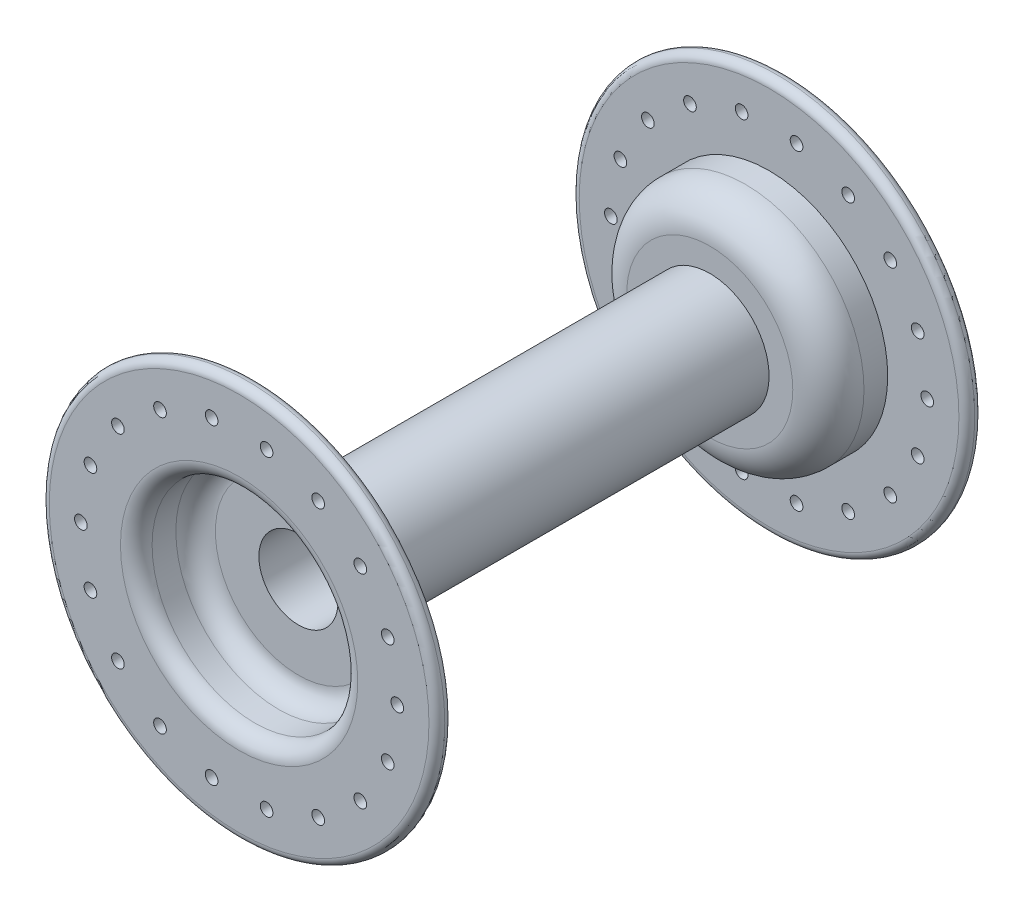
ISO-10303-21;
HEADER;
FILE_DESCRIPTION(('STEP AP214'),'2;1');
FILE_NAME('part.step','',(''),(''),'','','');
FILE_SCHEMA(('AUTOMOTIVE_DESIGN { 1 0 10303 214 1 1 1 1 }'));
ENDSEC;
DATA;
#1=APPLICATION_CONTEXT('core data for automotive mechanical design processes');
#2=APPLICATION_PROTOCOL_DEFINITION('international standard','automotive_design',2000,#1);
#3=PRODUCT_CONTEXT('',#1,'mechanical');
#4=PRODUCT('Part','Part','',(#3));
#5=PRODUCT_RELATED_PRODUCT_CATEGORY('part','',(#4));
#6=PRODUCT_DEFINITION_FORMATION('','',#4);
#7=PRODUCT_DEFINITION_CONTEXT('part definition',#1,'design');
#8=PRODUCT_DEFINITION('design','',#6,#7);
#9=PRODUCT_DEFINITION_SHAPE('','',#8);
#10=(LENGTH_UNIT() NAMED_UNIT(*) SI_UNIT(.MILLI.,.METRE.));
#11=(NAMED_UNIT(*) PLANE_ANGLE_UNIT() SI_UNIT($,.RADIAN.));
#12=(NAMED_UNIT(*) SI_UNIT($,.STERADIAN.) SOLID_ANGLE_UNIT());
#13=UNCERTAINTY_MEASURE_WITH_UNIT(LENGTH_MEASURE(1.E-05),#10,'distance_accuracy_value','');
#14=(GEOMETRIC_REPRESENTATION_CONTEXT(3) GLOBAL_UNCERTAINTY_ASSIGNED_CONTEXT((#13)) GLOBAL_UNIT_ASSIGNED_CONTEXT((#10,
#11,#12)) REPRESENTATION_CONTEXT('',''));
#15=CARTESIAN_POINT('',(0.,0.,0.));
#16=DIRECTION('',(0.,0.,1.));
#17=DIRECTION('',(1.,0.,0.));
#18=AXIS2_PLACEMENT_3D('',#15,#16,#17);
#19=CARTESIAN_POINT('',(2.22044604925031E-13,0.,-32.5));
#20=DIRECTION('',(0.,0.,-1.));
#21=DIRECTION('',(1.,0.,0.));
#22=AXIS2_PLACEMENT_3D('',#19,#20,#21);
#23=PLANE('',#22);
#24=CARTESIAN_POINT('',(15.3208888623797,12.8557521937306,-32.5));
#25=DIRECTION('',(0.,0.,-1.));
#26=DIRECTION('',(-1.,0.,0.));
#27=AXIS2_PLACEMENT_3D('',#24,#25,#26);
#28=CIRCLE('',#27,0.799999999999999);
#29=CARTESIAN_POINT('',(14.5208888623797,12.8557521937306,-32.5));
#30=VERTEX_POINT('',#29);
#31=EDGE_CURVE('E314',#30,#30,#28,.T.);
#32=ORIENTED_EDGE('',*,*,#31,.T.);
#33=EDGE_LOOP('',(#32));
#34=FACE_BOUND('',#33,.T.);
#35=CARTESIAN_POINT('',(3.47296355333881,19.6961550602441,-32.4999999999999));
#36=DIRECTION('',(0.,0.,-1.));
#37=DIRECTION('',(-1.,0.,0.));
#38=AXIS2_PLACEMENT_3D('',#35,#36,#37);
#39=CIRCLE('',#38,0.799999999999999);
#40=CARTESIAN_POINT('',(2.67296355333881,19.6961550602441,-32.4999999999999));
#41=VERTEX_POINT('',#40);
#42=EDGE_CURVE('E302',#41,#41,#39,.T.);
#43=ORIENTED_EDGE('',*,*,#42,.T.);
#44=EDGE_LOOP('',(#43));
#45=FACE_BOUND('',#44,.T.);
#46=CARTESIAN_POINT('',(-9.9999999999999,17.3205080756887,-32.5));
#47=DIRECTION('',(0.,0.,-1.));
#48=DIRECTION('',(-1.,0.,0.));
#49=AXIS2_PLACEMENT_3D('',#46,#47,#48);
#50=CIRCLE('',#49,0.799999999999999);
#51=CARTESIAN_POINT('',(-10.7999999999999,17.3205080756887,-32.5));
#52=VERTEX_POINT('',#51);
#53=EDGE_CURVE('E290',#52,#52,#50,.T.);
#54=ORIENTED_EDGE('',*,*,#53,.T.);
#55=EDGE_LOOP('',(#54));
#56=FACE_BOUND('',#55,.T.);
#57=CARTESIAN_POINT('',(-18.7938524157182,6.84040286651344,-32.5));
#58=DIRECTION('',(0.,0.,-1.));
#59=DIRECTION('',(-1.,0.,0.));
#60=AXIS2_PLACEMENT_3D('',#57,#58,#59);
#61=CIRCLE('',#60,0.799999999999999);
#62=CARTESIAN_POINT('',(-19.5938524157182,6.84040286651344,-32.5));
#63=VERTEX_POINT('',#62);
#64=EDGE_CURVE('E278',#63,#63,#61,.T.);
#65=ORIENTED_EDGE('',*,*,#64,.T.);
#66=EDGE_LOOP('',(#65));
#67=FACE_BOUND('',#66,.T.);
#68=CARTESIAN_POINT('',(-18.7938524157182,-6.84040286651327,-32.4999999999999));
#69=DIRECTION('',(0.,0.,-1.));
#70=DIRECTION('',(-1.,0.,0.));
#71=AXIS2_PLACEMENT_3D('',#68,#69,#70);
#72=CIRCLE('',#71,0.799999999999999);
#73=CARTESIAN_POINT('',(-19.5938524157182,-6.84040286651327,-32.4999999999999));
#74=VERTEX_POINT('',#73);
#75=EDGE_CURVE('E266',#74,#74,#72,.T.);
#76=ORIENTED_EDGE('',*,*,#75,.T.);
#77=EDGE_LOOP('',(#76));
#78=FACE_BOUND('',#77,.T.);
#79=CARTESIAN_POINT('',(-10.,-17.3205080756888,-32.5));
#80=DIRECTION('',(0.,0.,-1.));
#81=DIRECTION('',(-1.,0.,0.));
#82=AXIS2_PLACEMENT_3D('',#79,#80,#81);
#83=CIRCLE('',#82,0.799999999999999);
#84=CARTESIAN_POINT('',(-10.,-16.5205080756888,-32.5));
#85=VERTEX_POINT('',#84);
#86=EDGE_CURVE('E254',#85,#85,#83,.T.);
#87=ORIENTED_EDGE('',*,*,#86,.T.);
#88=EDGE_LOOP('',(#87));
#89=FACE_BOUND('',#88,.T.);
#90=CARTESIAN_POINT('',(3.47296355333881,-19.6961550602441,-32.5));
#91=DIRECTION('',(0.,0.,-1.));
#92=DIRECTION('',(-1.,0.,0.));
#93=AXIS2_PLACEMENT_3D('',#90,#91,#92);
#94=CIRCLE('',#93,0.799999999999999);
#95=CARTESIAN_POINT('',(3.47296355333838,-18.8961550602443,-32.5));
#96=VERTEX_POINT('',#95);
#97=EDGE_CURVE('E242',#96,#96,#94,.T.);
#98=ORIENTED_EDGE('',*,*,#97,.T.);
#99=EDGE_LOOP('',(#98));
#100=FACE_BOUND('',#99,.T.);
#101=CARTESIAN_POINT('',(15.3208888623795,-12.8557521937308,-32.5));
#102=DIRECTION('',(0.,0.,-1.));
#103=DIRECTION('',(-1.,0.,0.));
#104=AXIS2_PLACEMENT_3D('',#101,#102,#103);
#105=CIRCLE('',#104,0.799999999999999);
#106=CARTESIAN_POINT('',(14.5208888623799,-12.8557521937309,-32.5));
#107=VERTEX_POINT('',#106);
#108=EDGE_CURVE('E230',#107,#107,#105,.T.);
#109=ORIENTED_EDGE('',*,*,#108,.T.);
#110=EDGE_LOOP('',(#109));
#111=FACE_BOUND('',#110,.T.);
#112=CARTESIAN_POINT('',(20.0000000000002,0.,-32.5));
#113=DIRECTION('',(0.,0.,-1.));
#114=DIRECTION('',(-1.,0.,0.));
#115=AXIS2_PLACEMENT_3D('',#112,#113,#114);
#116=CIRCLE('',#115,0.799999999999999);
#117=CARTESIAN_POINT('',(19.2000000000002,0.,-32.5));
#118=VERTEX_POINT('',#117);
#119=EDGE_CURVE('E218',#118,#118,#116,.T.);
#120=ORIENTED_EDGE('',*,*,#119,.T.);
#121=EDGE_LOOP('',(#120));
#122=FACE_BOUND('',#121,.T.);
#123=CARTESIAN_POINT('',(2.22044604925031E-13,0.,-32.5));
#124=DIRECTION('',(0.,0.,-1.));
#125=DIRECTION('',(-1.,0.,0.));
#126=AXIS2_PLACEMENT_3D('',#123,#124,#125);
#127=CIRCLE('',#126,24.);
#128=CARTESIAN_POINT('',(-23.9999999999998,0.,-32.5));
#129=VERTEX_POINT('',#128);
#130=EDGE_CURVE('E63',#129,#129,#127,.F.);
#131=ORIENTED_EDGE('',*,*,#130,.T.);
#132=EDGE_LOOP('',(#131));
#133=FACE_BOUND('',#132,.T.);
#134=CARTESIAN_POINT('',(2.22044604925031E-13,0.,-32.5));
#135=DIRECTION('',(0.,0.,-1.));
#136=DIRECTION('',(-1.,0.,0.));
#137=AXIS2_PLACEMENT_3D('',#134,#135,#136);
#138=CIRCLE('',#137,15.);
#139=CARTESIAN_POINT('',(-14.9999999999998,0.,-32.5));
#140=VERTEX_POINT('',#139);
#141=EDGE_CURVE('E59',#140,#140,#138,.T.);
#142=ORIENTED_EDGE('',*,*,#141,.T.);
#143=EDGE_LOOP('',(#142));
#144=FACE_BOUND('',#143,.T.);
#145=CARTESIAN_POINT('',(18.7938524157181,-6.84040286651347,-32.4999999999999));
#146=DIRECTION('',(0.,0.,-1.));
#147=DIRECTION('',(-1.,0.,0.));
#148=AXIS2_PLACEMENT_3D('',#145,#146,#147);
#149=CIRCLE('',#148,0.799999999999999);
#150=CARTESIAN_POINT('',(17.9938524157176,-6.84040286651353,-32.4999999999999));
#151=VERTEX_POINT('',#150);
#152=EDGE_CURVE('E224',#151,#151,#149,.T.);
#153=ORIENTED_EDGE('',*,*,#152,.T.);
#154=EDGE_LOOP('',(#153));
#155=FACE_BOUND('',#154,.T.);
#156=CARTESIAN_POINT('',(10.,-17.3205080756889,-32.4999999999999));
#157=DIRECTION('',(0.,0.,-1.));
#158=DIRECTION('',(-1.,0.,0.));
#159=AXIS2_PLACEMENT_3D('',#156,#157,#158);
#160=CIRCLE('',#159,0.799999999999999);
#161=CARTESIAN_POINT('',(10.,-16.5205080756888,-32.4999999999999));
#162=VERTEX_POINT('',#161);
#163=EDGE_CURVE('E236',#162,#162,#160,.T.);
#164=ORIENTED_EDGE('',*,*,#163,.T.);
#165=EDGE_LOOP('',(#164));
#166=FACE_BOUND('',#165,.T.);
#167=CARTESIAN_POINT('',(-3.47296355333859,-19.6961550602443,-32.4999999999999));
#168=DIRECTION('',(0.,0.,-1.));
#169=DIRECTION('',(-1.,0.,0.));
#170=AXIS2_PLACEMENT_3D('',#167,#168,#169);
#171=CIRCLE('',#170,0.799999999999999);
#172=CARTESIAN_POINT('',(-3.47296355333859,-18.8961550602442,-32.4999999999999));
#173=VERTEX_POINT('',#172);
#174=EDGE_CURVE('E248',#173,#173,#171,.T.);
#175=ORIENTED_EDGE('',*,*,#174,.T.);
#176=EDGE_LOOP('',(#175));
#177=FACE_BOUND('',#176,.T.);
#178=CARTESIAN_POINT('',(-15.3208888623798,-12.8557521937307,-32.4999999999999));
#179=DIRECTION('',(0.,0.,-1.));
#180=DIRECTION('',(-1.,0.,0.));
#181=AXIS2_PLACEMENT_3D('',#178,#179,#180);
#182=CIRCLE('',#181,0.799999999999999);
#183=CARTESIAN_POINT('',(-16.1208888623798,-12.8557521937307,-32.4999999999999));
#184=VERTEX_POINT('',#183);
#185=EDGE_CURVE('E260',#184,#184,#182,.T.);
#186=ORIENTED_EDGE('',*,*,#185,.T.);
#187=EDGE_LOOP('',(#186));
#188=FACE_BOUND('',#187,.T.);
#189=CARTESIAN_POINT('',(-20.0000000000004,0.,-32.4999999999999));
#190=DIRECTION('',(0.,0.,-1.));
#191=DIRECTION('',(-1.,0.,0.));
#192=AXIS2_PLACEMENT_3D('',#189,#190,#191);
#193=CIRCLE('',#192,0.799999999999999);
#194=CARTESIAN_POINT('',(-20.8000000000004,0.,-32.4999999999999));
#195=VERTEX_POINT('',#194);
#196=EDGE_CURVE('E272',#195,#195,#193,.T.);
#197=ORIENTED_EDGE('',*,*,#196,.T.);
#198=EDGE_LOOP('',(#197));
#199=FACE_BOUND('',#198,.T.);
#200=CARTESIAN_POINT('',(-15.3208888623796,12.8557521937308,-32.4999999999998));
#201=DIRECTION('',(0.,0.,-1.));
#202=DIRECTION('',(-1.,0.,0.));
#203=AXIS2_PLACEMENT_3D('',#200,#201,#202);
#204=CIRCLE('',#203,0.799999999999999);
#205=CARTESIAN_POINT('',(-16.1208888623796,12.8557521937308,-32.4999999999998));
#206=VERTEX_POINT('',#205);
#207=EDGE_CURVE('E284',#206,#206,#204,.T.);
#208=ORIENTED_EDGE('',*,*,#207,.T.);
#209=EDGE_LOOP('',(#208));
#210=FACE_BOUND('',#209,.T.);
#211=CARTESIAN_POINT('',(-3.47296355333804,19.6961550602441,-32.4999999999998));
#212=DIRECTION('',(0.,0.,-1.));
#213=DIRECTION('',(-1.,0.,0.));
#214=AXIS2_PLACEMENT_3D('',#211,#212,#213);
#215=CIRCLE('',#214,0.799999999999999);
#216=CARTESIAN_POINT('',(-4.27296355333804,19.6961550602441,-32.4999999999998));
#217=VERTEX_POINT('',#216);
#218=EDGE_CURVE('E296',#217,#217,#215,.T.);
#219=ORIENTED_EDGE('',*,*,#218,.T.);
#220=EDGE_LOOP('',(#219));
#221=FACE_BOUND('',#220,.T.);
#222=CARTESIAN_POINT('',(9.99999999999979,17.3205080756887,-32.4999999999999));
#223=DIRECTION('',(0.,0.,-1.));
#224=DIRECTION('',(-1.,0.,0.));
#225=AXIS2_PLACEMENT_3D('',#222,#223,#224);
#226=CIRCLE('',#225,0.799999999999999);
#227=CARTESIAN_POINT('',(9.19999999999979,17.3205080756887,-32.4999999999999));
#228=VERTEX_POINT('',#227);
#229=EDGE_CURVE('E308',#228,#228,#226,.T.);
#230=ORIENTED_EDGE('',*,*,#229,.T.);
#231=EDGE_LOOP('',(#230));
#232=FACE_BOUND('',#231,.T.);
#233=CARTESIAN_POINT('',(18.7938524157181,6.84040286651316,-32.5));
#234=DIRECTION('',(0.,0.,-1.));
#235=DIRECTION('',(-1.,0.,0.));
#236=AXIS2_PLACEMENT_3D('',#233,#234,#235);
#237=CIRCLE('',#236,0.799999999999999);
#238=CARTESIAN_POINT('',(17.9938524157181,6.84040286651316,-32.5));
#239=VERTEX_POINT('',#238);
#240=EDGE_CURVE('E320',#239,#239,#237,.T.);
#241=ORIENTED_EDGE('',*,*,#240,.T.);
#242=EDGE_LOOP('',(#241));
#243=FACE_BOUND('',#242,.T.);
#244=ADVANCED_FACE('F31',(#34,#45,#56,#67,#78,#89,#100,#111,#122,#133,#144,#155,#166,#177,#188,
#199,#210,#221,#232,#243),#23,.F.);
#245=CARTESIAN_POINT('',(2.22044604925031E-13,0.,-34.5));
#246=DIRECTION('',(0.,0.,-1.));
#247=DIRECTION('',(1.,0.,0.));
#248=AXIS2_PLACEMENT_3D('',#245,#246,#247);
#249=PLANE('',#248);
#250=CARTESIAN_POINT('',(2.22044604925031E-13,0.,-34.5));
#251=DIRECTION('',(0.,0.,-1.));
#252=DIRECTION('',(-1.,0.,0.));
#253=AXIS2_PLACEMENT_3D('',#250,#251,#252);
#254=CIRCLE('',#253,15.);
#255=CARTESIAN_POINT('',(-14.9999999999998,0.,-34.5));
#256=VERTEX_POINT('',#255);
#257=EDGE_CURVE('E46',#256,#256,#254,.F.);
#258=ORIENTED_EDGE('',*,*,#257,.T.);
#259=EDGE_LOOP('',(#258));
#260=FACE_BOUND('',#259,.T.);
#261=CARTESIAN_POINT('',(15.3208888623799,12.8557521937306,-34.5000000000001));
#262=DIRECTION('',(0.,0.,1.));
#263=DIRECTION('',(0.766044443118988,0.64278760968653,0.));
#264=AXIS2_PLACEMENT_3D('',#261,#262,#263);
#265=CIRCLE('',#264,0.799999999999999);
#266=CARTESIAN_POINT('',(15.9337244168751,13.3699822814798,-34.5000000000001));
#267=VERTEX_POINT('',#266);
#268=EDGE_CURVE('E311',#267,#267,#265,.T.);
#269=ORIENTED_EDGE('',*,*,#268,.T.);
#270=EDGE_LOOP('',(#269));
#271=FACE_BOUND('',#270,.T.);
#272=CARTESIAN_POINT('',(3.47296355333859,19.6961550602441,-34.5));
#273=DIRECTION('',(0.,0.,1.));
#274=DIRECTION('',(0.173648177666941,0.984807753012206,0.));
#275=AXIS2_PLACEMENT_3D('',#272,#273,#274);
#276=CIRCLE('',#275,0.799999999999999);
#277=CARTESIAN_POINT('',(3.61188209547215,20.4840012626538,-34.5));
#278=VERTEX_POINT('',#277);
#279=EDGE_CURVE('E299',#278,#278,#276,.T.);
#280=ORIENTED_EDGE('',*,*,#279,.T.);
#281=EDGE_LOOP('',(#280));
#282=FACE_BOUND('',#281,.T.);
#283=CARTESIAN_POINT('',(-9.99999999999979,17.3205080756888,-34.5));
#284=DIRECTION('',(0.,0.,1.));
#285=DIRECTION('',(-0.499999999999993,0.866025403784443,0.));
#286=AXIS2_PLACEMENT_3D('',#283,#284,#285);
#287=CIRCLE('',#286,0.799999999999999);
#288=CARTESIAN_POINT('',(-10.3999999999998,18.0133283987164,-34.5));
#289=VERTEX_POINT('',#288);
#290=EDGE_CURVE('E287',#289,#289,#287,.T.);
#291=ORIENTED_EDGE('',*,*,#290,.T.);
#292=EDGE_LOOP('',(#291));
#293=FACE_BOUND('',#292,.T.);
#294=CARTESIAN_POINT('',(-18.7938524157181,6.84040286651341,-34.4999999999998));
#295=DIRECTION('',(0.,0.,1.));
#296=DIRECTION('',(-0.939692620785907,0.342020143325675,0.));
#297=AXIS2_PLACEMENT_3D('',#294,#295,#296);
#298=CIRCLE('',#297,0.799999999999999);
#299=CARTESIAN_POINT('',(-19.5456065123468,7.11401898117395,-34.4999999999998));
#300=VERTEX_POINT('',#299);
#301=EDGE_CURVE('E275',#300,#300,#298,.T.);
#302=ORIENTED_EDGE('',*,*,#301,.T.);
#303=EDGE_LOOP('',(#302));
#304=FACE_BOUND('',#303,.T.);
#305=CARTESIAN_POINT('',(-18.7938524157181,-6.84040286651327,-34.5));
#306=DIRECTION('',(0.,0.,1.));
#307=DIRECTION('',(-0.939692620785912,-0.342020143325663,0.));
#308=AXIS2_PLACEMENT_3D('',#305,#306,#307);
#309=CIRCLE('',#308,0.799999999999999);
#310=CARTESIAN_POINT('',(-19.5456065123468,-7.1140189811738,-34.5));
#311=VERTEX_POINT('',#310);
#312=EDGE_CURVE('E263',#311,#311,#309,.T.);
#313=ORIENTED_EDGE('',*,*,#312,.T.);
#314=EDGE_LOOP('',(#313));
#315=FACE_BOUND('',#314,.T.);
#316=CARTESIAN_POINT('',(-10.0000000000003,-17.3205080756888,-34.4999999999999));
#317=DIRECTION('',(0.,0.,1.));
#318=DIRECTION('',(-0.500000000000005,-0.866025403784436,0.));
#319=AXIS2_PLACEMENT_3D('',#316,#317,#318);
#320=CIRCLE('',#319,0.799999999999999);
#321=CARTESIAN_POINT('',(-10.,-16.5205080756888,-34.4999999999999));
#322=VERTEX_POINT('',#321);
#323=EDGE_CURVE('E251',#322,#322,#320,.T.);
#324=ORIENTED_EDGE('',*,*,#323,.T.);
#325=EDGE_LOOP('',(#324));
#326=FACE_BOUND('',#325,.T.);
#327=CARTESIAN_POINT('',(3.47296355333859,-19.6961550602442,-34.4999999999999));
#328=DIRECTION('',(0.,0.,1.));
#329=DIRECTION('',(0.173648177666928,-0.984807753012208,0.));
#330=AXIS2_PLACEMENT_3D('',#327,#328,#329);
#331=CIRCLE('',#330,0.799999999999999);
#332=CARTESIAN_POINT('',(3.47296355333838,-18.8961550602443,-34.4999999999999));
#333=VERTEX_POINT('',#332);
#334=EDGE_CURVE('E239',#333,#333,#331,.T.);
#335=ORIENTED_EDGE('',*,*,#334,.T.);
#336=EDGE_LOOP('',(#335));
#337=FACE_BOUND('',#336,.T.);
#338=CARTESIAN_POINT('',(15.3208888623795,-12.8557521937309,-34.4999999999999));
#339=DIRECTION('',(0.,0.,1.));
#340=DIRECTION('',(0.766044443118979,-0.64278760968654,0.));
#341=AXIS2_PLACEMENT_3D('',#338,#339,#340);
#342=CIRCLE('',#341,0.799999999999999);
#343=CARTESIAN_POINT('',(14.5208888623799,-12.8557521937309,-34.4999999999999));
#344=VERTEX_POINT('',#343);
#345=EDGE_CURVE('E227',#344,#344,#342,.T.);
#346=ORIENTED_EDGE('',*,*,#345,.T.);
#347=EDGE_LOOP('',(#346));
#348=FACE_BOUND('',#347,.T.);
#349=CARTESIAN_POINT('',(20.0000000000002,-1.38777878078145E-13,-34.5));
#350=DIRECTION('',(0.,0.,1.));
#351=DIRECTION('',(1.,0.,0.));
#352=AXIS2_PLACEMENT_3D('',#349,#350,#351);
#353=CIRCLE('',#352,0.799999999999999);
#354=CARTESIAN_POINT('',(20.8000000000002,-1.38772189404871E-13,-34.5));
#355=VERTEX_POINT('',#354);
#356=EDGE_CURVE('E60',#355,#355,#353,.T.);
#357=ORIENTED_EDGE('',*,*,#356,.T.);
#358=EDGE_LOOP('',(#357));
#359=FACE_BOUND('',#358,.T.);
#360=CARTESIAN_POINT('',(2.22044604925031E-13,0.,-34.5));
#361=DIRECTION('',(0.,0.,-1.));
#362=DIRECTION('',(-1.,0.,0.));
#363=AXIS2_PLACEMENT_3D('',#360,#361,#362);
#364=CIRCLE('',#363,24.);
#365=CARTESIAN_POINT('',(-23.9999999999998,0.,-34.5));
#366=VERTEX_POINT('',#365);
#367=EDGE_CURVE('E51',#366,#366,#364,.T.);
#368=ORIENTED_EDGE('',*,*,#367,.T.);
#369=EDGE_LOOP('',(#368));
#370=FACE_BOUND('',#369,.T.);
#371=CARTESIAN_POINT('',(18.7938524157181,-6.84040286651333,-34.4999999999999));
#372=DIRECTION('',(0.,0.,1.));
#373=DIRECTION('',(0.93969262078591,-0.342020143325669,0.));
#374=AXIS2_PLACEMENT_3D('',#371,#372,#373);
#375=CIRCLE('',#374,0.799999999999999);
#376=CARTESIAN_POINT('',(17.9938524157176,-6.84040286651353,-34.4999999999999));
#377=VERTEX_POINT('',#376);
#378=EDGE_CURVE('E221',#377,#377,#375,.T.);
#379=ORIENTED_EDGE('',*,*,#378,.T.);
#380=EDGE_LOOP('',(#379));
#381=FACE_BOUND('',#380,.T.);
#382=CARTESIAN_POINT('',(10.,-17.3205080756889,-34.4999999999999));
#383=DIRECTION('',(0.,0.,1.));
#384=DIRECTION('',(0.499999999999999,-0.86602540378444,0.));
#385=AXIS2_PLACEMENT_3D('',#382,#383,#384);
#386=CIRCLE('',#385,0.799999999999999);
#387=CARTESIAN_POINT('',(10.,-16.5205080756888,-34.4999999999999));
#388=VERTEX_POINT('',#387);
#389=EDGE_CURVE('E233',#388,#388,#386,.T.);
#390=ORIENTED_EDGE('',*,*,#389,.T.);
#391=EDGE_LOOP('',(#390));
#392=FACE_BOUND('',#391,.T.);
#393=CARTESIAN_POINT('',(-3.47296355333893,-19.6961550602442,-34.5));
#394=DIRECTION('',(0.,0.,1.));
#395=DIRECTION('',(-0.173648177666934,-0.984807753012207,0.));
#396=AXIS2_PLACEMENT_3D('',#393,#394,#395);
#397=CIRCLE('',#396,0.799999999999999);
#398=CARTESIAN_POINT('',(-3.47296355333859,-18.8961550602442,-34.5));
#399=VERTEX_POINT('',#398);
#400=EDGE_CURVE('E245',#399,#399,#397,.T.);
#401=ORIENTED_EDGE('',*,*,#400,.T.);
#402=EDGE_LOOP('',(#401));
#403=FACE_BOUND('',#402,.T.);
#404=CARTESIAN_POINT('',(-15.3208888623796,-12.8557521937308,-34.4999999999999));
#405=DIRECTION('',(0.,0.,1.));
#406=DIRECTION('',(-0.766044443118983,-0.642787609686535,0.));
#407=AXIS2_PLACEMENT_3D('',#404,#405,#406);
#408=CIRCLE('',#407,0.799999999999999);
#409=CARTESIAN_POINT('',(-15.9337244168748,-13.3699822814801,-34.4999999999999));
#410=VERTEX_POINT('',#409);
#411=EDGE_CURVE('E257',#410,#410,#408,.T.);
#412=ORIENTED_EDGE('',*,*,#411,.T.);
#413=EDGE_LOOP('',(#412));
#414=FACE_BOUND('',#413,.T.);
#415=CARTESIAN_POINT('',(-20.,0.,-34.5));
#416=DIRECTION('',(0.,0.,1.));
#417=DIRECTION('',(-1.,0.,0.));
#418=AXIS2_PLACEMENT_3D('',#415,#416,#417);
#419=CIRCLE('',#418,0.799999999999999);
#420=CARTESIAN_POINT('',(-20.8,0.,-34.5));
#421=VERTEX_POINT('',#420);
#422=EDGE_CURVE('E269',#421,#421,#419,.T.);
#423=ORIENTED_EDGE('',*,*,#422,.T.);
#424=EDGE_LOOP('',(#423));
#425=FACE_BOUND('',#424,.T.);
#426=CARTESIAN_POINT('',(-15.3208888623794,12.8557521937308,-34.4999999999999));
#427=DIRECTION('',(0.,0.,1.));
#428=DIRECTION('',(-0.766044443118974,0.642787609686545,0.));
#429=AXIS2_PLACEMENT_3D('',#426,#427,#428);
#430=CIRCLE('',#429,0.799999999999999);
#431=CARTESIAN_POINT('',(-15.9337244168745,13.36998228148,-34.4999999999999));
#432=VERTEX_POINT('',#431);
#433=EDGE_CURVE('E281',#432,#432,#430,.T.);
#434=ORIENTED_EDGE('',*,*,#433,.T.);
#435=EDGE_LOOP('',(#434));
#436=FACE_BOUND('',#435,.T.);
#437=CARTESIAN_POINT('',(-3.47296355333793,19.6961550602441,-34.5000000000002));
#438=DIRECTION('',(0.,0.,1.));
#439=DIRECTION('',(-0.173648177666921,0.984807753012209,0.));
#440=AXIS2_PLACEMENT_3D('',#437,#438,#439);
#441=CIRCLE('',#440,0.799999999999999);
#442=CARTESIAN_POINT('',(-3.61188209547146,20.4840012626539,-34.5000000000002));
#443=VERTEX_POINT('',#442);
#444=EDGE_CURVE('E293',#443,#443,#441,.T.);
#445=ORIENTED_EDGE('',*,*,#444,.T.);
#446=EDGE_LOOP('',(#445));
#447=FACE_BOUND('',#446,.T.);
#448=CARTESIAN_POINT('',(10.0000000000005,17.3205080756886,-34.4999999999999));
#449=DIRECTION('',(0.,0.,1.));
#450=DIRECTION('',(0.500000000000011,0.866025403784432,0.));
#451=AXIS2_PLACEMENT_3D('',#448,#449,#450);
#452=CIRCLE('',#451,0.799999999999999);
#453=CARTESIAN_POINT('',(10.4000000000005,18.0133283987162,-34.4999999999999));
#454=VERTEX_POINT('',#453);
#455=EDGE_CURVE('E305',#454,#454,#452,.T.);
#456=ORIENTED_EDGE('',*,*,#455,.T.);
#457=EDGE_LOOP('',(#456));
#458=FACE_BOUND('',#457,.T.);
#459=CARTESIAN_POINT('',(18.7938524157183,6.84040286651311,-34.5));
#460=DIRECTION('',(0.,0.,1.));
#461=DIRECTION('',(0.939692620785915,0.342020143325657,0.));
#462=AXIS2_PLACEMENT_3D('',#459,#460,#461);
#463=CIRCLE('',#462,0.799999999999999);
#464=CARTESIAN_POINT('',(19.545606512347,7.11401898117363,-34.5));
#465=VERTEX_POINT('',#464);
#466=EDGE_CURVE('E317',#465,#465,#463,.T.);
#467=ORIENTED_EDGE('',*,*,#466,.T.);
#468=EDGE_LOOP('',(#467));
#469=FACE_BOUND('',#468,.T.);
#470=ADVANCED_FACE('F347',(#260,#271,#282,#293,#304,#315,#326,#337,#348,#359,#370,#381,#392,
#403,#414,#425,#436,#447,#458,#469),#249,.T.);
#471=CARTESIAN_POINT('',(0.,0.,25.));
#472=DIRECTION('',(0.,0.,-1.));
#473=DIRECTION('',(-1.,0.,0.));
#474=AXIS2_PLACEMENT_3D('',#471,#472,#473);
#475=CYLINDRICAL_SURFACE('',#474,7.5);
#476=CARTESIAN_POINT('',(0.,0.,25.));
#477=DIRECTION('',(0.,0.,1.));
#478=DIRECTION('',(1.,0.,0.));
#479=AXIS2_PLACEMENT_3D('',#476,#477,#478);
#480=CIRCLE('',#479,7.5);
#481=CARTESIAN_POINT('',(7.50000000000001,0.,25.));
#482=VERTEX_POINT('',#481);
#483=EDGE_CURVE('E77',#482,#482,#480,.T.);
#484=ORIENTED_EDGE('',*,*,#483,.F.);
#485=EDGE_LOOP('',(#484));
#486=FACE_BOUND('',#485,.T.);
#487=CARTESIAN_POINT('',(0.,0.,-25.0000000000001));
#488=DIRECTION('',(0.,0.,-1.));
#489=DIRECTION('',(-1.,0.,0.));
#490=AXIS2_PLACEMENT_3D('',#487,#488,#489);
#491=CIRCLE('',#490,7.5);
#492=CARTESIAN_POINT('',(-7.50000000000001,0.,-25.0000000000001));
#493=VERTEX_POINT('',#492);
#494=EDGE_CURVE('E201',#493,#493,#491,.T.);
#495=ORIENTED_EDGE('',*,*,#494,.F.);
#496=EDGE_LOOP('',(#495));
#497=FACE_BOUND('',#496,.T.);
#498=ADVANCED_FACE('F353',(#486,#497),#475,.T.);
#499=CARTESIAN_POINT('',(0.,0.,25.));
#500=DIRECTION('',(0.,0.,1.));
#501=DIRECTION('',(1.,0.,0.));
#502=AXIS2_PLACEMENT_3D('',#499,#500,#501);
#503=PLANE('',#502);
#504=CARTESIAN_POINT('',(0.,0.,25.));
#505=DIRECTION('',(0.,0.,1.));
#506=DIRECTION('',(1.,0.,0.));
#507=AXIS2_PLACEMENT_3D('',#504,#505,#506);
#508=CIRCLE('',#507,10.5);
#509=CARTESIAN_POINT('',(10.5,0.,25.));
#510=VERTEX_POINT('',#509);
#511=EDGE_CURVE('E86',#510,#510,#508,.T.);
#512=ORIENTED_EDGE('',*,*,#511,.F.);
#513=EDGE_LOOP('',(#512));
#514=FACE_BOUND('',#513,.T.);
#515=ORIENTED_EDGE('',*,*,#483,.T.);
#516=EDGE_LOOP('',(#515));
#517=FACE_BOUND('',#516,.T.);
#518=ADVANCED_FACE('F475',(#514,#517),#503,.F.);
#519=CARTESIAN_POINT('',(0.,0.,25.));
#520=DIRECTION('',(0.,0.,1.));
#521=DIRECTION('',(1.,0.,0.));
#522=AXIS2_PLACEMENT_3D('',#519,#520,#521);
#523=CYLINDRICAL_SURFACE('',#522,15.);
#524=CARTESIAN_POINT('',(0.,0.,32.4999999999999));
#525=DIRECTION('',(0.,0.,1.));
#526=DIRECTION('',(1.,0.,0.));
#527=AXIS2_PLACEMENT_3D('',#524,#525,#526);
#528=CIRCLE('',#527,15.);
#529=CARTESIAN_POINT('',(15.,0.,32.4999999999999));
#530=VERTEX_POINT('',#529);
#531=EDGE_CURVE('E80',#530,#530,#528,.T.);
#532=ORIENTED_EDGE('',*,*,#531,.F.);
#533=EDGE_LOOP('',(#532));
#534=FACE_BOUND('',#533,.T.);
#535=CARTESIAN_POINT('',(0.,-1.38777878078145E-13,29.5));
#536=DIRECTION('',(0.,0.,1.));
#537=DIRECTION('',(1.,0.,0.));
#538=AXIS2_PLACEMENT_3D('',#535,#536,#537);
#539=CIRCLE('',#538,15.);
#540=CARTESIAN_POINT('',(15.,-1.38671215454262E-13,29.5));
#541=VERTEX_POINT('',#540);
#542=EDGE_CURVE('E83',#541,#541,#539,.T.);
#543=ORIENTED_EDGE('',*,*,#542,.T.);
#544=EDGE_LOOP('',(#543));
#545=FACE_BOUND('',#544,.T.);
#546=ADVANCED_FACE('F478',(#534,#545),#523,.T.);
#547=CARTESIAN_POINT('',(0.,-1.38777878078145E-13,29.5));
#548=DIRECTION('',(0.,0.,1.));
#549=DIRECTION('',(1.,0.,0.));
#550=AXIS2_PLACEMENT_3D('',#547,#548,#549);
#551=TOROIDAL_SURFACE('',#550,10.5,4.5);
#552=ORIENTED_EDGE('',*,*,#542,.F.);
#553=EDGE_LOOP('',(#552));
#554=FACE_BOUND('',#553,.T.);
#555=ORIENTED_EDGE('',*,*,#511,.T.);
#556=EDGE_LOOP('',(#555));
#557=FACE_BOUND('',#556,.T.);
#558=ADVANCED_FACE('F463',(#554,#557),#551,.T.);
#559=CARTESIAN_POINT('',(0.,0.,32.4999999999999));
#560=DIRECTION('',(0.,0.,1.));
#561=DIRECTION('',(1.,0.,0.));
#562=AXIS2_PLACEMENT_3D('',#559,#560,#561);
#563=PLANE('',#562);
#564=CARTESIAN_POINT('',(18.7938524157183,6.84040286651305,32.5));
#565=DIRECTION('',(0.,0.,1.));
#566=DIRECTION('',(1.,0.,0.));
#567=AXIS2_PLACEMENT_3D('',#564,#565,#566);
#568=CIRCLE('',#567,0.799999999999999);
#569=CARTESIAN_POINT('',(19.5938524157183,6.84040286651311,32.5));
#570=VERTEX_POINT('',#569);
#571=EDGE_CURVE('E195',#570,#570,#568,.F.);
#572=ORIENTED_EDGE('',*,*,#571,.F.);
#573=EDGE_LOOP('',(#572));
#574=FACE_BOUND('',#573,.T.);
#575=CARTESIAN_POINT('',(15.3208888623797,12.8557521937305,32.5));
#576=DIRECTION('',(0.,0.,1.));
#577=DIRECTION('',(1.,0.,0.));
#578=AXIS2_PLACEMENT_3D('',#575,#576,#577);
#579=CIRCLE('',#578,0.799999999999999);
#580=CARTESIAN_POINT('',(16.1208888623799,12.8557521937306,32.5));
#581=VERTEX_POINT('',#580);
#582=EDGE_CURVE('E189',#581,#581,#579,.F.);
#583=ORIENTED_EDGE('',*,*,#582,.F.);
#584=EDGE_LOOP('',(#583));
#585=FACE_BOUND('',#584,.T.);
#586=CARTESIAN_POINT('',(10.,17.3205080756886,32.5));
#587=DIRECTION('',(0.,0.,1.));
#588=DIRECTION('',(1.,0.,0.));
#589=AXIS2_PLACEMENT_3D('',#586,#587,#588);
#590=CIRCLE('',#589,0.799999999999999);
#591=CARTESIAN_POINT('',(10.8000000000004,17.3205080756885,32.5));
#592=VERTEX_POINT('',#591);
#593=EDGE_CURVE('E183',#592,#592,#590,.F.);
#594=ORIENTED_EDGE('',*,*,#593,.F.);
#595=EDGE_LOOP('',(#594));
#596=FACE_BOUND('',#595,.T.);
#597=CARTESIAN_POINT('',(3.47296355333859,19.696155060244,32.5000000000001));
#598=DIRECTION('',(0.,0.,1.));
#599=DIRECTION('',(1.,0.,0.));
#600=AXIS2_PLACEMENT_3D('',#597,#598,#599);
#601=CIRCLE('',#600,0.799999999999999);
#602=CARTESIAN_POINT('',(4.2729635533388,19.696155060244,32.5000000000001));
#603=VERTEX_POINT('',#602);
#604=EDGE_CURVE('E177',#603,#603,#601,.F.);
#605=ORIENTED_EDGE('',*,*,#604,.F.);
#606=EDGE_LOOP('',(#605));
#607=FACE_BOUND('',#606,.T.);
#608=CARTESIAN_POINT('',(-3.47296355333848,19.6961550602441,32.5));
#609=DIRECTION('',(0.,0.,1.));
#610=DIRECTION('',(1.,0.,0.));
#611=AXIS2_PLACEMENT_3D('',#608,#609,#610);
#612=CIRCLE('',#611,0.799999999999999);
#613=CARTESIAN_POINT('',(-2.67296355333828,19.696155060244,32.5));
#614=VERTEX_POINT('',#613);
#615=EDGE_CURVE('E171',#614,#614,#612,.F.);
#616=ORIENTED_EDGE('',*,*,#615,.F.);
#617=EDGE_LOOP('',(#616));
#618=FACE_BOUND('',#617,.T.);
#619=CARTESIAN_POINT('',(-10.,17.3205080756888,32.4999999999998));
#620=DIRECTION('',(0.,0.,1.));
#621=DIRECTION('',(1.,0.,0.));
#622=AXIS2_PLACEMENT_3D('',#619,#620,#621);
#623=CIRCLE('',#622,0.799999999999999);
#624=CARTESIAN_POINT('',(-9.1999999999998,17.3205080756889,32.4999999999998));
#625=VERTEX_POINT('',#624);
#626=EDGE_CURVE('E165',#625,#625,#623,.F.);
#627=ORIENTED_EDGE('',*,*,#626,.F.);
#628=EDGE_LOOP('',(#627));
#629=FACE_BOUND('',#628,.T.);
#630=CARTESIAN_POINT('',(-15.3208888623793,12.8557521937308,32.4999999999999));
#631=DIRECTION('',(0.,0.,1.));
#632=DIRECTION('',(1.,0.,0.));
#633=AXIS2_PLACEMENT_3D('',#630,#631,#632);
#634=CIRCLE('',#633,0.799999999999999);
#635=CARTESIAN_POINT('',(-15.3208888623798,12.0557521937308,32.4999999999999));
#636=VERTEX_POINT('',#635);
#637=EDGE_CURVE('E159',#636,#636,#634,.F.);
#638=ORIENTED_EDGE('',*,*,#637,.F.);
#639=EDGE_LOOP('',(#638));
#640=FACE_BOUND('',#639,.T.);
#641=CARTESIAN_POINT('',(-18.793852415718,6.84040286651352,32.4999999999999));
#642=DIRECTION('',(0.,0.,1.));
#643=DIRECTION('',(1.,0.,0.));
#644=AXIS2_PLACEMENT_3D('',#641,#642,#643);
#645=CIRCLE('',#644,0.799999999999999);
#646=CARTESIAN_POINT('',(-18.7938524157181,6.04040286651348,32.4999999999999));
#647=VERTEX_POINT('',#646);
#648=EDGE_CURVE('E153',#647,#647,#645,.F.);
#649=ORIENTED_EDGE('',*,*,#648,.F.);
#650=EDGE_LOOP('',(#649));
#651=FACE_BOUND('',#650,.T.);
#652=CARTESIAN_POINT('',(-20.0000000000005,0.,32.5000000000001));
#653=DIRECTION('',(0.,0.,1.));
#654=DIRECTION('',(1.,0.,0.));
#655=AXIS2_PLACEMENT_3D('',#652,#653,#654);
#656=CIRCLE('',#655,0.799999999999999);
#657=CARTESIAN_POINT('',(-20.0000000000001,-0.800000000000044,32.5000000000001));
#658=VERTEX_POINT('',#657);
#659=EDGE_CURVE('E147',#658,#658,#656,.F.);
#660=ORIENTED_EDGE('',*,*,#659,.F.);
#661=EDGE_LOOP('',(#660));
#662=FACE_BOUND('',#661,.T.);
#663=CARTESIAN_POINT('',(-18.7938524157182,-6.84040286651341,32.5));
#664=DIRECTION('',(0.,0.,1.));
#665=DIRECTION('',(1.,0.,0.));
#666=AXIS2_PLACEMENT_3D('',#663,#664,#665);
#667=CIRCLE('',#666,0.799999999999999);
#668=CARTESIAN_POINT('',(-18.793852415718,-7.64040286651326,32.5));
#669=VERTEX_POINT('',#668);
#670=EDGE_CURVE('E141',#669,#669,#667,.F.);
#671=ORIENTED_EDGE('',*,*,#670,.F.);
#672=EDGE_LOOP('',(#671));
#673=FACE_BOUND('',#672,.T.);
#674=CARTESIAN_POINT('',(-15.3208888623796,-12.8557521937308,32.5000000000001));
#675=DIRECTION('',(0.,0.,1.));
#676=DIRECTION('',(1.,0.,0.));
#677=AXIS2_PLACEMENT_3D('',#674,#675,#676);
#678=CIRCLE('',#677,0.799999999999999);
#679=CARTESIAN_POINT('',(-15.3208888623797,-13.6557521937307,32.5000000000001));
#680=VERTEX_POINT('',#679);
#681=EDGE_CURVE('E135',#680,#680,#678,.F.);
#682=ORIENTED_EDGE('',*,*,#681,.F.);
#683=EDGE_LOOP('',(#682));
#684=FACE_BOUND('',#683,.T.);
#685=CARTESIAN_POINT('',(-9.9999999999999,-17.3205080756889,32.5));
#686=DIRECTION('',(0.,0.,1.));
#687=DIRECTION('',(1.,0.,0.));
#688=AXIS2_PLACEMENT_3D('',#685,#686,#687);
#689=CIRCLE('',#688,0.799999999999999);
#690=CARTESIAN_POINT('',(-9.1999999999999,-17.3205080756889,32.5));
#691=VERTEX_POINT('',#690);
#692=EDGE_CURVE('E129',#691,#691,#689,.F.);
#693=ORIENTED_EDGE('',*,*,#692,.F.);
#694=EDGE_LOOP('',(#693));
#695=FACE_BOUND('',#694,.T.);
#696=CARTESIAN_POINT('',(-3.4729635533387,-19.6961550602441,32.5));
#697=DIRECTION('',(0.,0.,1.));
#698=DIRECTION('',(1.,0.,0.));
#699=AXIS2_PLACEMENT_3D('',#696,#697,#698);
#700=CIRCLE('',#699,0.799999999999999);
#701=CARTESIAN_POINT('',(-2.6729635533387,-19.6961550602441,32.5));
#702=VERTEX_POINT('',#701);
#703=EDGE_CURVE('E123',#702,#702,#700,.F.);
#704=ORIENTED_EDGE('',*,*,#703,.F.);
#705=EDGE_LOOP('',(#704));
#706=FACE_BOUND('',#705,.T.);
#707=CARTESIAN_POINT('',(3.47296355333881,-19.6961550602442,32.5000000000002));
#708=DIRECTION('',(0.,0.,1.));
#709=DIRECTION('',(1.,0.,0.));
#710=AXIS2_PLACEMENT_3D('',#707,#708,#709);
#711=CIRCLE('',#710,0.799999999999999);
#712=CARTESIAN_POINT('',(4.27296355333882,-19.6961550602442,32.5000000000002));
#713=VERTEX_POINT('',#712);
#714=EDGE_CURVE('E117',#713,#713,#711,.F.);
#715=ORIENTED_EDGE('',*,*,#714,.F.);
#716=EDGE_LOOP('',(#715));
#717=FACE_BOUND('',#716,.T.);
#718=CARTESIAN_POINT('',(10.0000000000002,-17.3205080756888,32.5));
#719=DIRECTION('',(0.,0.,1.));
#720=DIRECTION('',(1.,0.,0.));
#721=AXIS2_PLACEMENT_3D('',#718,#719,#720);
#722=CIRCLE('',#721,0.799999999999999);
#723=CARTESIAN_POINT('',(10.8000000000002,-17.3205080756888,32.5));
#724=VERTEX_POINT('',#723);
#725=EDGE_CURVE('E111',#724,#724,#722,.F.);
#726=ORIENTED_EDGE('',*,*,#725,.F.);
#727=EDGE_LOOP('',(#726));
#728=FACE_BOUND('',#727,.T.);
#729=CARTESIAN_POINT('',(15.3208888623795,-12.8557521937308,32.5));
#730=DIRECTION('',(0.,0.,1.));
#731=DIRECTION('',(1.,0.,0.));
#732=AXIS2_PLACEMENT_3D('',#729,#730,#731);
#733=CIRCLE('',#732,0.799999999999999);
#734=CARTESIAN_POINT('',(16.1208888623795,-12.8557521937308,32.5));
#735=VERTEX_POINT('',#734);
#736=EDGE_CURVE('E105',#735,#735,#733,.F.);
#737=ORIENTED_EDGE('',*,*,#736,.F.);
#738=EDGE_LOOP('',(#737));
#739=FACE_BOUND('',#738,.T.);
#740=CARTESIAN_POINT('',(18.7938524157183,-6.84040286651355,32.5000000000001));
#741=DIRECTION('',(0.,0.,1.));
#742=DIRECTION('',(1.,0.,0.));
#743=AXIS2_PLACEMENT_3D('',#740,#741,#742);
#744=CIRCLE('',#743,0.799999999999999);
#745=CARTESIAN_POINT('',(19.5938524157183,-6.84040286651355,32.5000000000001));
#746=VERTEX_POINT('',#745);
#747=EDGE_CURVE('E99',#746,#746,#744,.F.);
#748=ORIENTED_EDGE('',*,*,#747,.F.);
#749=EDGE_LOOP('',(#748));
#750=FACE_BOUND('',#749,.T.);
#751=CARTESIAN_POINT('',(20.0000000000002,0.,32.5));
#752=DIRECTION('',(0.,0.,1.));
#753=DIRECTION('',(1.,0.,0.));
#754=AXIS2_PLACEMENT_3D('',#751,#752,#753);
#755=CIRCLE('',#754,0.799999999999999);
#756=CARTESIAN_POINT('',(20.8000000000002,0.,32.5));
#757=VERTEX_POINT('',#756);
#758=EDGE_CURVE('E71',#757,#757,#755,.F.);
#759=ORIENTED_EDGE('',*,*,#758,.F.);
#760=EDGE_LOOP('',(#759));
#761=FACE_BOUND('',#760,.T.);
#762=CARTESIAN_POINT('',(0.,0.,32.4999999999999));
#763=DIRECTION('',(0.,0.,1.));
#764=DIRECTION('',(1.,0.,0.));
#765=AXIS2_PLACEMENT_3D('',#762,#763,#764);
#766=CIRCLE('',#765,24.);
#767=CARTESIAN_POINT('',(24.,0.,32.4999999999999));
#768=VERTEX_POINT('',#767);
#769=EDGE_CURVE('E74',#768,#768,#766,.F.);
#770=ORIENTED_EDGE('',*,*,#769,.T.);
#771=EDGE_LOOP('',(#770));
#772=FACE_BOUND('',#771,.T.);
#773=ORIENTED_EDGE('',*,*,#531,.T.);
#774=EDGE_LOOP('',(#773));
#775=FACE_BOUND('',#774,.T.);
#776=ADVANCED_FACE('F460',(#574,#585,#596,#607,#618,#629,#640,#651,#662,#673,#684,#695,#706,
#717,#728,#739,#750,#761,#772,#775),#563,.F.);
#777=CARTESIAN_POINT('',(-2.22044604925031E-13,0.,34.5));
#778=DIRECTION('',(0.,0.,1.));
#779=DIRECTION('',(1.,0.,0.));
#780=AXIS2_PLACEMENT_3D('',#777,#778,#779);
#781=PLANE('',#780);
#782=CARTESIAN_POINT('',(-2.22044604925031E-13,0.,34.5));
#783=DIRECTION('',(0.,0.,1.));
#784=DIRECTION('',(1.,0.,0.));
#785=AXIS2_PLACEMENT_3D('',#782,#783,#784);
#786=CIRCLE('',#785,15.);
#787=CARTESIAN_POINT('',(14.9999999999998,0.,34.5));
#788=VERTEX_POINT('',#787);
#789=EDGE_CURVE('E10',#788,#788,#786,.F.);
#790=ORIENTED_EDGE('',*,*,#789,.T.);
#791=EDGE_LOOP('',(#790));
#792=FACE_BOUND('',#791,.T.);
#793=CARTESIAN_POINT('',(18.7938524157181,6.840402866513,34.5000000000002));
#794=DIRECTION('',(0.,0.,1.));
#795=DIRECTION('',(0.939692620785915,0.342020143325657,0.));
#796=AXIS2_PLACEMENT_3D('',#793,#794,#795);
#797=CIRCLE('',#796,0.799999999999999);
#798=CARTESIAN_POINT('',(19.5938524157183,6.84040286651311,34.5000000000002));
#799=VERTEX_POINT('',#798);
#800=EDGE_CURVE('E198',#799,#799,#797,.T.);
#801=ORIENTED_EDGE('',*,*,#800,.F.);
#802=EDGE_LOOP('',(#801));
#803=FACE_BOUND('',#802,.T.);
#804=CARTESIAN_POINT('',(15.3208888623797,12.8557521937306,34.5));
#805=DIRECTION('',(0.,0.,1.));
#806=DIRECTION('',(0.766044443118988,0.64278760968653,0.));
#807=AXIS2_PLACEMENT_3D('',#804,#805,#806);
#808=CIRCLE('',#807,0.799999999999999);
#809=CARTESIAN_POINT('',(16.1208888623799,12.8557521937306,34.5));
#810=VERTEX_POINT('',#809);
#811=EDGE_CURVE('E192',#810,#810,#808,.T.);
#812=ORIENTED_EDGE('',*,*,#811,.F.);
#813=EDGE_LOOP('',(#812));
#814=FACE_BOUND('',#813,.T.);
#815=CARTESIAN_POINT('',(10.0000000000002,17.3205080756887,34.5));
#816=DIRECTION('',(0.,0.,1.));
#817=DIRECTION('',(0.500000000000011,0.866025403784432,0.));
#818=AXIS2_PLACEMENT_3D('',#815,#816,#817);
#819=CIRCLE('',#818,0.799999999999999);
#820=CARTESIAN_POINT('',(10.8000000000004,17.3205080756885,34.5));
#821=VERTEX_POINT('',#820);
#822=EDGE_CURVE('E186',#821,#821,#819,.T.);
#823=ORIENTED_EDGE('',*,*,#822,.F.);
#824=EDGE_LOOP('',(#823));
#825=FACE_BOUND('',#824,.T.);
#826=CARTESIAN_POINT('',(3.47296355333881,19.6961550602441,34.5000000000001));
#827=DIRECTION('',(0.,0.,1.));
#828=DIRECTION('',(0.173648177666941,0.984807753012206,0.));
#829=AXIS2_PLACEMENT_3D('',#826,#827,#828);
#830=CIRCLE('',#829,0.799999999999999);
#831=CARTESIAN_POINT('',(4.2729635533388,19.696155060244,34.5000000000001));
#832=VERTEX_POINT('',#831);
#833=EDGE_CURVE('E180',#832,#832,#830,.T.);
#834=ORIENTED_EDGE('',*,*,#833,.F.);
#835=EDGE_LOOP('',(#834));
#836=FACE_BOUND('',#835,.T.);
#837=CARTESIAN_POINT('',(-3.47296355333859,19.6961550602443,34.5000000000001));
#838=DIRECTION('',(0.,0.,1.));
#839=DIRECTION('',(-0.173648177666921,0.984807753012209,0.));
#840=AXIS2_PLACEMENT_3D('',#837,#838,#839);
#841=CIRCLE('',#840,0.799999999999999);
#842=CARTESIAN_POINT('',(-2.67296355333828,19.696155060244,34.5000000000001));
#843=VERTEX_POINT('',#842);
#844=EDGE_CURVE('E174',#843,#843,#841,.T.);
#845=ORIENTED_EDGE('',*,*,#844,.F.);
#846=EDGE_LOOP('',(#845));
#847=FACE_BOUND('',#846,.T.);
#848=CARTESIAN_POINT('',(-10.,17.3205080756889,34.5));
#849=DIRECTION('',(0.,0.,1.));
#850=DIRECTION('',(-0.499999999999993,0.866025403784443,0.));
#851=AXIS2_PLACEMENT_3D('',#848,#849,#850);
#852=CIRCLE('',#851,0.799999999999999);
#853=CARTESIAN_POINT('',(-9.1999999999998,17.3205080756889,34.5));
#854=VERTEX_POINT('',#853);
#855=EDGE_CURVE('E168',#854,#854,#852,.T.);
#856=ORIENTED_EDGE('',*,*,#855,.F.);
#857=EDGE_LOOP('',(#856));
#858=FACE_BOUND('',#857,.T.);
#859=CARTESIAN_POINT('',(-15.3208888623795,12.8557521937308,34.5000000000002));
#860=DIRECTION('',(0.,0.,1.));
#861=DIRECTION('',(-0.766044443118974,0.642787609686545,0.));
#862=AXIS2_PLACEMENT_3D('',#859,#860,#861);
#863=CIRCLE('',#862,0.799999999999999);
#864=CARTESIAN_POINT('',(-15.3208888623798,12.0557521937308,34.5000000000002));
#865=VERTEX_POINT('',#864);
#866=EDGE_CURVE('E162',#865,#865,#863,.T.);
#867=ORIENTED_EDGE('',*,*,#866,.F.);
#868=EDGE_LOOP('',(#867));
#869=FACE_BOUND('',#868,.T.);
#870=CARTESIAN_POINT('',(-18.7938524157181,6.84040286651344,34.5));
#871=DIRECTION('',(0.,0.,1.));
#872=DIRECTION('',(-0.939692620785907,0.342020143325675,0.));
#873=AXIS2_PLACEMENT_3D('',#870,#871,#872);
#874=CIRCLE('',#873,0.799999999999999);
#875=CARTESIAN_POINT('',(-18.7938524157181,6.04040286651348,34.5));
#876=VERTEX_POINT('',#875);
#877=EDGE_CURVE('E156',#876,#876,#874,.T.);
#878=ORIENTED_EDGE('',*,*,#877,.F.);
#879=EDGE_LOOP('',(#878));
#880=FACE_BOUND('',#879,.T.);
#881=CARTESIAN_POINT('',(-19.9999999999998,0.,34.5));
#882=DIRECTION('',(0.,0.,1.));
#883=DIRECTION('',(-1.,0.,0.));
#884=AXIS2_PLACEMENT_3D('',#881,#882,#883);
#885=CIRCLE('',#884,0.799999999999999);
#886=CARTESIAN_POINT('',(-20.0000000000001,-0.800000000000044,34.5));
#887=VERTEX_POINT('',#886);
#888=EDGE_CURVE('E150',#887,#887,#885,.T.);
#889=ORIENTED_EDGE('',*,*,#888,.F.);
#890=EDGE_LOOP('',(#889));
#891=FACE_BOUND('',#890,.T.);
#892=CARTESIAN_POINT('',(-18.7938524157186,-6.84040286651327,34.5000000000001));
#893=DIRECTION('',(0.,0.,1.));
#894=DIRECTION('',(-0.939692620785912,-0.342020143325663,0.));
#895=AXIS2_PLACEMENT_3D('',#892,#893,#894);
#896=CIRCLE('',#895,0.799999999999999);
#897=CARTESIAN_POINT('',(-18.793852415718,-7.64040286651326,34.5000000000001));
#898=VERTEX_POINT('',#897);
#899=EDGE_CURVE('E144',#898,#898,#896,.T.);
#900=ORIENTED_EDGE('',*,*,#899,.F.);
#901=EDGE_LOOP('',(#900));
#902=FACE_BOUND('',#901,.T.);
#903=CARTESIAN_POINT('',(-15.3208888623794,-12.8557521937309,34.5000000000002));
#904=DIRECTION('',(0.,0.,1.));
#905=DIRECTION('',(-0.766044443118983,-0.642787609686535,0.));
#906=AXIS2_PLACEMENT_3D('',#903,#904,#905);
#907=CIRCLE('',#906,0.799999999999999);
#908=CARTESIAN_POINT('',(-15.3208888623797,-13.6557521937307,34.5000000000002));
#909=VERTEX_POINT('',#908);
#910=EDGE_CURVE('E138',#909,#909,#907,.T.);
#911=ORIENTED_EDGE('',*,*,#910,.F.);
#912=EDGE_LOOP('',(#911));
#913=FACE_BOUND('',#912,.T.);
#914=CARTESIAN_POINT('',(-10.,-17.3205080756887,34.5000000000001));
#915=DIRECTION('',(0.,0.,1.));
#916=DIRECTION('',(-0.500000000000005,-0.866025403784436,0.));
#917=AXIS2_PLACEMENT_3D('',#914,#915,#916);
#918=CIRCLE('',#917,0.799999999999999);
#919=CARTESIAN_POINT('',(-10.4,-18.0133283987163,34.5000000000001));
#920=VERTEX_POINT('',#919);
#921=EDGE_CURVE('E132',#920,#920,#918,.T.);
#922=ORIENTED_EDGE('',*,*,#921,.F.);
#923=EDGE_LOOP('',(#922));
#924=FACE_BOUND('',#923,.T.);
#925=CARTESIAN_POINT('',(-3.47296355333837,-19.6961550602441,34.5));
#926=DIRECTION('',(0.,0.,1.));
#927=DIRECTION('',(-0.173648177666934,-0.984807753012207,0.));
#928=AXIS2_PLACEMENT_3D('',#925,#926,#927);
#929=CIRCLE('',#928,0.799999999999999);
#930=CARTESIAN_POINT('',(-3.61188209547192,-20.4840012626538,34.5));
#931=VERTEX_POINT('',#930);
#932=EDGE_CURVE('E126',#931,#931,#929,.T.);
#933=ORIENTED_EDGE('',*,*,#932,.F.);
#934=EDGE_LOOP('',(#933));
#935=FACE_BOUND('',#934,.T.);
#936=CARTESIAN_POINT('',(3.47296355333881,-19.6961550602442,34.5000000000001));
#937=DIRECTION('',(0.,0.,1.));
#938=DIRECTION('',(0.173648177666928,-0.984807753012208,0.));
#939=AXIS2_PLACEMENT_3D('',#936,#937,#938);
#940=CIRCLE('',#939,0.799999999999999);
#941=CARTESIAN_POINT('',(3.61188209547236,-20.484001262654,34.5000000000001));
#942=VERTEX_POINT('',#941);
#943=EDGE_CURVE('E120',#942,#942,#940,.T.);
#944=ORIENTED_EDGE('',*,*,#943,.F.);
#945=EDGE_LOOP('',(#944));
#946=FACE_BOUND('',#945,.T.);
#947=CARTESIAN_POINT('',(9.99999999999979,-17.3205080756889,34.5));
#948=DIRECTION('',(0.,0.,1.));
#949=DIRECTION('',(0.499999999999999,-0.86602540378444,0.));
#950=AXIS2_PLACEMENT_3D('',#947,#948,#949);
#951=CIRCLE('',#950,0.799999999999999);
#952=CARTESIAN_POINT('',(10.3999999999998,-18.0133283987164,34.5));
#953=VERTEX_POINT('',#952);
#954=EDGE_CURVE('E114',#953,#953,#951,.T.);
#955=ORIENTED_EDGE('',*,*,#954,.F.);
#956=EDGE_LOOP('',(#955));
#957=FACE_BOUND('',#956,.T.);
#958=CARTESIAN_POINT('',(15.3208888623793,-12.8557521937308,34.5));
#959=DIRECTION('',(0.,0.,1.));
#960=DIRECTION('',(0.766044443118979,-0.64278760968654,0.));
#961=AXIS2_PLACEMENT_3D('',#958,#959,#960);
#962=CIRCLE('',#961,0.799999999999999);
#963=CARTESIAN_POINT('',(15.9337244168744,-13.36998228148,34.5));
#964=VERTEX_POINT('',#963);
#965=EDGE_CURVE('E108',#964,#964,#962,.T.);
#966=ORIENTED_EDGE('',*,*,#965,.F.);
#967=EDGE_LOOP('',(#966));
#968=FACE_BOUND('',#967,.T.);
#969=CARTESIAN_POINT('',(18.7938524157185,-6.84040286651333,34.5000000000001));
#970=DIRECTION('',(0.,0.,1.));
#971=DIRECTION('',(0.93969262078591,-0.342020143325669,0.));
#972=AXIS2_PLACEMENT_3D('',#969,#970,#971);
#973=CIRCLE('',#972,0.799999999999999);
#974=CARTESIAN_POINT('',(19.5456065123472,-7.11401898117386,34.5000000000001));
#975=VERTEX_POINT('',#974);
#976=EDGE_CURVE('E102',#975,#975,#973,.T.);
#977=ORIENTED_EDGE('',*,*,#976,.F.);
#978=EDGE_LOOP('',(#977));
#979=FACE_BOUND('',#978,.T.);
#980=CARTESIAN_POINT('',(19.9999999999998,0.,34.5));
#981=DIRECTION('',(0.,0.,1.));
#982=DIRECTION('',(1.,0.,0.));
#983=AXIS2_PLACEMENT_3D('',#980,#981,#982);
#984=CIRCLE('',#983,0.799999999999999);
#985=CARTESIAN_POINT('',(20.7999999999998,0.,34.5));
#986=VERTEX_POINT('',#985);
#987=EDGE_CURVE('E96',#986,#986,#984,.T.);
#988=ORIENTED_EDGE('',*,*,#987,.F.);
#989=EDGE_LOOP('',(#988));
#990=FACE_BOUND('',#989,.T.);
#991=CARTESIAN_POINT('',(-2.22044604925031E-13,0.,34.5));
#992=DIRECTION('',(0.,0.,1.));
#993=DIRECTION('',(1.,0.,0.));
#994=AXIS2_PLACEMENT_3D('',#991,#992,#993);
#995=CIRCLE('',#994,24.);
#996=CARTESIAN_POINT('',(23.9999999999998,0.,34.5));
#997=VERTEX_POINT('',#996);
#998=EDGE_CURVE('E66',#997,#997,#995,.T.);
#999=ORIENTED_EDGE('',*,*,#998,.T.);
#1000=EDGE_LOOP('',(#999));
#1001=FACE_BOUND('',#1000,.T.);
#1002=ADVANCED_FACE('F457',(#792,#803,#814,#825,#836,#847,#858,#869,#880,#891,#902,#913,#924,
#935,#946,#957,#968,#979,#990,#1001),#781,.T.);
#1003=CARTESIAN_POINT('',(0.,1.11022302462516E-13,27.0000000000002));
#1004=DIRECTION('',(0.,0.,-1.));
#1005=DIRECTION('',(-1.,0.,0.));
#1006=AXIS2_PLACEMENT_3D('',#1003,#1004,#1005);
#1007=PLANE('',#1006);
#1008=CARTESIAN_POINT('',(0.,1.11022302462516E-13,27.0000000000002));
#1009=DIRECTION('',(0.,0.,-1.));
#1010=DIRECTION('',(-1.,0.,0.));
#1011=AXIS2_PLACEMENT_3D('',#1008,#1009,#1010);
#1012=CIRCLE('',#1011,5.);
#1013=CARTESIAN_POINT('',(-5.00000000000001,1.10986748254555E-13,27.0000000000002));
#1014=VERTEX_POINT('',#1013);
#1015=EDGE_CURVE('E55',#1014,#1014,#1012,.T.);
#1016=ORIENTED_EDGE('',*,*,#1015,.T.);
#1017=EDGE_LOOP('',(#1016));
#1018=FACE_BOUND('',#1017,.T.);
#1019=CARTESIAN_POINT('',(0.,1.11022302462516E-13,27.0000000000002));
#1020=DIRECTION('',(0.,0.,1.));
#1021=DIRECTION('',(1.,0.,0.));
#1022=AXIS2_PLACEMENT_3D('',#1019,#1020,#1021);
#1023=CIRCLE('',#1022,10.5);
#1024=CARTESIAN_POINT('',(10.5,1.11096966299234E-13,27.0000000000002));
#1025=VERTEX_POINT('',#1024);
#1026=EDGE_CURVE('E89',#1025,#1025,#1023,.T.);
#1027=ORIENTED_EDGE('',*,*,#1026,.T.);
#1028=EDGE_LOOP('',(#1027));
#1029=FACE_BOUND('',#1028,.T.);
#1030=ADVANCED_FACE('F328',(#1018,#1029),#1007,.F.);
#1031=CARTESIAN_POINT('',(0.,-1.38777878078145E-13,29.5));
#1032=DIRECTION('',(0.,0.,1.));
#1033=DIRECTION('',(1.,0.,0.));
#1034=AXIS2_PLACEMENT_3D('',#1031,#1032,#1033);
#1035=TOROIDAL_SURFACE('',#1034,10.5,2.5);
#1036=ORIENTED_EDGE('',*,*,#1026,.F.);
#1037=EDGE_LOOP('',(#1036));
#1038=FACE_BOUND('',#1037,.T.);
#1039=CARTESIAN_POINT('',(0.,-1.38777878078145E-13,29.5));
#1040=DIRECTION('',(0.,0.,1.));
#1041=DIRECTION('',(1.,0.,0.));
#1042=AXIS2_PLACEMENT_3D('',#1039,#1040,#1041);
#1043=CIRCLE('',#1042,13.);
#1044=CARTESIAN_POINT('',(13.,-1.38685437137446E-13,29.5));
#1045=VERTEX_POINT('',#1044);
#1046=EDGE_CURVE('E70',#1045,#1045,#1043,.T.);
#1047=ORIENTED_EDGE('',*,*,#1046,.T.);
#1048=EDGE_LOOP('',(#1047));
#1049=FACE_BOUND('',#1048,.T.);
#1050=ADVANCED_FACE('F469',(#1038,#1049),#1035,.F.);
#1051=CARTESIAN_POINT('',(0.,0.,25.));
#1052=DIRECTION('',(0.,0.,1.));
#1053=DIRECTION('',(1.,0.,0.));
#1054=AXIS2_PLACEMENT_3D('',#1051,#1052,#1053);
#1055=CYLINDRICAL_SURFACE('',#1054,13.);
#1056=CARTESIAN_POINT('',(0.,0.,32.4999999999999));
#1057=DIRECTION('',(0.,0.,1.));
#1058=DIRECTION('',(1.,0.,0.));
#1059=AXIS2_PLACEMENT_3D('',#1056,#1057,#1058);
#1060=CIRCLE('',#1059,13.);
#1061=CARTESIAN_POINT('',(13.,0.,32.4999999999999));
#1062=VERTEX_POINT('',#1061);
#1063=EDGE_CURVE('E38',#1062,#1062,#1060,.T.);
#1064=ORIENTED_EDGE('',*,*,#1063,.T.);
#1065=EDGE_LOOP('',(#1064));
#1066=FACE_BOUND('',#1065,.T.);
#1067=ORIENTED_EDGE('',*,*,#1046,.F.);
#1068=EDGE_LOOP('',(#1067));
#1069=FACE_BOUND('',#1068,.T.);
#1070=ADVANCED_FACE('F465',(#1066,#1069),#1055,.F.);
#1071=CARTESIAN_POINT('',(0.,0.,33.5));
#1072=DIRECTION('',(0.,0.,1.));
#1073=DIRECTION('',(1.,0.,0.));
#1074=AXIS2_PLACEMENT_3D('',#1071,#1072,#1073);
#1075=TOROIDAL_SURFACE('',#1074,24.,1.);
#1076=ORIENTED_EDGE('',*,*,#998,.F.);
#1077=EDGE_LOOP('',(#1076));
#1078=FACE_BOUND('',#1077,.T.);
#1079=CARTESIAN_POINT('',(0.,0.,33.5));
#1080=DIRECTION('',(0.,0.,1.));
#1081=DIRECTION('',(1.,0.,0.));
#1082=AXIS2_PLACEMENT_3D('',#1079,#1080,#1081);
#1083=CIRCLE('',#1082,25.);
#1084=CARTESIAN_POINT('',(25.,0.,33.5));
#1085=VERTEX_POINT('',#1084);
#1086=EDGE_CURVE('E67',#1085,#1085,#1083,.F.);
#1087=ORIENTED_EDGE('',*,*,#1086,.F.);
#1088=EDGE_LOOP('',(#1087));
#1089=FACE_BOUND('',#1088,.T.);
#1090=ADVANCED_FACE('F468',(#1078,#1089),#1075,.T.);
#1091=CARTESIAN_POINT('',(0.,0.,33.5));
#1092=DIRECTION('',(0.,0.,1.));
#1093=DIRECTION('',(1.,0.,0.));
#1094=AXIS2_PLACEMENT_3D('',#1091,#1092,#1093);
#1095=TOROIDAL_SURFACE('',#1094,24.,1.);
#1096=ORIENTED_EDGE('',*,*,#769,.F.);
#1097=EDGE_LOOP('',(#1096));
#1098=FACE_BOUND('',#1097,.T.);
#1099=ORIENTED_EDGE('',*,*,#1086,.T.);
#1100=EDGE_LOOP('',(#1099));
#1101=FACE_BOUND('',#1100,.T.);
#1102=ADVANCED_FACE('F455',(#1098,#1101),#1095,.T.);
#1103=CARTESIAN_POINT('',(20.0000000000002,0.,-25.0010000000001));
#1104=DIRECTION('',(0.,0.,1.));
#1105=DIRECTION('',(1.,0.,0.));
#1106=AXIS2_PLACEMENT_3D('',#1103,#1104,#1105);
#1107=CYLINDRICAL_SURFACE('',#1106,0.799999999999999);
#1108=ORIENTED_EDGE('',*,*,#987,.T.);
#1109=EDGE_LOOP('',(#1108));
#1110=FACE_BOUND('',#1109,.T.);
#1111=ORIENTED_EDGE('',*,*,#758,.T.);
#1112=EDGE_LOOP('',(#1111));
#1113=FACE_BOUND('',#1112,.T.);
#1114=ADVANCED_FACE('F451',(#1110,#1113),#1107,.F.);
#1115=CARTESIAN_POINT('',(18.7938524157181,-6.84040286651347,-25.0009999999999));
#1116=DIRECTION('',(0.,0.,1.));
#1117=DIRECTION('',(1.,0.,0.));
#1118=AXIS2_PLACEMENT_3D('',#1115,#1116,#1117);
#1119=CYLINDRICAL_SURFACE('',#1118,0.799999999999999);
#1120=ORIENTED_EDGE('',*,*,#976,.T.);
#1121=EDGE_LOOP('',(#1120));
#1122=FACE_BOUND('',#1121,.T.);
#1123=ORIENTED_EDGE('',*,*,#747,.T.);
#1124=EDGE_LOOP('',(#1123));
#1125=FACE_BOUND('',#1124,.T.);
#1126=ADVANCED_FACE('F447',(#1122,#1125),#1119,.F.);
#1127=CARTESIAN_POINT('',(15.3208888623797,-12.8557521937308,-25.0009999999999));
#1128=DIRECTION('',(0.,0.,1.));
#1129=DIRECTION('',(1.,0.,0.));
#1130=AXIS2_PLACEMENT_3D('',#1127,#1128,#1129);
#1131=CYLINDRICAL_SURFACE('',#1130,0.799999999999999);
#1132=ORIENTED_EDGE('',*,*,#965,.T.);
#1133=EDGE_LOOP('',(#1132));
#1134=FACE_BOUND('',#1133,.T.);
#1135=ORIENTED_EDGE('',*,*,#736,.T.);
#1136=EDGE_LOOP('',(#1135));
#1137=FACE_BOUND('',#1136,.T.);
#1138=ADVANCED_FACE('F443',(#1134,#1137),#1131,.F.);
#1139=CARTESIAN_POINT('',(10.0000000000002,-17.320508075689,-25.0009999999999));
#1140=DIRECTION('',(0.,0.,1.));
#1141=DIRECTION('',(0.,-1.,0.));
#1142=AXIS2_PLACEMENT_3D('',#1139,#1140,#1141);
#1143=CYLINDRICAL_SURFACE('',#1142,0.799999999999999);
#1144=ORIENTED_EDGE('',*,*,#954,.T.);
#1145=EDGE_LOOP('',(#1144));
#1146=FACE_BOUND('',#1145,.T.);
#1147=ORIENTED_EDGE('',*,*,#725,.T.);
#1148=EDGE_LOOP('',(#1147));
#1149=FACE_BOUND('',#1148,.T.);
#1150=ADVANCED_FACE('F439',(#1146,#1149),#1143,.F.);
#1151=CARTESIAN_POINT('',(3.47296355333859,-19.6961550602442,-25.0009999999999));
#1152=DIRECTION('',(0.,0.,1.));
#1153=DIRECTION('',(0.,-1.,0.));
#1154=AXIS2_PLACEMENT_3D('',#1151,#1152,#1153);
#1155=CYLINDRICAL_SURFACE('',#1154,0.799999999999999);
#1156=ORIENTED_EDGE('',*,*,#943,.T.);
#1157=EDGE_LOOP('',(#1156));
#1158=FACE_BOUND('',#1157,.T.);
#1159=ORIENTED_EDGE('',*,*,#714,.T.);
#1160=EDGE_LOOP('',(#1159));
#1161=FACE_BOUND('',#1160,.T.);
#1162=ADVANCED_FACE('F435',(#1158,#1161),#1155,.F.);
#1163=CARTESIAN_POINT('',(-3.47296355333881,-19.6961550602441,-25.001));
#1164=DIRECTION('',(0.,0.,1.));
#1165=DIRECTION('',(0.,-1.,0.));
#1166=AXIS2_PLACEMENT_3D('',#1163,#1164,#1165);
#1167=CYLINDRICAL_SURFACE('',#1166,0.799999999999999);
#1168=ORIENTED_EDGE('',*,*,#932,.T.);
#1169=EDGE_LOOP('',(#1168));
#1170=FACE_BOUND('',#1169,.T.);
#1171=ORIENTED_EDGE('',*,*,#703,.T.);
#1172=EDGE_LOOP('',(#1171));
#1173=FACE_BOUND('',#1172,.T.);
#1174=ADVANCED_FACE('F431',(#1170,#1173),#1167,.F.);
#1175=CARTESIAN_POINT('',(-10.0000000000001,-17.3205080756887,-25.0009999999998));
#1176=DIRECTION('',(0.,0.,1.));
#1177=DIRECTION('',(0.,-1.,0.));
#1178=AXIS2_PLACEMENT_3D('',#1175,#1176,#1177);
#1179=CYLINDRICAL_SURFACE('',#1178,0.799999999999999);
#1180=ORIENTED_EDGE('',*,*,#921,.T.);
#1181=EDGE_LOOP('',(#1180));
#1182=FACE_BOUND('',#1181,.T.);
#1183=ORIENTED_EDGE('',*,*,#692,.T.);
#1184=EDGE_LOOP('',(#1183));
#1185=FACE_BOUND('',#1184,.T.);
#1186=ADVANCED_FACE('F427',(#1182,#1185),#1179,.F.);
#1187=CARTESIAN_POINT('',(-15.3208888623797,-12.8557521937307,-25.0010000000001));
#1188=DIRECTION('',(0.,0.,1.));
#1189=DIRECTION('',(0.,-1.,0.));
#1190=AXIS2_PLACEMENT_3D('',#1187,#1188,#1189);
#1191=CYLINDRICAL_SURFACE('',#1190,0.799999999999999);
#1192=CARTESIAN_POINT('',(-15.3208888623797,-13.6557521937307,34.5000000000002));
#1193=CARTESIAN_POINT('',(-15.3208888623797,-13.6557521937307,34.4791666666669));
#1194=CARTESIAN_POINT('',(-15.3208888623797,-13.6557521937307,34.4583333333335));
#1195=CARTESIAN_POINT('',(-15.3208888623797,-13.6557521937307,34.4166666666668));
#1196=CARTESIAN_POINT('',(-15.3208888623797,-13.6557521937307,34.3958333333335));
#1197=CARTESIAN_POINT('',(-15.3208888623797,-13.6557521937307,34.3541666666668));
#1198=CARTESIAN_POINT('',(-15.3208888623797,-13.6557521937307,34.3333333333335));
#1199=CARTESIAN_POINT('',(-15.3208888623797,-13.6557521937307,34.2916666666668));
#1200=CARTESIAN_POINT('',(-15.3208888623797,-13.6557521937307,34.2708333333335));
#1201=CARTESIAN_POINT('',(-15.3208888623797,-13.6557521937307,34.2291666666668));
#1202=CARTESIAN_POINT('',(-15.3208888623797,-13.6557521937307,34.2083333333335));
#1203=CARTESIAN_POINT('',(-15.3208888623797,-13.6557521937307,34.1666666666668));
#1204=CARTESIAN_POINT('',(-15.3208888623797,-13.6557521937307,34.1458333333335));
#1205=CARTESIAN_POINT('',(-15.3208888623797,-13.6557521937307,34.1041666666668));
#1206=CARTESIAN_POINT('',(-15.3208888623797,-13.6557521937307,34.0833333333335));
#1207=CARTESIAN_POINT('',(-15.3208888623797,-13.6557521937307,34.0416666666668));
#1208=CARTESIAN_POINT('',(-15.3208888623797,-13.6557521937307,34.0208333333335));
#1209=CARTESIAN_POINT('',(-15.3208888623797,-13.6557521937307,33.9791666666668));
#1210=CARTESIAN_POINT('',(-15.3208888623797,-13.6557521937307,33.9583333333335));
#1211=CARTESIAN_POINT('',(-15.3208888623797,-13.6557521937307,33.9166666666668));
#1212=CARTESIAN_POINT('',(-15.3208888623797,-13.6557521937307,33.8958333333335));
#1213=CARTESIAN_POINT('',(-15.3208888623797,-13.6557521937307,33.8541666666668));
#1214=CARTESIAN_POINT('',(-15.3208888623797,-13.6557521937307,33.8333333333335));
#1215=CARTESIAN_POINT('',(-15.3208888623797,-13.6557521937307,33.7916666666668));
#1216=CARTESIAN_POINT('',(-15.3208888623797,-13.6557521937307,33.7708333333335));
#1217=CARTESIAN_POINT('',(-15.3208888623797,-13.6557521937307,33.7291666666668));
#1218=CARTESIAN_POINT('',(-15.3208888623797,-13.6557521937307,33.7083333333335));
#1219=CARTESIAN_POINT('',(-15.3208888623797,-13.6557521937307,33.6666666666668));
#1220=CARTESIAN_POINT('',(-15.3208888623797,-13.6557521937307,33.6458333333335));
#1221=CARTESIAN_POINT('',(-15.3208888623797,-13.6557521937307,33.6041666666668));
#1222=CARTESIAN_POINT('',(-15.3208888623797,-13.6557521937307,33.5833333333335));
#1223=CARTESIAN_POINT('',(-15.3208888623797,-13.6557521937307,33.5416666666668));
#1224=CARTESIAN_POINT('',(-15.3208888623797,-13.6557521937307,33.5208333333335));
#1225=CARTESIAN_POINT('',(-15.3208888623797,-13.6557521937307,33.4791666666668));
#1226=CARTESIAN_POINT('',(-15.3208888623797,-13.6557521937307,33.4583333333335));
#1227=CARTESIAN_POINT('',(-15.3208888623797,-13.6557521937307,33.4166666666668));
#1228=CARTESIAN_POINT('',(-15.3208888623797,-13.6557521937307,33.3958333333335));
#1229=CARTESIAN_POINT('',(-15.3208888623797,-13.6557521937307,33.3541666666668));
#1230=CARTESIAN_POINT('',(-15.3208888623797,-13.6557521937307,33.3333333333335));
#1231=CARTESIAN_POINT('',(-15.3208888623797,-13.6557521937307,33.2916666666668));
#1232=CARTESIAN_POINT('',(-15.3208888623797,-13.6557521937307,33.2708333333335));
#1233=CARTESIAN_POINT('',(-15.3208888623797,-13.6557521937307,33.2291666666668));
#1234=CARTESIAN_POINT('',(-15.3208888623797,-13.6557521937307,33.2083333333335));
#1235=CARTESIAN_POINT('',(-15.3208888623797,-13.6557521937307,33.1666666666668));
#1236=CARTESIAN_POINT('',(-15.3208888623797,-13.6557521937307,33.1458333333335));
#1237=CARTESIAN_POINT('',(-15.3208888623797,-13.6557521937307,33.1041666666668));
#1238=CARTESIAN_POINT('',(-15.3208888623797,-13.6557521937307,33.0833333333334));
#1239=CARTESIAN_POINT('',(-15.3208888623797,-13.6557521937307,33.0416666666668));
#1240=CARTESIAN_POINT('',(-15.3208888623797,-13.6557521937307,33.0208333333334));
#1241=CARTESIAN_POINT('',(-15.3208888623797,-13.6557521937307,32.9791666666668));
#1242=CARTESIAN_POINT('',(-15.3208888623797,-13.6557521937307,32.9583333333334));
#1243=CARTESIAN_POINT('',(-15.3208888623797,-13.6557521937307,32.9166666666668));
#1244=CARTESIAN_POINT('',(-15.3208888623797,-13.6557521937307,32.8958333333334));
#1245=CARTESIAN_POINT('',(-15.3208888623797,-13.6557521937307,32.8541666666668));
#1246=CARTESIAN_POINT('',(-15.3208888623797,-13.6557521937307,32.8333333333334));
#1247=CARTESIAN_POINT('',(-15.3208888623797,-13.6557521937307,32.7916666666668));
#1248=CARTESIAN_POINT('',(-15.3208888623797,-13.6557521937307,32.7708333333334));
#1249=CARTESIAN_POINT('',(-15.3208888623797,-13.6557521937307,32.7291666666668));
#1250=CARTESIAN_POINT('',(-15.3208888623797,-13.6557521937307,32.7083333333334));
#1251=CARTESIAN_POINT('',(-15.3208888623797,-13.6557521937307,32.6666666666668));
#1252=CARTESIAN_POINT('',(-15.3208888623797,-13.6557521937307,32.6458333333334));
#1253=CARTESIAN_POINT('',(-15.3208888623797,-13.6557521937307,32.6041666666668));
#1254=CARTESIAN_POINT('',(-15.3208888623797,-13.6557521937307,32.5833333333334));
#1255=CARTESIAN_POINT('',(-15.3208888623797,-13.6557521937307,32.5416666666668));
#1256=CARTESIAN_POINT('',(-15.3208888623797,-13.6557521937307,32.5208333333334));
#1257=CARTESIAN_POINT('',(-15.3208888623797,-13.6557521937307,32.5000000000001));
#1258=B_SPLINE_CURVE_WITH_KNOTS('',3,(#1192,#1193,#1194,#1195,#1196,#1197,#1198,#1199,#1200,
#1201,#1202,#1203,#1204,#1205,#1206,#1207,#1208,#1209,#1210,#1211,#1212,#1213,#1214,#1215,#1216,
#1217,#1218,#1219,#1220,#1221,#1222,#1223,#1224,#1225,#1226,#1227,#1228,#1229,#1230,#1231,#1232,
#1233,#1234,#1235,#1236,#1237,#1238,#1239,#1240,#1241,#1242,#1243,#1244,#1245,#1246,#1247,#1248,
#1249,#1250,#1251,#1252,#1253,#1254,#1255,#1256,#1257),.UNSPECIFIED.,.F.,.F.,(4,2,2,2,2,2,2,2,2,
2,2,2,2,2,2,2,2,2,2,2,2,2,2,2,2,2,2,2,2,2,2,2,4),(0.,0.0625000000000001,0.125000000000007,
0.187500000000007,0.250000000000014,0.312500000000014,0.375000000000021,0.437500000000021,
0.500000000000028,0.562500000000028,0.625000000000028,0.687500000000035,0.750000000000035,
0.812500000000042,0.875000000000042,0.937500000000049,1.00000000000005,1.06250000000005,
1.12500000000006,1.18750000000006,1.25000000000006,1.31250000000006,1.37500000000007,
1.43750000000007,1.50000000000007,1.56250000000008,1.62500000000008,1.68750000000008,
1.75000000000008,1.81250000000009,1.87500000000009,1.9375000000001,2.0000000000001),.UNSPECIFIED.);
#1259=EDGE_CURVE('BSEAM423',#909,#680,#1258,.T.);
#1260=ORIENTED_EDGE('',*,*,#910,.T.);
#1261=ORIENTED_EDGE('',*,*,#681,.T.);
#1262=ORIENTED_EDGE('',*,*,#1259,.T.);
#1263=ORIENTED_EDGE('',*,*,#1259,.F.);
#1264=EDGE_LOOP('',(#1260,#1262,#1261,#1263));
#1265=FACE_BOUND('',#1264,.T.);
#1266=ADVANCED_FACE('F423',(#1265),#1191,.F.);
#1267=CARTESIAN_POINT('',(-18.793852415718,-6.84040286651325,-25.001));
#1268=DIRECTION('',(0.,0.,1.));
#1269=DIRECTION('',(0.,-1.,0.));
#1270=AXIS2_PLACEMENT_3D('',#1267,#1268,#1269);
#1271=CYLINDRICAL_SURFACE('',#1270,0.799999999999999);
#1272=CARTESIAN_POINT('',(-18.793852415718,-7.64040286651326,34.5000000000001));
#1273=CARTESIAN_POINT('',(-18.793852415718,-7.64040286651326,34.4791666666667));
#1274=CARTESIAN_POINT('',(-18.793852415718,-7.64040286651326,34.4583333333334));
#1275=CARTESIAN_POINT('',(-18.793852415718,-7.64040286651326,34.4166666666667));
#1276=CARTESIAN_POINT('',(-18.793852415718,-7.64040286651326,34.3958333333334));
#1277=CARTESIAN_POINT('',(-18.793852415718,-7.64040286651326,34.3541666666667));
#1278=CARTESIAN_POINT('',(-18.793852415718,-7.64040286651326,34.3333333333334));
#1279=CARTESIAN_POINT('',(-18.793852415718,-7.64040286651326,34.2916666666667));
#1280=CARTESIAN_POINT('',(-18.793852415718,-7.64040286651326,34.2708333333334));
#1281=CARTESIAN_POINT('',(-18.793852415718,-7.64040286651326,34.2291666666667));
#1282=CARTESIAN_POINT('',(-18.793852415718,-7.64040286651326,34.2083333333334));
#1283=CARTESIAN_POINT('',(-18.793852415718,-7.64040286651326,34.1666666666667));
#1284=CARTESIAN_POINT('',(-18.793852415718,-7.64040286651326,34.1458333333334));
#1285=CARTESIAN_POINT('',(-18.793852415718,-7.64040286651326,34.1041666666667));
#1286=CARTESIAN_POINT('',(-18.793852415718,-7.64040286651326,34.0833333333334));
#1287=CARTESIAN_POINT('',(-18.793852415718,-7.64040286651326,34.0416666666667));
#1288=CARTESIAN_POINT('',(-18.793852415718,-7.64040286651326,34.0208333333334));
#1289=CARTESIAN_POINT('',(-18.793852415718,-7.64040286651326,33.9791666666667));
#1290=CARTESIAN_POINT('',(-18.793852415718,-7.64040286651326,33.9583333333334));
#1291=CARTESIAN_POINT('',(-18.793852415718,-7.64040286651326,33.9166666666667));
#1292=CARTESIAN_POINT('',(-18.793852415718,-7.64040286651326,33.8958333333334));
#1293=CARTESIAN_POINT('',(-18.793852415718,-7.64040286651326,33.8541666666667));
#1294=CARTESIAN_POINT('',(-18.793852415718,-7.64040286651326,33.8333333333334));
#1295=CARTESIAN_POINT('',(-18.793852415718,-7.64040286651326,33.7916666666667));
#1296=CARTESIAN_POINT('',(-18.793852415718,-7.64040286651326,33.7708333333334));
#1297=CARTESIAN_POINT('',(-18.793852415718,-7.64040286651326,33.7291666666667));
#1298=CARTESIAN_POINT('',(-18.793852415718,-7.64040286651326,33.7083333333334));
#1299=CARTESIAN_POINT('',(-18.793852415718,-7.64040286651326,33.6666666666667));
#1300=CARTESIAN_POINT('',(-18.793852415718,-7.64040286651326,33.6458333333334));
#1301=CARTESIAN_POINT('',(-18.793852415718,-7.64040286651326,33.6041666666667));
#1302=CARTESIAN_POINT('',(-18.793852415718,-7.64040286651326,33.5833333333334));
#1303=CARTESIAN_POINT('',(-18.793852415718,-7.64040286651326,33.5416666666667));
#1304=CARTESIAN_POINT('',(-18.793852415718,-7.64040286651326,33.5208333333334));
#1305=CARTESIAN_POINT('',(-18.793852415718,-7.64040286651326,33.4791666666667));
#1306=CARTESIAN_POINT('',(-18.793852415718,-7.64040286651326,33.4583333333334));
#1307=CARTESIAN_POINT('',(-18.793852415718,-7.64040286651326,33.4166666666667));
#1308=CARTESIAN_POINT('',(-18.793852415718,-7.64040286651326,33.3958333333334));
#1309=CARTESIAN_POINT('',(-18.793852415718,-7.64040286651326,33.3541666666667));
#1310=CARTESIAN_POINT('',(-18.793852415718,-7.64040286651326,33.3333333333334));
#1311=CARTESIAN_POINT('',(-18.793852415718,-7.64040286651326,33.2916666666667));
#1312=CARTESIAN_POINT('',(-18.793852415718,-7.64040286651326,33.2708333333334));
#1313=CARTESIAN_POINT('',(-18.793852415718,-7.64040286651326,33.2291666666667));
#1314=CARTESIAN_POINT('',(-18.793852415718,-7.64040286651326,33.2083333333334));
#1315=CARTESIAN_POINT('',(-18.793852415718,-7.64040286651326,33.1666666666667));
#1316=CARTESIAN_POINT('',(-18.793852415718,-7.64040286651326,33.1458333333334));
#1317=CARTESIAN_POINT('',(-18.793852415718,-7.64040286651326,33.1041666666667));
#1318=CARTESIAN_POINT('',(-18.793852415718,-7.64040286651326,33.0833333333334));
#1319=CARTESIAN_POINT('',(-18.793852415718,-7.64040286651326,33.0416666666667));
#1320=CARTESIAN_POINT('',(-18.793852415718,-7.64040286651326,33.0208333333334));
#1321=CARTESIAN_POINT('',(-18.793852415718,-7.64040286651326,32.9791666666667));
#1322=CARTESIAN_POINT('',(-18.793852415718,-7.64040286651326,32.9583333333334));
#1323=CARTESIAN_POINT('',(-18.793852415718,-7.64040286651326,32.9166666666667));
#1324=CARTESIAN_POINT('',(-18.793852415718,-7.64040286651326,32.8958333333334));
#1325=CARTESIAN_POINT('',(-18.793852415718,-7.64040286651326,32.8541666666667));
#1326=CARTESIAN_POINT('',(-18.793852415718,-7.64040286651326,32.8333333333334));
#1327=CARTESIAN_POINT('',(-18.793852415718,-7.64040286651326,32.7916666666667));
#1328=CARTESIAN_POINT('',(-18.793852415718,-7.64040286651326,32.7708333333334));
#1329=CARTESIAN_POINT('',(-18.793852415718,-7.64040286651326,32.7291666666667));
#1330=CARTESIAN_POINT('',(-18.793852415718,-7.64040286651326,32.7083333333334));
#1331=CARTESIAN_POINT('',(-18.793852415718,-7.64040286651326,32.6666666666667));
#1332=CARTESIAN_POINT('',(-18.793852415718,-7.64040286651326,32.6458333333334));
#1333=CARTESIAN_POINT('',(-18.793852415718,-7.64040286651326,32.6041666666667));
#1334=CARTESIAN_POINT('',(-18.793852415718,-7.64040286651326,32.5833333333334));
#1335=CARTESIAN_POINT('',(-18.793852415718,-7.64040286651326,32.5416666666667));
#1336=CARTESIAN_POINT('',(-18.793852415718,-7.64040286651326,32.5208333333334));
#1337=CARTESIAN_POINT('',(-18.793852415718,-7.64040286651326,32.5));
#1338=B_SPLINE_CURVE_WITH_KNOTS('',3,(#1272,#1273,#1274,#1275,#1276,#1277,#1278,#1279,#1280,
#1281,#1282,#1283,#1284,#1285,#1286,#1287,#1288,#1289,#1290,#1291,#1292,#1293,#1294,#1295,#1296,
#1297,#1298,#1299,#1300,#1301,#1302,#1303,#1304,#1305,#1306,#1307,#1308,#1309,#1310,#1311,#1312,
#1313,#1314,#1315,#1316,#1317,#1318,#1319,#1320,#1321,#1322,#1323,#1324,#1325,#1326,#1327,#1328,
#1329,#1330,#1331,#1332,#1333,#1334,#1335,#1336,#1337),.UNSPECIFIED.,.F.,.F.,(4,2,2,2,2,2,2,2,2,
2,2,2,2,2,2,2,2,2,2,2,2,2,2,2,2,2,2,2,2,2,2,2,4),(0.,0.0625000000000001,0.125,0.187500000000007,
0.250000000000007,0.312500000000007,0.375000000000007,0.437500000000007,0.500000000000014,
0.562500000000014,0.625000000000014,0.687500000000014,0.750000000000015,0.812500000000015,
0.875000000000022,0.937500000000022,1.00000000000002,1.06250000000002,1.12500000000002,
1.18750000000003,1.25000000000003,1.31250000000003,1.37500000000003,1.43750000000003,
1.50000000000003,1.56250000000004,1.62500000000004,1.68750000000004,1.75000000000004,
1.81250000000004,1.87500000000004,1.93750000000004,2.00000000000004),.UNSPECIFIED.);
#1339=EDGE_CURVE('BSEAM419',#898,#669,#1338,.T.);
#1340=ORIENTED_EDGE('',*,*,#899,.T.);
#1341=ORIENTED_EDGE('',*,*,#670,.T.);
#1342=ORIENTED_EDGE('',*,*,#1339,.T.);
#1343=ORIENTED_EDGE('',*,*,#1339,.F.);
#1344=EDGE_LOOP('',(#1340,#1342,#1341,#1343));
#1345=FACE_BOUND('',#1344,.T.);
#1346=ADVANCED_FACE('F419',(#1345),#1271,.F.);
#1347=CARTESIAN_POINT('',(-20.0000000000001,0.,-25.001));
#1348=DIRECTION('',(0.,0.,1.));
#1349=DIRECTION('',(0.,-1.,0.));
#1350=AXIS2_PLACEMENT_3D('',#1347,#1348,#1349);
#1351=CYLINDRICAL_SURFACE('',#1350,0.799999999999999);
#1352=CARTESIAN_POINT('',(-20.0000000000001,-0.800000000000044,34.5));
#1353=CARTESIAN_POINT('',(-20.0000000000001,-0.800000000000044,34.4791666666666));
#1354=CARTESIAN_POINT('',(-20.0000000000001,-0.800000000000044,34.4583333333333));
#1355=CARTESIAN_POINT('',(-20.0000000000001,-0.800000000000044,34.4166666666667));
#1356=CARTESIAN_POINT('',(-20.0000000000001,-0.800000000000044,34.3958333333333));
#1357=CARTESIAN_POINT('',(-20.0000000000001,-0.800000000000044,34.3541666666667));
#1358=CARTESIAN_POINT('',(-20.0000000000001,-0.800000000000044,34.3333333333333));
#1359=CARTESIAN_POINT('',(-20.0000000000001,-0.800000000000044,34.2916666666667));
#1360=CARTESIAN_POINT('',(-20.0000000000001,-0.800000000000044,34.2708333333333));
#1361=CARTESIAN_POINT('',(-20.0000000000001,-0.800000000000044,34.2291666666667));
#1362=CARTESIAN_POINT('',(-20.0000000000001,-0.800000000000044,34.2083333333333));
#1363=CARTESIAN_POINT('',(-20.0000000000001,-0.800000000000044,34.1666666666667));
#1364=CARTESIAN_POINT('',(-20.0000000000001,-0.800000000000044,34.1458333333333));
#1365=CARTESIAN_POINT('',(-20.0000000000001,-0.800000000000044,34.1041666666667));
#1366=CARTESIAN_POINT('',(-20.0000000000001,-0.800000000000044,34.0833333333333));
#1367=CARTESIAN_POINT('',(-20.0000000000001,-0.800000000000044,34.0416666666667));
#1368=CARTESIAN_POINT('',(-20.0000000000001,-0.800000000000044,34.0208333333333));
#1369=CARTESIAN_POINT('',(-20.0000000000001,-0.800000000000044,33.9791666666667));
#1370=CARTESIAN_POINT('',(-20.0000000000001,-0.800000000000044,33.9583333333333));
#1371=CARTESIAN_POINT('',(-20.0000000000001,-0.800000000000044,33.9166666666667));
#1372=CARTESIAN_POINT('',(-20.0000000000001,-0.800000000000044,33.8958333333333));
#1373=CARTESIAN_POINT('',(-20.0000000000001,-0.800000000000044,33.8541666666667));
#1374=CARTESIAN_POINT('',(-20.0000000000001,-0.800000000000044,33.8333333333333));
#1375=CARTESIAN_POINT('',(-20.0000000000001,-0.800000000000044,33.7916666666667));
#1376=CARTESIAN_POINT('',(-20.0000000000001,-0.800000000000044,33.7708333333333));
#1377=CARTESIAN_POINT('',(-20.0000000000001,-0.800000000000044,33.7291666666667));
#1378=CARTESIAN_POINT('',(-20.0000000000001,-0.800000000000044,33.7083333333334));
#1379=CARTESIAN_POINT('',(-20.0000000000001,-0.800000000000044,33.6666666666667));
#1380=CARTESIAN_POINT('',(-20.0000000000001,-0.800000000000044,33.6458333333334));
#1381=CARTESIAN_POINT('',(-20.0000000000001,-0.800000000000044,33.6041666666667));
#1382=CARTESIAN_POINT('',(-20.0000000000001,-0.800000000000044,33.5833333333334));
#1383=CARTESIAN_POINT('',(-20.0000000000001,-0.800000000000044,33.5416666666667));
#1384=CARTESIAN_POINT('',(-20.0000000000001,-0.800000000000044,33.5208333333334));
#1385=CARTESIAN_POINT('',(-20.0000000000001,-0.800000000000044,33.4791666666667));
#1386=CARTESIAN_POINT('',(-20.0000000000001,-0.800000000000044,33.4583333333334));
#1387=CARTESIAN_POINT('',(-20.0000000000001,-0.800000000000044,33.4166666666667));
#1388=CARTESIAN_POINT('',(-20.0000000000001,-0.800000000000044,33.3958333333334));
#1389=CARTESIAN_POINT('',(-20.0000000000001,-0.800000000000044,33.3541666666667));
#1390=CARTESIAN_POINT('',(-20.0000000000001,-0.800000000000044,33.3333333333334));
#1391=CARTESIAN_POINT('',(-20.0000000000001,-0.800000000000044,33.2916666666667));
#1392=CARTESIAN_POINT('',(-20.0000000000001,-0.800000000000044,33.2708333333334));
#1393=CARTESIAN_POINT('',(-20.0000000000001,-0.800000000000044,33.2291666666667));
#1394=CARTESIAN_POINT('',(-20.0000000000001,-0.800000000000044,33.2083333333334));
#1395=CARTESIAN_POINT('',(-20.0000000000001,-0.800000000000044,33.1666666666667));
#1396=CARTESIAN_POINT('',(-20.0000000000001,-0.800000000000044,33.1458333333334));
#1397=CARTESIAN_POINT('',(-20.0000000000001,-0.800000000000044,33.1041666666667));
#1398=CARTESIAN_POINT('',(-20.0000000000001,-0.800000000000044,33.0833333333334));
#1399=CARTESIAN_POINT('',(-20.0000000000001,-0.800000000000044,33.0416666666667));
#1400=CARTESIAN_POINT('',(-20.0000000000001,-0.800000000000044,33.0208333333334));
#1401=CARTESIAN_POINT('',(-20.0000000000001,-0.800000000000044,32.9791666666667));
#1402=CARTESIAN_POINT('',(-20.0000000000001,-0.800000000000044,32.9583333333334));
#1403=CARTESIAN_POINT('',(-20.0000000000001,-0.800000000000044,32.9166666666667));
#1404=CARTESIAN_POINT('',(-20.0000000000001,-0.800000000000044,32.8958333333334));
#1405=CARTESIAN_POINT('',(-20.0000000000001,-0.800000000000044,32.8541666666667));
#1406=CARTESIAN_POINT('',(-20.0000000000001,-0.800000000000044,32.8333333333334));
#1407=CARTESIAN_POINT('',(-20.0000000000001,-0.800000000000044,32.7916666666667));
#1408=CARTESIAN_POINT('',(-20.0000000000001,-0.800000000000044,32.7708333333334));
#1409=CARTESIAN_POINT('',(-20.0000000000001,-0.800000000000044,32.7291666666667));
#1410=CARTESIAN_POINT('',(-20.0000000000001,-0.800000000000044,32.7083333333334));
#1411=CARTESIAN_POINT('',(-20.0000000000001,-0.800000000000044,32.6666666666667));
#1412=CARTESIAN_POINT('',(-20.0000000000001,-0.800000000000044,32.6458333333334));
#1413=CARTESIAN_POINT('',(-20.0000000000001,-0.800000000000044,32.6041666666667));
#1414=CARTESIAN_POINT('',(-20.0000000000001,-0.800000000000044,32.5833333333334));
#1415=CARTESIAN_POINT('',(-20.0000000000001,-0.800000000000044,32.5416666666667));
#1416=CARTESIAN_POINT('',(-20.0000000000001,-0.800000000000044,32.5208333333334));
#1417=CARTESIAN_POINT('',(-20.0000000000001,-0.800000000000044,32.5000000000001));
#1418=B_SPLINE_CURVE_WITH_KNOTS('',3,(#1352,#1353,#1354,#1355,#1356,#1357,#1358,#1359,#1360,
#1361,#1362,#1363,#1364,#1365,#1366,#1367,#1368,#1369,#1370,#1371,#1372,#1373,#1374,#1375,#1376,
#1377,#1378,#1379,#1380,#1381,#1382,#1383,#1384,#1385,#1386,#1387,#1388,#1389,#1390,#1391,#1392,
#1393,#1394,#1395,#1396,#1397,#1398,#1399,#1400,#1401,#1402,#1403,#1404,#1405,#1406,#1407,#1408,
#1409,#1410,#1411,#1412,#1413,#1414,#1415,#1416,#1417),.UNSPECIFIED.,.F.,.F.,(4,2,2,2,2,2,2,2,2,
2,2,2,2,2,2,2,2,2,2,2,2,2,2,2,2,2,2,2,2,2,2,2,4),(0.,0.0624999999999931,0.124999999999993,
0.187499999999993,0.249999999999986,0.312499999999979,0.37499999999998,0.43749999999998,
0.499999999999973,0.562499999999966,0.624999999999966,0.687499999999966,0.749999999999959,
0.812499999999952,0.874999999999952,0.937499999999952,0.999999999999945,1.06249999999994,
1.12499999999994,1.18749999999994,1.24999999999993,1.31249999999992,1.37499999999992,
1.43749999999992,1.49999999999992,1.56249999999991,1.62499999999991,1.68749999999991,
1.7499999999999,1.8124999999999,1.8749999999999,1.9374999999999,1.99999999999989),.UNSPECIFIED.);
#1419=EDGE_CURVE('BSEAM415',#887,#658,#1418,.T.);
#1420=ORIENTED_EDGE('',*,*,#888,.T.);
#1421=ORIENTED_EDGE('',*,*,#659,.T.);
#1422=ORIENTED_EDGE('',*,*,#1419,.T.);
#1423=ORIENTED_EDGE('',*,*,#1419,.F.);
#1424=EDGE_LOOP('',(#1420,#1422,#1421,#1423));
#1425=FACE_BOUND('',#1424,.T.);
#1426=ADVANCED_FACE('F415',(#1425),#1351,.F.);
#1427=CARTESIAN_POINT('',(-18.7938524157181,6.84040286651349,-25.001));
#1428=DIRECTION('',(0.,0.,1.));
#1429=DIRECTION('',(0.,-1.,0.));
#1430=AXIS2_PLACEMENT_3D('',#1427,#1428,#1429);
#1431=CYLINDRICAL_SURFACE('',#1430,0.799999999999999);
#1432=CARTESIAN_POINT('',(-18.7938524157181,6.04040286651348,34.5));
#1433=CARTESIAN_POINT('',(-18.7938524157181,6.04040286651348,34.4791666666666));
#1434=CARTESIAN_POINT('',(-18.7938524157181,6.04040286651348,34.4583333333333));
#1435=CARTESIAN_POINT('',(-18.7938524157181,6.04040286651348,34.4166666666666));
#1436=CARTESIAN_POINT('',(-18.7938524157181,6.04040286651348,34.3958333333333));
#1437=CARTESIAN_POINT('',(-18.7938524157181,6.04040286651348,34.3541666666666));
#1438=CARTESIAN_POINT('',(-18.7938524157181,6.04040286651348,34.3333333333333));
#1439=CARTESIAN_POINT('',(-18.7938524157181,6.04040286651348,34.2916666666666));
#1440=CARTESIAN_POINT('',(-18.7938524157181,6.04040286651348,34.2708333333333));
#1441=CARTESIAN_POINT('',(-18.7938524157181,6.04040286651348,34.2291666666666));
#1442=CARTESIAN_POINT('',(-18.7938524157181,6.04040286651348,34.2083333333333));
#1443=CARTESIAN_POINT('',(-18.7938524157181,6.04040286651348,34.1666666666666));
#1444=CARTESIAN_POINT('',(-18.7938524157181,6.04040286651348,34.1458333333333));
#1445=CARTESIAN_POINT('',(-18.7938524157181,6.04040286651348,34.1041666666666));
#1446=CARTESIAN_POINT('',(-18.7938524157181,6.04040286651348,34.0833333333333));
#1447=CARTESIAN_POINT('',(-18.7938524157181,6.04040286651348,34.0416666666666));
#1448=CARTESIAN_POINT('',(-18.7938524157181,6.04040286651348,34.0208333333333));
#1449=CARTESIAN_POINT('',(-18.7938524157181,6.04040286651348,33.9791666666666));
#1450=CARTESIAN_POINT('',(-18.7938524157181,6.04040286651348,33.9583333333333));
#1451=CARTESIAN_POINT('',(-18.7938524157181,6.04040286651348,33.9166666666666));
#1452=CARTESIAN_POINT('',(-18.7938524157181,6.04040286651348,33.8958333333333));
#1453=CARTESIAN_POINT('',(-18.7938524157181,6.04040286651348,33.8541666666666));
#1454=CARTESIAN_POINT('',(-18.7938524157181,6.04040286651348,33.8333333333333));
#1455=CARTESIAN_POINT('',(-18.7938524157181,6.04040286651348,33.7916666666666));
#1456=CARTESIAN_POINT('',(-18.7938524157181,6.04040286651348,33.7708333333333));
#1457=CARTESIAN_POINT('',(-18.7938524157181,6.04040286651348,33.7291666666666));
#1458=CARTESIAN_POINT('',(-18.7938524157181,6.04040286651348,33.7083333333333));
#1459=CARTESIAN_POINT('',(-18.7938524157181,6.04040286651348,33.6666666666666));
#1460=CARTESIAN_POINT('',(-18.7938524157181,6.04040286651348,33.6458333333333));
#1461=CARTESIAN_POINT('',(-18.7938524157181,6.04040286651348,33.6041666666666));
#1462=CARTESIAN_POINT('',(-18.7938524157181,6.04040286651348,33.5833333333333));
#1463=CARTESIAN_POINT('',(-18.7938524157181,6.04040286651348,33.5416666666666));
#1464=CARTESIAN_POINT('',(-18.7938524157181,6.04040286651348,33.5208333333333));
#1465=CARTESIAN_POINT('',(-18.7938524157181,6.04040286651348,33.4791666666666));
#1466=CARTESIAN_POINT('',(-18.7938524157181,6.04040286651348,33.4583333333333));
#1467=CARTESIAN_POINT('',(-18.7938524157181,6.04040286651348,33.4166666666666));
#1468=CARTESIAN_POINT('',(-18.7938524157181,6.04040286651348,33.3958333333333));
#1469=CARTESIAN_POINT('',(-18.7938524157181,6.04040286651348,33.3541666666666));
#1470=CARTESIAN_POINT('',(-18.7938524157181,6.04040286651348,33.3333333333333));
#1471=CARTESIAN_POINT('',(-18.7938524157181,6.04040286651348,33.2916666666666));
#1472=CARTESIAN_POINT('',(-18.7938524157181,6.04040286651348,33.2708333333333));
#1473=CARTESIAN_POINT('',(-18.7938524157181,6.04040286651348,33.2291666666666));
#1474=CARTESIAN_POINT('',(-18.7938524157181,6.04040286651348,33.2083333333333));
#1475=CARTESIAN_POINT('',(-18.7938524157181,6.04040286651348,33.1666666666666));
#1476=CARTESIAN_POINT('',(-18.7938524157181,6.04040286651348,33.1458333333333));
#1477=CARTESIAN_POINT('',(-18.7938524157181,6.04040286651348,33.1041666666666));
#1478=CARTESIAN_POINT('',(-18.7938524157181,6.04040286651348,33.0833333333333));
#1479=CARTESIAN_POINT('',(-18.7938524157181,6.04040286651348,33.0416666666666));
#1480=CARTESIAN_POINT('',(-18.7938524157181,6.04040286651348,33.0208333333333));
#1481=CARTESIAN_POINT('',(-18.7938524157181,6.04040286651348,32.9791666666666));
#1482=CARTESIAN_POINT('',(-18.7938524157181,6.04040286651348,32.9583333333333));
#1483=CARTESIAN_POINT('',(-18.7938524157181,6.04040286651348,32.9166666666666));
#1484=CARTESIAN_POINT('',(-18.7938524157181,6.04040286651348,32.8958333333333));
#1485=CARTESIAN_POINT('',(-18.7938524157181,6.04040286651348,32.8541666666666));
#1486=CARTESIAN_POINT('',(-18.7938524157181,6.04040286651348,32.8333333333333));
#1487=CARTESIAN_POINT('',(-18.7938524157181,6.04040286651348,32.7916666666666));
#1488=CARTESIAN_POINT('',(-18.7938524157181,6.04040286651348,32.7708333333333));
#1489=CARTESIAN_POINT('',(-18.7938524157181,6.04040286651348,32.7291666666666));
#1490=CARTESIAN_POINT('',(-18.7938524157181,6.04040286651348,32.7083333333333));
#1491=CARTESIAN_POINT('',(-18.7938524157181,6.04040286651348,32.6666666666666));
#1492=CARTESIAN_POINT('',(-18.7938524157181,6.04040286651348,32.6458333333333));
#1493=CARTESIAN_POINT('',(-18.7938524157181,6.04040286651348,32.6041666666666));
#1494=CARTESIAN_POINT('',(-18.7938524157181,6.04040286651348,32.5833333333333));
#1495=CARTESIAN_POINT('',(-18.7938524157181,6.04040286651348,32.5416666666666));
#1496=CARTESIAN_POINT('',(-18.7938524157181,6.04040286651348,32.5208333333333));
#1497=CARTESIAN_POINT('',(-18.7938524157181,6.04040286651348,32.4999999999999));
#1498=B_SPLINE_CURVE_WITH_KNOTS('',3,(#1432,#1433,#1434,#1435,#1436,#1437,#1438,#1439,#1440,
#1441,#1442,#1443,#1444,#1445,#1446,#1447,#1448,#1449,#1450,#1451,#1452,#1453,#1454,#1455,#1456,
#1457,#1458,#1459,#1460,#1461,#1462,#1463,#1464,#1465,#1466,#1467,#1468,#1469,#1470,#1471,#1472,
#1473,#1474,#1475,#1476,#1477,#1478,#1479,#1480,#1481,#1482,#1483,#1484,#1485,#1486,#1487,#1488,
#1489,#1490,#1491,#1492,#1493,#1494,#1495,#1496,#1497),.UNSPECIFIED.,.F.,.F.,(4,2,2,2,2,2,2,2,2,
2,2,2,2,2,2,2,2,2,2,2,2,2,2,2,2,2,2,2,2,2,2,2,4),(0.,0.0625000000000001,0.125,0.187500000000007,
0.250000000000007,0.312500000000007,0.375000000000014,0.437500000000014,0.500000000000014,
0.562500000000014,0.625000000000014,0.687500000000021,0.750000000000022,0.812500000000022,
0.875000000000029,0.937500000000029,1.00000000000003,1.06250000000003,1.12500000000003,
1.18750000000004,1.25000000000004,1.31250000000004,1.37500000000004,1.43750000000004,
1.50000000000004,1.56250000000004,1.62500000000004,1.68750000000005,1.75000000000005,
1.81250000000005,1.87500000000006,1.93750000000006,2.00000000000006),.UNSPECIFIED.);
#1499=EDGE_CURVE('BSEAM411',#876,#647,#1498,.T.);
#1500=ORIENTED_EDGE('',*,*,#877,.T.);
#1501=ORIENTED_EDGE('',*,*,#648,.T.);
#1502=ORIENTED_EDGE('',*,*,#1499,.T.);
#1503=ORIENTED_EDGE('',*,*,#1499,.F.);
#1504=EDGE_LOOP('',(#1500,#1502,#1501,#1503));
#1505=FACE_BOUND('',#1504,.T.);
#1506=ADVANCED_FACE('F411',(#1505),#1431,.F.);
#1507=CARTESIAN_POINT('',(-15.3208888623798,12.8557521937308,-25.0010000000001));
#1508=DIRECTION('',(0.,0.,1.));
#1509=DIRECTION('',(0.,-1.,0.));
#1510=AXIS2_PLACEMENT_3D('',#1507,#1508,#1509);
#1511=CYLINDRICAL_SURFACE('',#1510,0.799999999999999);
#1512=CARTESIAN_POINT('',(-15.3208888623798,12.0557521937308,34.5000000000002));
#1513=CARTESIAN_POINT('',(-15.3208888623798,12.0557521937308,34.4791666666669));
#1514=CARTESIAN_POINT('',(-15.3208888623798,12.0557521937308,34.4583333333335));
#1515=CARTESIAN_POINT('',(-15.3208888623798,12.0557521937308,34.4166666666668));
#1516=CARTESIAN_POINT('',(-15.3208888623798,12.0557521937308,34.3958333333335));
#1517=CARTESIAN_POINT('',(-15.3208888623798,12.0557521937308,34.3541666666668));
#1518=CARTESIAN_POINT('',(-15.3208888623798,12.0557521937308,34.3333333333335));
#1519=CARTESIAN_POINT('',(-15.3208888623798,12.0557521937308,34.2916666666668));
#1520=CARTESIAN_POINT('',(-15.3208888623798,12.0557521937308,34.2708333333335));
#1521=CARTESIAN_POINT('',(-15.3208888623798,12.0557521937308,34.2291666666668));
#1522=CARTESIAN_POINT('',(-15.3208888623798,12.0557521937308,34.2083333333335));
#1523=CARTESIAN_POINT('',(-15.3208888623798,12.0557521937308,34.1666666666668));
#1524=CARTESIAN_POINT('',(-15.3208888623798,12.0557521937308,34.1458333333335));
#1525=CARTESIAN_POINT('',(-15.3208888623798,12.0557521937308,34.1041666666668));
#1526=CARTESIAN_POINT('',(-15.3208888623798,12.0557521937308,34.0833333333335));
#1527=CARTESIAN_POINT('',(-15.3208888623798,12.0557521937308,34.0416666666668));
#1528=CARTESIAN_POINT('',(-15.3208888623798,12.0557521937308,34.0208333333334));
#1529=CARTESIAN_POINT('',(-15.3208888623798,12.0557521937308,33.9791666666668));
#1530=CARTESIAN_POINT('',(-15.3208888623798,12.0557521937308,33.9583333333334));
#1531=CARTESIAN_POINT('',(-15.3208888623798,12.0557521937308,33.9166666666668));
#1532=CARTESIAN_POINT('',(-15.3208888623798,12.0557521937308,33.8958333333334));
#1533=CARTESIAN_POINT('',(-15.3208888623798,12.0557521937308,33.8541666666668));
#1534=CARTESIAN_POINT('',(-15.3208888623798,12.0557521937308,33.8333333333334));
#1535=CARTESIAN_POINT('',(-15.3208888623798,12.0557521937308,33.7916666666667));
#1536=CARTESIAN_POINT('',(-15.3208888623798,12.0557521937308,33.7708333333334));
#1537=CARTESIAN_POINT('',(-15.3208888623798,12.0557521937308,33.7291666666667));
#1538=CARTESIAN_POINT('',(-15.3208888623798,12.0557521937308,33.7083333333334));
#1539=CARTESIAN_POINT('',(-15.3208888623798,12.0557521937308,33.6666666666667));
#1540=CARTESIAN_POINT('',(-15.3208888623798,12.0557521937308,33.6458333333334));
#1541=CARTESIAN_POINT('',(-15.3208888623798,12.0557521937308,33.6041666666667));
#1542=CARTESIAN_POINT('',(-15.3208888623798,12.0557521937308,33.5833333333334));
#1543=CARTESIAN_POINT('',(-15.3208888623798,12.0557521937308,33.5416666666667));
#1544=CARTESIAN_POINT('',(-15.3208888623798,12.0557521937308,33.5208333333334));
#1545=CARTESIAN_POINT('',(-15.3208888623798,12.0557521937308,33.4791666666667));
#1546=CARTESIAN_POINT('',(-15.3208888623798,12.0557521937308,33.4583333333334));
#1547=CARTESIAN_POINT('',(-15.3208888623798,12.0557521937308,33.4166666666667));
#1548=CARTESIAN_POINT('',(-15.3208888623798,12.0557521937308,33.3958333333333));
#1549=CARTESIAN_POINT('',(-15.3208888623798,12.0557521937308,33.3541666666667));
#1550=CARTESIAN_POINT('',(-15.3208888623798,12.0557521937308,33.3333333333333));
#1551=CARTESIAN_POINT('',(-15.3208888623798,12.0557521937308,33.2916666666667));
#1552=CARTESIAN_POINT('',(-15.3208888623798,12.0557521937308,33.2708333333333));
#1553=CARTESIAN_POINT('',(-15.3208888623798,12.0557521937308,33.2291666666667));
#1554=CARTESIAN_POINT('',(-15.3208888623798,12.0557521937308,33.2083333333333));
#1555=CARTESIAN_POINT('',(-15.3208888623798,12.0557521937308,33.1666666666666));
#1556=CARTESIAN_POINT('',(-15.3208888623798,12.0557521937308,33.1458333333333));
#1557=CARTESIAN_POINT('',(-15.3208888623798,12.0557521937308,33.1041666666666));
#1558=CARTESIAN_POINT('',(-15.3208888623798,12.0557521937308,33.0833333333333));
#1559=CARTESIAN_POINT('',(-15.3208888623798,12.0557521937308,33.0416666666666));
#1560=CARTESIAN_POINT('',(-15.3208888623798,12.0557521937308,33.0208333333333));
#1561=CARTESIAN_POINT('',(-15.3208888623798,12.0557521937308,32.9791666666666));
#1562=CARTESIAN_POINT('',(-15.3208888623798,12.0557521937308,32.9583333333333));
#1563=CARTESIAN_POINT('',(-15.3208888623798,12.0557521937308,32.9166666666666));
#1564=CARTESIAN_POINT('',(-15.3208888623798,12.0557521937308,32.8958333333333));
#1565=CARTESIAN_POINT('',(-15.3208888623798,12.0557521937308,32.8541666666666));
#1566=CARTESIAN_POINT('',(-15.3208888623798,12.0557521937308,32.8333333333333));
#1567=CARTESIAN_POINT('',(-15.3208888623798,12.0557521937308,32.7916666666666));
#1568=CARTESIAN_POINT('',(-15.3208888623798,12.0557521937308,32.7708333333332));
#1569=CARTESIAN_POINT('',(-15.3208888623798,12.0557521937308,32.7291666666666));
#1570=CARTESIAN_POINT('',(-15.3208888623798,12.0557521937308,32.7083333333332));
#1571=CARTESIAN_POINT('',(-15.3208888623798,12.0557521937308,32.6666666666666));
#1572=CARTESIAN_POINT('',(-15.3208888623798,12.0557521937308,32.6458333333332));
#1573=CARTESIAN_POINT('',(-15.3208888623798,12.0557521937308,32.6041666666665));
#1574=CARTESIAN_POINT('',(-15.3208888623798,12.0557521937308,32.5833333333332));
#1575=CARTESIAN_POINT('',(-15.3208888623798,12.0557521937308,32.5416666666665));
#1576=CARTESIAN_POINT('',(-15.3208888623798,12.0557521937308,32.5208333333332));
#1577=CARTESIAN_POINT('',(-15.3208888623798,12.0557521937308,32.4999999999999));
#1578=B_SPLINE_CURVE_WITH_KNOTS('',3,(#1512,#1513,#1514,#1515,#1516,#1517,#1518,#1519,#1520,
#1521,#1522,#1523,#1524,#1525,#1526,#1527,#1528,#1529,#1530,#1531,#1532,#1533,#1534,#1535,#1536,
#1537,#1538,#1539,#1540,#1541,#1542,#1543,#1544,#1545,#1546,#1547,#1548,#1549,#1550,#1551,#1552,
#1553,#1554,#1555,#1556,#1557,#1558,#1559,#1560,#1561,#1562,#1563,#1564,#1565,#1566,#1567,#1568,
#1569,#1570,#1571,#1572,#1573,#1574,#1575,#1576,#1577),.UNSPECIFIED.,.F.,.F.,(4,2,2,2,2,2,2,2,2,
2,2,2,2,2,2,2,2,2,2,2,2,2,2,2,2,2,2,2,2,2,2,2,4),(0.,0.062500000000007,0.125000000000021,
0.187500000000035,0.250000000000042,0.312500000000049,0.375000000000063,0.437500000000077,
0.500000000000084,0.562500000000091,0.625000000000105,0.687500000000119,0.750000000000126,
0.812500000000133,0.875000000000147,0.93750000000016,1.00000000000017,1.06250000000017,
1.12500000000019,1.1875000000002,1.25000000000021,1.31250000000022,1.37500000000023,
1.43750000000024,1.50000000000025,1.56250000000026,1.62500000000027,1.68750000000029,
1.75000000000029,1.8125000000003,1.87500000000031,1.93750000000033,2.00000000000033),.UNSPECIFIED.);
#1579=EDGE_CURVE('BSEAM407',#865,#636,#1578,.T.);
#1580=ORIENTED_EDGE('',*,*,#866,.T.);
#1581=ORIENTED_EDGE('',*,*,#637,.T.);
#1582=ORIENTED_EDGE('',*,*,#1579,.T.);
#1583=ORIENTED_EDGE('',*,*,#1579,.F.);
#1584=EDGE_LOOP('',(#1580,#1582,#1581,#1583));
#1585=FACE_BOUND('',#1584,.T.);
#1586=ADVANCED_FACE('F407',(#1585),#1511,.F.);
#1587=CARTESIAN_POINT('',(-9.99999999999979,17.3205080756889,-25.0010000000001));
#1588=DIRECTION('',(0.,0.,1.));
#1589=DIRECTION('',(1.,0.,0.));
#1590=AXIS2_PLACEMENT_3D('',#1587,#1588,#1589);
#1591=CYLINDRICAL_SURFACE('',#1590,0.799999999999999);
#1592=CARTESIAN_POINT('',(-9.1999999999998,17.3205080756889,34.5));
#1593=CARTESIAN_POINT('',(-9.1999999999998,17.3205080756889,34.4791666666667));
#1594=CARTESIAN_POINT('',(-9.1999999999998,17.3205080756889,34.4583333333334));
#1595=CARTESIAN_POINT('',(-9.1999999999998,17.3205080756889,34.4166666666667));
#1596=CARTESIAN_POINT('',(-9.1999999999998,17.3205080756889,34.3958333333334));
#1597=CARTESIAN_POINT('',(-9.1999999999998,17.3205080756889,34.3541666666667));
#1598=CARTESIAN_POINT('',(-9.1999999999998,17.3205080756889,34.3333333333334));
#1599=CARTESIAN_POINT('',(-9.1999999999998,17.3205080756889,34.2916666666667));
#1600=CARTESIAN_POINT('',(-9.1999999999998,17.3205080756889,34.2708333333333));
#1601=CARTESIAN_POINT('',(-9.1999999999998,17.3205080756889,34.2291666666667));
#1602=CARTESIAN_POINT('',(-9.1999999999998,17.3205080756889,34.2083333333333));
#1603=CARTESIAN_POINT('',(-9.1999999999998,17.3205080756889,34.1666666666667));
#1604=CARTESIAN_POINT('',(-9.1999999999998,17.3205080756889,34.1458333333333));
#1605=CARTESIAN_POINT('',(-9.1999999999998,17.3205080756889,34.1041666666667));
#1606=CARTESIAN_POINT('',(-9.1999999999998,17.3205080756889,34.0833333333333));
#1607=CARTESIAN_POINT('',(-9.1999999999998,17.3205080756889,34.0416666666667));
#1608=CARTESIAN_POINT('',(-9.1999999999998,17.3205080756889,34.0208333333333));
#1609=CARTESIAN_POINT('',(-9.1999999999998,17.3205080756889,33.9791666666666));
#1610=CARTESIAN_POINT('',(-9.1999999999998,17.3205080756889,33.9583333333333));
#1611=CARTESIAN_POINT('',(-9.1999999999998,17.3205080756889,33.9166666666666));
#1612=CARTESIAN_POINT('',(-9.1999999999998,17.3205080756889,33.8958333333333));
#1613=CARTESIAN_POINT('',(-9.1999999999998,17.3205080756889,33.8541666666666));
#1614=CARTESIAN_POINT('',(-9.1999999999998,17.3205080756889,33.8333333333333));
#1615=CARTESIAN_POINT('',(-9.1999999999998,17.3205080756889,33.7916666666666));
#1616=CARTESIAN_POINT('',(-9.1999999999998,17.3205080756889,33.7708333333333));
#1617=CARTESIAN_POINT('',(-9.1999999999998,17.3205080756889,33.7291666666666));
#1618=CARTESIAN_POINT('',(-9.1999999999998,17.3205080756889,33.7083333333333));
#1619=CARTESIAN_POINT('',(-9.1999999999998,17.3205080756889,33.6666666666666));
#1620=CARTESIAN_POINT('',(-9.1999999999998,17.3205080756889,33.6458333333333));
#1621=CARTESIAN_POINT('',(-9.1999999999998,17.3205080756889,33.6041666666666));
#1622=CARTESIAN_POINT('',(-9.1999999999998,17.3205080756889,33.5833333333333));
#1623=CARTESIAN_POINT('',(-9.1999999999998,17.3205080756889,33.5416666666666));
#1624=CARTESIAN_POINT('',(-9.1999999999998,17.3205080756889,33.5208333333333));
#1625=CARTESIAN_POINT('',(-9.1999999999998,17.3205080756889,33.4791666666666));
#1626=CARTESIAN_POINT('',(-9.1999999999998,17.3205080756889,33.4583333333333));
#1627=CARTESIAN_POINT('',(-9.1999999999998,17.3205080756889,33.4166666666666));
#1628=CARTESIAN_POINT('',(-9.1999999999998,17.3205080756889,33.3958333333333));
#1629=CARTESIAN_POINT('',(-9.1999999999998,17.3205080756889,33.3541666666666));
#1630=CARTESIAN_POINT('',(-9.1999999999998,17.3205080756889,33.3333333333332));
#1631=CARTESIAN_POINT('',(-9.1999999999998,17.3205080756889,33.2916666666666));
#1632=CARTESIAN_POINT('',(-9.1999999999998,17.3205080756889,33.2708333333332));
#1633=CARTESIAN_POINT('',(-9.1999999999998,17.3205080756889,33.2291666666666));
#1634=CARTESIAN_POINT('',(-9.1999999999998,17.3205080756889,33.2083333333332));
#1635=CARTESIAN_POINT('',(-9.1999999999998,17.3205080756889,33.1666666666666));
#1636=CARTESIAN_POINT('',(-9.1999999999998,17.3205080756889,33.1458333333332));
#1637=CARTESIAN_POINT('',(-9.1999999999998,17.3205080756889,33.1041666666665));
#1638=CARTESIAN_POINT('',(-9.1999999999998,17.3205080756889,33.0833333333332));
#1639=CARTESIAN_POINT('',(-9.1999999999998,17.3205080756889,33.0416666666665));
#1640=CARTESIAN_POINT('',(-9.1999999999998,17.3205080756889,33.0208333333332));
#1641=CARTESIAN_POINT('',(-9.1999999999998,17.3205080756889,32.9791666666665));
#1642=CARTESIAN_POINT('',(-9.1999999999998,17.3205080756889,32.9583333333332));
#1643=CARTESIAN_POINT('',(-9.1999999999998,17.3205080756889,32.9166666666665));
#1644=CARTESIAN_POINT('',(-9.1999999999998,17.3205080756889,32.8958333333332));
#1645=CARTESIAN_POINT('',(-9.1999999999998,17.3205080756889,32.8541666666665));
#1646=CARTESIAN_POINT('',(-9.1999999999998,17.3205080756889,32.8333333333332));
#1647=CARTESIAN_POINT('',(-9.1999999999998,17.3205080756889,32.7916666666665));
#1648=CARTESIAN_POINT('',(-9.1999999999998,17.3205080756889,32.7708333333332));
#1649=CARTESIAN_POINT('',(-9.1999999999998,17.3205080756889,32.7291666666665));
#1650=CARTESIAN_POINT('',(-9.1999999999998,17.3205080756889,32.7083333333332));
#1651=CARTESIAN_POINT('',(-9.1999999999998,17.3205080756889,32.6666666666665));
#1652=CARTESIAN_POINT('',(-9.1999999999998,17.3205080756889,32.6458333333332));
#1653=CARTESIAN_POINT('',(-9.1999999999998,17.3205080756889,32.6041666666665));
#1654=CARTESIAN_POINT('',(-9.1999999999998,17.3205080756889,32.5833333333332));
#1655=CARTESIAN_POINT('',(-9.1999999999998,17.3205080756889,32.5416666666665));
#1656=CARTESIAN_POINT('',(-9.1999999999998,17.3205080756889,32.5208333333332));
#1657=CARTESIAN_POINT('',(-9.1999999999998,17.3205080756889,32.4999999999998));
#1658=B_SPLINE_CURVE_WITH_KNOTS('',3,(#1592,#1593,#1594,#1595,#1596,#1597,#1598,#1599,#1600,
#1601,#1602,#1603,#1604,#1605,#1606,#1607,#1608,#1609,#1610,#1611,#1612,#1613,#1614,#1615,#1616,
#1617,#1618,#1619,#1620,#1621,#1622,#1623,#1624,#1625,#1626,#1627,#1628,#1629,#1630,#1631,#1632,
#1633,#1634,#1635,#1636,#1637,#1638,#1639,#1640,#1641,#1642,#1643,#1644,#1645,#1646,#1647,#1648,
#1649,#1650,#1651,#1652,#1653,#1654,#1655,#1656,#1657),.UNSPECIFIED.,.F.,.F.,(4,2,2,2,2,2,2,2,2,
2,2,2,2,2,2,2,2,2,2,2,2,2,2,2,2,2,2,2,2,2,2,2,4),(0.,0.062500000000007,0.125000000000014,
0.187500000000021,0.250000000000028,0.312500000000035,0.375000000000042,0.437500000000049,
0.500000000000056,0.562500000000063,0.62500000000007,0.687500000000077,0.750000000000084,
0.812500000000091,0.875000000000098,0.937500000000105,1.00000000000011,1.06250000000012,
1.12500000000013,1.18750000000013,1.25000000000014,1.31250000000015,1.37500000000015,
1.43750000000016,1.50000000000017,1.56250000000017,1.62500000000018,1.68750000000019,
1.7500000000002,1.8125000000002,1.87500000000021,1.93750000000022,2.00000000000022),.UNSPECIFIED.);
#1659=EDGE_CURVE('BSEAM403',#854,#625,#1658,.T.);
#1660=ORIENTED_EDGE('',*,*,#855,.T.);
#1661=ORIENTED_EDGE('',*,*,#626,.T.);
#1662=ORIENTED_EDGE('',*,*,#1659,.T.);
#1663=ORIENTED_EDGE('',*,*,#1659,.F.);
#1664=EDGE_LOOP('',(#1660,#1662,#1661,#1663));
#1665=FACE_BOUND('',#1664,.T.);
#1666=ADVANCED_FACE('F403',(#1665),#1591,.F.);
#1667=CARTESIAN_POINT('',(-3.47296355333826,19.696155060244,-25.0010000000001));
#1668=DIRECTION('',(0.,0.,1.));
#1669=DIRECTION('',(1.,0.,0.));
#1670=AXIS2_PLACEMENT_3D('',#1667,#1668,#1669);
#1671=CYLINDRICAL_SURFACE('',#1670,0.799999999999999);
#1672=CARTESIAN_POINT('',(-2.67296355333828,19.696155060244,34.5000000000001));
#1673=CARTESIAN_POINT('',(-2.67296355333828,19.696155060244,34.4791666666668));
#1674=CARTESIAN_POINT('',(-2.67296355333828,19.696155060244,34.4583333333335));
#1675=CARTESIAN_POINT('',(-2.67296355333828,19.696155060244,34.4166666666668));
#1676=CARTESIAN_POINT('',(-2.67296355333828,19.696155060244,34.3958333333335));
#1677=CARTESIAN_POINT('',(-2.67296355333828,19.696155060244,34.3541666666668));
#1678=CARTESIAN_POINT('',(-2.67296355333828,19.696155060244,34.3333333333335));
#1679=CARTESIAN_POINT('',(-2.67296355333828,19.696155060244,34.2916666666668));
#1680=CARTESIAN_POINT('',(-2.67296355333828,19.696155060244,34.2708333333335));
#1681=CARTESIAN_POINT('',(-2.67296355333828,19.696155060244,34.2291666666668));
#1682=CARTESIAN_POINT('',(-2.67296355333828,19.696155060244,34.2083333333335));
#1683=CARTESIAN_POINT('',(-2.67296355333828,19.696155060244,34.1666666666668));
#1684=CARTESIAN_POINT('',(-2.67296355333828,19.696155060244,34.1458333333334));
#1685=CARTESIAN_POINT('',(-2.67296355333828,19.696155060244,34.1041666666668));
#1686=CARTESIAN_POINT('',(-2.67296355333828,19.696155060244,34.0833333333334));
#1687=CARTESIAN_POINT('',(-2.67296355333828,19.696155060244,34.0416666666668));
#1688=CARTESIAN_POINT('',(-2.67296355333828,19.696155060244,34.0208333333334));
#1689=CARTESIAN_POINT('',(-2.67296355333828,19.696155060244,33.9791666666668));
#1690=CARTESIAN_POINT('',(-2.67296355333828,19.696155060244,33.9583333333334));
#1691=CARTESIAN_POINT('',(-2.67296355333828,19.696155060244,33.9166666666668));
#1692=CARTESIAN_POINT('',(-2.67296355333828,19.696155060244,33.8958333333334));
#1693=CARTESIAN_POINT('',(-2.67296355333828,19.696155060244,33.8541666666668));
#1694=CARTESIAN_POINT('',(-2.67296355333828,19.696155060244,33.8333333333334));
#1695=CARTESIAN_POINT('',(-2.67296355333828,19.696155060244,33.7916666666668));
#1696=CARTESIAN_POINT('',(-2.67296355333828,19.696155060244,33.7708333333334));
#1697=CARTESIAN_POINT('',(-2.67296355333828,19.696155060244,33.7291666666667));
#1698=CARTESIAN_POINT('',(-2.67296355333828,19.696155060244,33.7083333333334));
#1699=CARTESIAN_POINT('',(-2.67296355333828,19.696155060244,33.6666666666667));
#1700=CARTESIAN_POINT('',(-2.67296355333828,19.696155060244,33.6458333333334));
#1701=CARTESIAN_POINT('',(-2.67296355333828,19.696155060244,33.6041666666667));
#1702=CARTESIAN_POINT('',(-2.67296355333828,19.696155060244,33.5833333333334));
#1703=CARTESIAN_POINT('',(-2.67296355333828,19.696155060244,33.5416666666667));
#1704=CARTESIAN_POINT('',(-2.67296355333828,19.696155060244,33.5208333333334));
#1705=CARTESIAN_POINT('',(-2.67296355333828,19.696155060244,33.4791666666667));
#1706=CARTESIAN_POINT('',(-2.67296355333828,19.696155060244,33.4583333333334));
#1707=CARTESIAN_POINT('',(-2.67296355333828,19.696155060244,33.4166666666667));
#1708=CARTESIAN_POINT('',(-2.67296355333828,19.696155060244,33.3958333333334));
#1709=CARTESIAN_POINT('',(-2.67296355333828,19.696155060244,33.3541666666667));
#1710=CARTESIAN_POINT('',(-2.67296355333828,19.696155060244,33.3333333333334));
#1711=CARTESIAN_POINT('',(-2.67296355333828,19.696155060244,33.2916666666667));
#1712=CARTESIAN_POINT('',(-2.67296355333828,19.696155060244,33.2708333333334));
#1713=CARTESIAN_POINT('',(-2.67296355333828,19.696155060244,33.2291666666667));
#1714=CARTESIAN_POINT('',(-2.67296355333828,19.696155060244,33.2083333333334));
#1715=CARTESIAN_POINT('',(-2.67296355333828,19.696155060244,33.1666666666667));
#1716=CARTESIAN_POINT('',(-2.67296355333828,19.696155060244,33.1458333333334));
#1717=CARTESIAN_POINT('',(-2.67296355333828,19.696155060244,33.1041666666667));
#1718=CARTESIAN_POINT('',(-2.67296355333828,19.696155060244,33.0833333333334));
#1719=CARTESIAN_POINT('',(-2.67296355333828,19.696155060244,33.0416666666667));
#1720=CARTESIAN_POINT('',(-2.67296355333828,19.696155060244,33.0208333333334));
#1721=CARTESIAN_POINT('',(-2.67296355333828,19.696155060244,32.9791666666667));
#1722=CARTESIAN_POINT('',(-2.67296355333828,19.696155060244,32.9583333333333));
#1723=CARTESIAN_POINT('',(-2.67296355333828,19.696155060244,32.9166666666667));
#1724=CARTESIAN_POINT('',(-2.67296355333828,19.696155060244,32.8958333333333));
#1725=CARTESIAN_POINT('',(-2.67296355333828,19.696155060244,32.8541666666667));
#1726=CARTESIAN_POINT('',(-2.67296355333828,19.696155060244,32.8333333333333));
#1727=CARTESIAN_POINT('',(-2.67296355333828,19.696155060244,32.7916666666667));
#1728=CARTESIAN_POINT('',(-2.67296355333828,19.696155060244,32.7708333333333));
#1729=CARTESIAN_POINT('',(-2.67296355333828,19.696155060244,32.7291666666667));
#1730=CARTESIAN_POINT('',(-2.67296355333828,19.696155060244,32.7083333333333));
#1731=CARTESIAN_POINT('',(-2.67296355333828,19.696155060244,32.6666666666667));
#1732=CARTESIAN_POINT('',(-2.67296355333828,19.696155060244,32.6458333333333));
#1733=CARTESIAN_POINT('',(-2.67296355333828,19.696155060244,32.6041666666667));
#1734=CARTESIAN_POINT('',(-2.67296355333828,19.696155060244,32.5833333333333));
#1735=CARTESIAN_POINT('',(-2.67296355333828,19.696155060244,32.5416666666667));
#1736=CARTESIAN_POINT('',(-2.67296355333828,19.696155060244,32.5208333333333));
#1737=CARTESIAN_POINT('',(-2.67296355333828,19.696155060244,32.5));
#1738=B_SPLINE_CURVE_WITH_KNOTS('',3,(#1672,#1673,#1674,#1675,#1676,#1677,#1678,#1679,#1680,
#1681,#1682,#1683,#1684,#1685,#1686,#1687,#1688,#1689,#1690,#1691,#1692,#1693,#1694,#1695,#1696,
#1697,#1698,#1699,#1700,#1701,#1702,#1703,#1704,#1705,#1706,#1707,#1708,#1709,#1710,#1711,#1712,
#1713,#1714,#1715,#1716,#1717,#1718,#1719,#1720,#1721,#1722,#1723,#1724,#1725,#1726,#1727,#1728,
#1729,#1730,#1731,#1732,#1733,#1734,#1735,#1736,#1737),.UNSPECIFIED.,.F.,.F.,(4,2,2,2,2,2,2,2,2,
2,2,2,2,2,2,2,2,2,2,2,2,2,2,2,2,2,2,2,2,2,2,2,4),(0.,0.062500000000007,0.125000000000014,
0.187500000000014,0.250000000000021,0.312500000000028,0.375000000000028,0.437500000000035,
0.500000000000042,0.562500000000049,0.625000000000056,0.687500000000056,0.750000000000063,
0.81250000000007,0.87500000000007,0.937500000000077,1.00000000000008,1.06250000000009,
1.1250000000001,1.1875000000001,1.25000000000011,1.31250000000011,1.37500000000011,
1.43750000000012,1.50000000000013,1.56250000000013,1.62500000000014,1.68750000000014,
1.75000000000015,1.81250000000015,1.87500000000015,1.93750000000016,2.00000000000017),.UNSPECIFIED.);
#1739=EDGE_CURVE('BSEAM399',#843,#614,#1738,.T.);
#1740=ORIENTED_EDGE('',*,*,#844,.T.);
#1741=ORIENTED_EDGE('',*,*,#615,.T.);
#1742=ORIENTED_EDGE('',*,*,#1739,.T.);
#1743=ORIENTED_EDGE('',*,*,#1739,.F.);
#1744=EDGE_LOOP('',(#1740,#1742,#1741,#1743));
#1745=FACE_BOUND('',#1744,.T.);
#1746=ADVANCED_FACE('F399',(#1745),#1671,.F.);
#1747=CARTESIAN_POINT('',(3.47296355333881,19.6961550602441,-25.0010000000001));
#1748=DIRECTION('',(0.,0.,1.));
#1749=DIRECTION('',(1.,0.,0.));
#1750=AXIS2_PLACEMENT_3D('',#1747,#1748,#1749);
#1751=CYLINDRICAL_SURFACE('',#1750,0.799999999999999);
#1752=CARTESIAN_POINT('',(4.2729635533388,19.696155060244,34.5000000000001));
#1753=CARTESIAN_POINT('',(4.2729635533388,19.696155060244,34.4791666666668));
#1754=CARTESIAN_POINT('',(4.2729635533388,19.696155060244,34.4583333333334));
#1755=CARTESIAN_POINT('',(4.2729635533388,19.696155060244,34.4166666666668));
#1756=CARTESIAN_POINT('',(4.2729635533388,19.696155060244,34.3958333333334));
#1757=CARTESIAN_POINT('',(4.2729635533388,19.696155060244,34.3541666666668));
#1758=CARTESIAN_POINT('',(4.2729635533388,19.696155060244,34.3333333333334));
#1759=CARTESIAN_POINT('',(4.2729635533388,19.696155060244,34.2916666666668));
#1760=CARTESIAN_POINT('',(4.2729635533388,19.696155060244,34.2708333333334));
#1761=CARTESIAN_POINT('',(4.2729635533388,19.696155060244,34.2291666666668));
#1762=CARTESIAN_POINT('',(4.2729635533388,19.696155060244,34.2083333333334));
#1763=CARTESIAN_POINT('',(4.2729635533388,19.696155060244,34.1666666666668));
#1764=CARTESIAN_POINT('',(4.2729635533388,19.696155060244,34.1458333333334));
#1765=CARTESIAN_POINT('',(4.2729635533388,19.696155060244,34.1041666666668));
#1766=CARTESIAN_POINT('',(4.2729635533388,19.696155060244,34.0833333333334));
#1767=CARTESIAN_POINT('',(4.2729635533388,19.696155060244,34.0416666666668));
#1768=CARTESIAN_POINT('',(4.2729635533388,19.696155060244,34.0208333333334));
#1769=CARTESIAN_POINT('',(4.2729635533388,19.696155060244,33.9791666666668));
#1770=CARTESIAN_POINT('',(4.2729635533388,19.696155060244,33.9583333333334));
#1771=CARTESIAN_POINT('',(4.2729635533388,19.696155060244,33.9166666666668));
#1772=CARTESIAN_POINT('',(4.2729635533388,19.696155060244,33.8958333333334));
#1773=CARTESIAN_POINT('',(4.2729635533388,19.696155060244,33.8541666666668));
#1774=CARTESIAN_POINT('',(4.2729635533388,19.696155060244,33.8333333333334));
#1775=CARTESIAN_POINT('',(4.2729635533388,19.696155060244,33.7916666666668));
#1776=CARTESIAN_POINT('',(4.2729635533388,19.696155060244,33.7708333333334));
#1777=CARTESIAN_POINT('',(4.2729635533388,19.696155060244,33.7291666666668));
#1778=CARTESIAN_POINT('',(4.2729635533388,19.696155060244,33.7083333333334));
#1779=CARTESIAN_POINT('',(4.2729635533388,19.696155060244,33.6666666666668));
#1780=CARTESIAN_POINT('',(4.2729635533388,19.696155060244,33.6458333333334));
#1781=CARTESIAN_POINT('',(4.2729635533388,19.696155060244,33.6041666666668));
#1782=CARTESIAN_POINT('',(4.2729635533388,19.696155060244,33.5833333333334));
#1783=CARTESIAN_POINT('',(4.2729635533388,19.696155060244,33.5416666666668));
#1784=CARTESIAN_POINT('',(4.2729635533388,19.696155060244,33.5208333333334));
#1785=CARTESIAN_POINT('',(4.2729635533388,19.696155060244,33.4791666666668));
#1786=CARTESIAN_POINT('',(4.2729635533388,19.696155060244,33.4583333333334));
#1787=CARTESIAN_POINT('',(4.2729635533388,19.696155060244,33.4166666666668));
#1788=CARTESIAN_POINT('',(4.2729635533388,19.696155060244,33.3958333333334));
#1789=CARTESIAN_POINT('',(4.2729635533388,19.696155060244,33.3541666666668));
#1790=CARTESIAN_POINT('',(4.2729635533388,19.696155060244,33.3333333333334));
#1791=CARTESIAN_POINT('',(4.2729635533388,19.696155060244,33.2916666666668));
#1792=CARTESIAN_POINT('',(4.2729635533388,19.696155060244,33.2708333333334));
#1793=CARTESIAN_POINT('',(4.2729635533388,19.696155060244,33.2291666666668));
#1794=CARTESIAN_POINT('',(4.2729635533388,19.696155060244,33.2083333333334));
#1795=CARTESIAN_POINT('',(4.2729635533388,19.696155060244,33.1666666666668));
#1796=CARTESIAN_POINT('',(4.2729635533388,19.696155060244,33.1458333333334));
#1797=CARTESIAN_POINT('',(4.2729635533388,19.696155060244,33.1041666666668));
#1798=CARTESIAN_POINT('',(4.2729635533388,19.696155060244,33.0833333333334));
#1799=CARTESIAN_POINT('',(4.2729635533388,19.696155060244,33.0416666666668));
#1800=CARTESIAN_POINT('',(4.2729635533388,19.696155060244,33.0208333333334));
#1801=CARTESIAN_POINT('',(4.2729635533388,19.696155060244,32.9791666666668));
#1802=CARTESIAN_POINT('',(4.2729635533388,19.696155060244,32.9583333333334));
#1803=CARTESIAN_POINT('',(4.2729635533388,19.696155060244,32.9166666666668));
#1804=CARTESIAN_POINT('',(4.2729635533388,19.696155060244,32.8958333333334));
#1805=CARTESIAN_POINT('',(4.2729635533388,19.696155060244,32.8541666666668));
#1806=CARTESIAN_POINT('',(4.2729635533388,19.696155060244,32.8333333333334));
#1807=CARTESIAN_POINT('',(4.2729635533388,19.696155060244,32.7916666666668));
#1808=CARTESIAN_POINT('',(4.2729635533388,19.696155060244,32.7708333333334));
#1809=CARTESIAN_POINT('',(4.2729635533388,19.696155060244,32.7291666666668));
#1810=CARTESIAN_POINT('',(4.2729635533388,19.696155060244,32.7083333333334));
#1811=CARTESIAN_POINT('',(4.2729635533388,19.696155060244,32.6666666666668));
#1812=CARTESIAN_POINT('',(4.2729635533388,19.696155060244,32.6458333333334));
#1813=CARTESIAN_POINT('',(4.2729635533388,19.696155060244,32.6041666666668));
#1814=CARTESIAN_POINT('',(4.2729635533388,19.696155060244,32.5833333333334));
#1815=CARTESIAN_POINT('',(4.2729635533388,19.696155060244,32.5416666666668));
#1816=CARTESIAN_POINT('',(4.2729635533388,19.696155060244,32.5208333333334));
#1817=CARTESIAN_POINT('',(4.2729635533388,19.696155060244,32.5000000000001));
#1818=B_SPLINE_CURVE_WITH_KNOTS('',3,(#1752,#1753,#1754,#1755,#1756,#1757,#1758,#1759,#1760,
#1761,#1762,#1763,#1764,#1765,#1766,#1767,#1768,#1769,#1770,#1771,#1772,#1773,#1774,#1775,#1776,
#1777,#1778,#1779,#1780,#1781,#1782,#1783,#1784,#1785,#1786,#1787,#1788,#1789,#1790,#1791,#1792,
#1793,#1794,#1795,#1796,#1797,#1798,#1799,#1800,#1801,#1802,#1803,#1804,#1805,#1806,#1807,#1808,
#1809,#1810,#1811,#1812,#1813,#1814,#1815,#1816,#1817),.UNSPECIFIED.,.F.,.F.,(4,2,2,2,2,2,2,2,2,
2,2,2,2,2,2,2,2,2,2,2,2,2,2,2,2,2,2,2,2,2,2,2,4),(0.,0.0625000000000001,0.125,0.1875,0.25,
0.3125,0.375,0.4375,0.5,0.5625,0.625000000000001,0.687500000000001,0.750000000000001,
0.812500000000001,0.875000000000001,0.937500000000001,1.,1.0625,1.125,1.1875,1.25,1.3125,1.375,
1.4375,1.5,1.5625,1.625,1.6875,1.75,1.8125,1.875,1.9375,2.),.UNSPECIFIED.);
#1819=EDGE_CURVE('BSEAM395',#832,#603,#1818,.T.);
#1820=ORIENTED_EDGE('',*,*,#833,.T.);
#1821=ORIENTED_EDGE('',*,*,#604,.T.);
#1822=ORIENTED_EDGE('',*,*,#1819,.T.);
#1823=ORIENTED_EDGE('',*,*,#1819,.F.);
#1824=EDGE_LOOP('',(#1820,#1822,#1821,#1823));
#1825=FACE_BOUND('',#1824,.T.);
#1826=ADVANCED_FACE('F395',(#1825),#1751,.F.);
#1827=CARTESIAN_POINT('',(10.0000000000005,17.3205080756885,-25.0010000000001));
#1828=DIRECTION('',(0.,0.,1.));
#1829=DIRECTION('',(1.,0.,0.));
#1830=AXIS2_PLACEMENT_3D('',#1827,#1828,#1829);
#1831=CYLINDRICAL_SURFACE('',#1830,0.799999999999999);
#1832=CARTESIAN_POINT('',(10.8000000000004,17.3205080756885,34.5));
#1833=CARTESIAN_POINT('',(10.8000000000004,17.3205080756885,34.4791666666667));
#1834=CARTESIAN_POINT('',(10.8000000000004,17.3205080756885,34.4583333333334));
#1835=CARTESIAN_POINT('',(10.8000000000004,17.3205080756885,34.4166666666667));
#1836=CARTESIAN_POINT('',(10.8000000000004,17.3205080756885,34.3958333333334));
#1837=CARTESIAN_POINT('',(10.8000000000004,17.3205080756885,34.3541666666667));
#1838=CARTESIAN_POINT('',(10.8000000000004,17.3205080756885,34.3333333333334));
#1839=CARTESIAN_POINT('',(10.8000000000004,17.3205080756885,34.2916666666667));
#1840=CARTESIAN_POINT('',(10.8000000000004,17.3205080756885,34.2708333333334));
#1841=CARTESIAN_POINT('',(10.8000000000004,17.3205080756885,34.2291666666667));
#1842=CARTESIAN_POINT('',(10.8000000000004,17.3205080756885,34.2083333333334));
#1843=CARTESIAN_POINT('',(10.8000000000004,17.3205080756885,34.1666666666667));
#1844=CARTESIAN_POINT('',(10.8000000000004,17.3205080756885,34.1458333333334));
#1845=CARTESIAN_POINT('',(10.8000000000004,17.3205080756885,34.1041666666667));
#1846=CARTESIAN_POINT('',(10.8000000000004,17.3205080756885,34.0833333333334));
#1847=CARTESIAN_POINT('',(10.8000000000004,17.3205080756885,34.0416666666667));
#1848=CARTESIAN_POINT('',(10.8000000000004,17.3205080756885,34.0208333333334));
#1849=CARTESIAN_POINT('',(10.8000000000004,17.3205080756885,33.9791666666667));
#1850=CARTESIAN_POINT('',(10.8000000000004,17.3205080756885,33.9583333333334));
#1851=CARTESIAN_POINT('',(10.8000000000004,17.3205080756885,33.9166666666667));
#1852=CARTESIAN_POINT('',(10.8000000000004,17.3205080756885,33.8958333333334));
#1853=CARTESIAN_POINT('',(10.8000000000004,17.3205080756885,33.8541666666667));
#1854=CARTESIAN_POINT('',(10.8000000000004,17.3205080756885,33.8333333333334));
#1855=CARTESIAN_POINT('',(10.8000000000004,17.3205080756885,33.7916666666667));
#1856=CARTESIAN_POINT('',(10.8000000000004,17.3205080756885,33.7708333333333));
#1857=CARTESIAN_POINT('',(10.8000000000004,17.3205080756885,33.7291666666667));
#1858=CARTESIAN_POINT('',(10.8000000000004,17.3205080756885,33.7083333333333));
#1859=CARTESIAN_POINT('',(10.8000000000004,17.3205080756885,33.6666666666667));
#1860=CARTESIAN_POINT('',(10.8000000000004,17.3205080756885,33.6458333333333));
#1861=CARTESIAN_POINT('',(10.8000000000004,17.3205080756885,33.6041666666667));
#1862=CARTESIAN_POINT('',(10.8000000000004,17.3205080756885,33.5833333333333));
#1863=CARTESIAN_POINT('',(10.8000000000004,17.3205080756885,33.5416666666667));
#1864=CARTESIAN_POINT('',(10.8000000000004,17.3205080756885,33.5208333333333));
#1865=CARTESIAN_POINT('',(10.8000000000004,17.3205080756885,33.4791666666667));
#1866=CARTESIAN_POINT('',(10.8000000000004,17.3205080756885,33.4583333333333));
#1867=CARTESIAN_POINT('',(10.8000000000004,17.3205080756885,33.4166666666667));
#1868=CARTESIAN_POINT('',(10.8000000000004,17.3205080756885,33.3958333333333));
#1869=CARTESIAN_POINT('',(10.8000000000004,17.3205080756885,33.3541666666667));
#1870=CARTESIAN_POINT('',(10.8000000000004,17.3205080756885,33.3333333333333));
#1871=CARTESIAN_POINT('',(10.8000000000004,17.3205080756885,33.2916666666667));
#1872=CARTESIAN_POINT('',(10.8000000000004,17.3205080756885,33.2708333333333));
#1873=CARTESIAN_POINT('',(10.8000000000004,17.3205080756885,33.2291666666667));
#1874=CARTESIAN_POINT('',(10.8000000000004,17.3205080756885,33.2083333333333));
#1875=CARTESIAN_POINT('',(10.8000000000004,17.3205080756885,33.1666666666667));
#1876=CARTESIAN_POINT('',(10.8000000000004,17.3205080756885,33.1458333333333));
#1877=CARTESIAN_POINT('',(10.8000000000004,17.3205080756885,33.1041666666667));
#1878=CARTESIAN_POINT('',(10.8000000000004,17.3205080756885,33.0833333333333));
#1879=CARTESIAN_POINT('',(10.8000000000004,17.3205080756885,33.0416666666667));
#1880=CARTESIAN_POINT('',(10.8000000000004,17.3205080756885,33.0208333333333));
#1881=CARTESIAN_POINT('',(10.8000000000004,17.3205080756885,32.9791666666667));
#1882=CARTESIAN_POINT('',(10.8000000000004,17.3205080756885,32.9583333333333));
#1883=CARTESIAN_POINT('',(10.8000000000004,17.3205080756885,32.9166666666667));
#1884=CARTESIAN_POINT('',(10.8000000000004,17.3205080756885,32.8958333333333));
#1885=CARTESIAN_POINT('',(10.8000000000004,17.3205080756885,32.8541666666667));
#1886=CARTESIAN_POINT('',(10.8000000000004,17.3205080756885,32.8333333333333));
#1887=CARTESIAN_POINT('',(10.8000000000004,17.3205080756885,32.7916666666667));
#1888=CARTESIAN_POINT('',(10.8000000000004,17.3205080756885,32.7708333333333));
#1889=CARTESIAN_POINT('',(10.8000000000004,17.3205080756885,32.7291666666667));
#1890=CARTESIAN_POINT('',(10.8000000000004,17.3205080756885,32.7083333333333));
#1891=CARTESIAN_POINT('',(10.8000000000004,17.3205080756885,32.6666666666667));
#1892=CARTESIAN_POINT('',(10.8000000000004,17.3205080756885,32.6458333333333));
#1893=CARTESIAN_POINT('',(10.8000000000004,17.3205080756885,32.6041666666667));
#1894=CARTESIAN_POINT('',(10.8000000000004,17.3205080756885,32.5833333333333));
#1895=CARTESIAN_POINT('',(10.8000000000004,17.3205080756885,32.5416666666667));
#1896=CARTESIAN_POINT('',(10.8000000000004,17.3205080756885,32.5208333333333));
#1897=CARTESIAN_POINT('',(10.8000000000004,17.3205080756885,32.5));
#1898=B_SPLINE_CURVE_WITH_KNOTS('',3,(#1832,#1833,#1834,#1835,#1836,#1837,#1838,#1839,#1840,
#1841,#1842,#1843,#1844,#1845,#1846,#1847,#1848,#1849,#1850,#1851,#1852,#1853,#1854,#1855,#1856,
#1857,#1858,#1859,#1860,#1861,#1862,#1863,#1864,#1865,#1866,#1867,#1868,#1869,#1870,#1871,#1872,
#1873,#1874,#1875,#1876,#1877,#1878,#1879,#1880,#1881,#1882,#1883,#1884,#1885,#1886,#1887,#1888,
#1889,#1890,#1891,#1892,#1893,#1894,#1895,#1896,#1897),.UNSPECIFIED.,.F.,.F.,(4,2,2,2,2,2,2,2,2,
2,2,2,2,2,2,2,2,2,2,2,2,2,2,2,2,2,2,2,2,2,2,2,4),(0.,0.0625000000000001,0.125,0.187500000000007,
0.250000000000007,0.312500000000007,0.375000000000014,0.437500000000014,0.500000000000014,
0.562500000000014,0.625000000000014,0.687500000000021,0.750000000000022,0.812500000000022,
0.875000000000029,0.937500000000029,1.00000000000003,1.06250000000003,1.12500000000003,
1.18750000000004,1.25000000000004,1.31250000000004,1.37500000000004,1.43750000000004,
1.50000000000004,1.56250000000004,1.62500000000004,1.68750000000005,1.75000000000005,
1.81250000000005,1.87500000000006,1.93750000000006,2.00000000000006),.UNSPECIFIED.);
#1899=EDGE_CURVE('BSEAM391',#821,#592,#1898,.T.);
#1900=ORIENTED_EDGE('',*,*,#822,.T.);
#1901=ORIENTED_EDGE('',*,*,#593,.T.);
#1902=ORIENTED_EDGE('',*,*,#1899,.T.);
#1903=ORIENTED_EDGE('',*,*,#1899,.F.);
#1904=EDGE_LOOP('',(#1900,#1902,#1901,#1903));
#1905=FACE_BOUND('',#1904,.T.);
#1906=ADVANCED_FACE('F391',(#1905),#1831,.F.);
#1907=CARTESIAN_POINT('',(15.3208888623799,12.8557521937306,-25.0009999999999));
#1908=DIRECTION('',(0.,0.,1.));
#1909=DIRECTION('',(1.,0.,0.));
#1910=AXIS2_PLACEMENT_3D('',#1907,#1908,#1909);
#1911=CYLINDRICAL_SURFACE('',#1910,0.799999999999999);
#1912=CARTESIAN_POINT('',(16.1208888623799,12.8557521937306,34.5));
#1913=CARTESIAN_POINT('',(16.1208888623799,12.8557521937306,34.4791666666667));
#1914=CARTESIAN_POINT('',(16.1208888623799,12.8557521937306,34.4583333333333));
#1915=CARTESIAN_POINT('',(16.1208888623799,12.8557521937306,34.4166666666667));
#1916=CARTESIAN_POINT('',(16.1208888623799,12.8557521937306,34.3958333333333));
#1917=CARTESIAN_POINT('',(16.1208888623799,12.8557521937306,34.3541666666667));
#1918=CARTESIAN_POINT('',(16.1208888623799,12.8557521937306,34.3333333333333));
#1919=CARTESIAN_POINT('',(16.1208888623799,12.8557521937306,34.2916666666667));
#1920=CARTESIAN_POINT('',(16.1208888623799,12.8557521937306,34.2708333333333));
#1921=CARTESIAN_POINT('',(16.1208888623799,12.8557521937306,34.2291666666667));
#1922=CARTESIAN_POINT('',(16.1208888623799,12.8557521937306,34.2083333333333));
#1923=CARTESIAN_POINT('',(16.1208888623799,12.8557521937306,34.1666666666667));
#1924=CARTESIAN_POINT('',(16.1208888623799,12.8557521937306,34.1458333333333));
#1925=CARTESIAN_POINT('',(16.1208888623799,12.8557521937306,34.1041666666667));
#1926=CARTESIAN_POINT('',(16.1208888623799,12.8557521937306,34.0833333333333));
#1927=CARTESIAN_POINT('',(16.1208888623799,12.8557521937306,34.0416666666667));
#1928=CARTESIAN_POINT('',(16.1208888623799,12.8557521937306,34.0208333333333));
#1929=CARTESIAN_POINT('',(16.1208888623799,12.8557521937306,33.9791666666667));
#1930=CARTESIAN_POINT('',(16.1208888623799,12.8557521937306,33.9583333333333));
#1931=CARTESIAN_POINT('',(16.1208888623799,12.8557521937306,33.9166666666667));
#1932=CARTESIAN_POINT('',(16.1208888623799,12.8557521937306,33.8958333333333));
#1933=CARTESIAN_POINT('',(16.1208888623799,12.8557521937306,33.8541666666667));
#1934=CARTESIAN_POINT('',(16.1208888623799,12.8557521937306,33.8333333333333));
#1935=CARTESIAN_POINT('',(16.1208888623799,12.8557521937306,33.7916666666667));
#1936=CARTESIAN_POINT('',(16.1208888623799,12.8557521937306,33.7708333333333));
#1937=CARTESIAN_POINT('',(16.1208888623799,12.8557521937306,33.7291666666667));
#1938=CARTESIAN_POINT('',(16.1208888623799,12.8557521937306,33.7083333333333));
#1939=CARTESIAN_POINT('',(16.1208888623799,12.8557521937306,33.6666666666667));
#1940=CARTESIAN_POINT('',(16.1208888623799,12.8557521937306,33.6458333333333));
#1941=CARTESIAN_POINT('',(16.1208888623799,12.8557521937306,33.6041666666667));
#1942=CARTESIAN_POINT('',(16.1208888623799,12.8557521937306,33.5833333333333));
#1943=CARTESIAN_POINT('',(16.1208888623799,12.8557521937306,33.5416666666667));
#1944=CARTESIAN_POINT('',(16.1208888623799,12.8557521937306,33.5208333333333));
#1945=CARTESIAN_POINT('',(16.1208888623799,12.8557521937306,33.4791666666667));
#1946=CARTESIAN_POINT('',(16.1208888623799,12.8557521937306,33.4583333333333));
#1947=CARTESIAN_POINT('',(16.1208888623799,12.8557521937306,33.4166666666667));
#1948=CARTESIAN_POINT('',(16.1208888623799,12.8557521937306,33.3958333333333));
#1949=CARTESIAN_POINT('',(16.1208888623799,12.8557521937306,33.3541666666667));
#1950=CARTESIAN_POINT('',(16.1208888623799,12.8557521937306,33.3333333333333));
#1951=CARTESIAN_POINT('',(16.1208888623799,12.8557521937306,33.2916666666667));
#1952=CARTESIAN_POINT('',(16.1208888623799,12.8557521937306,33.2708333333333));
#1953=CARTESIAN_POINT('',(16.1208888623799,12.8557521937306,33.2291666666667));
#1954=CARTESIAN_POINT('',(16.1208888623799,12.8557521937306,33.2083333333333));
#1955=CARTESIAN_POINT('',(16.1208888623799,12.8557521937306,33.1666666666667));
#1956=CARTESIAN_POINT('',(16.1208888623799,12.8557521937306,33.1458333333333));
#1957=CARTESIAN_POINT('',(16.1208888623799,12.8557521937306,33.1041666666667));
#1958=CARTESIAN_POINT('',(16.1208888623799,12.8557521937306,33.0833333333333));
#1959=CARTESIAN_POINT('',(16.1208888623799,12.8557521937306,33.0416666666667));
#1960=CARTESIAN_POINT('',(16.1208888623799,12.8557521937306,33.0208333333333));
#1961=CARTESIAN_POINT('',(16.1208888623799,12.8557521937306,32.9791666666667));
#1962=CARTESIAN_POINT('',(16.1208888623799,12.8557521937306,32.9583333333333));
#1963=CARTESIAN_POINT('',(16.1208888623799,12.8557521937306,32.9166666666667));
#1964=CARTESIAN_POINT('',(16.1208888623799,12.8557521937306,32.8958333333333));
#1965=CARTESIAN_POINT('',(16.1208888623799,12.8557521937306,32.8541666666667));
#1966=CARTESIAN_POINT('',(16.1208888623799,12.8557521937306,32.8333333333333));
#1967=CARTESIAN_POINT('',(16.1208888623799,12.8557521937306,32.7916666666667));
#1968=CARTESIAN_POINT('',(16.1208888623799,12.8557521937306,32.7708333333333));
#1969=CARTESIAN_POINT('',(16.1208888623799,12.8557521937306,32.7291666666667));
#1970=CARTESIAN_POINT('',(16.1208888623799,12.8557521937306,32.7083333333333));
#1971=CARTESIAN_POINT('',(16.1208888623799,12.8557521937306,32.6666666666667));
#1972=CARTESIAN_POINT('',(16.1208888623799,12.8557521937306,32.6458333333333));
#1973=CARTESIAN_POINT('',(16.1208888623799,12.8557521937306,32.6041666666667));
#1974=CARTESIAN_POINT('',(16.1208888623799,12.8557521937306,32.5833333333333));
#1975=CARTESIAN_POINT('',(16.1208888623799,12.8557521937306,32.5416666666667));
#1976=CARTESIAN_POINT('',(16.1208888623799,12.8557521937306,32.5208333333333));
#1977=CARTESIAN_POINT('',(16.1208888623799,12.8557521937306,32.5));
#1978=B_SPLINE_CURVE_WITH_KNOTS('',3,(#1912,#1913,#1914,#1915,#1916,#1917,#1918,#1919,#1920,
#1921,#1922,#1923,#1924,#1925,#1926,#1927,#1928,#1929,#1930,#1931,#1932,#1933,#1934,#1935,#1936,
#1937,#1938,#1939,#1940,#1941,#1942,#1943,#1944,#1945,#1946,#1947,#1948,#1949,#1950,#1951,#1952,
#1953,#1954,#1955,#1956,#1957,#1958,#1959,#1960,#1961,#1962,#1963,#1964,#1965,#1966,#1967,#1968,
#1969,#1970,#1971,#1972,#1973,#1974,#1975,#1976,#1977),.UNSPECIFIED.,.F.,.F.,(4,2,2,2,2,2,2,2,2,
2,2,2,2,2,2,2,2,2,2,2,2,2,2,2,2,2,2,2,2,2,2,2,4),(0.,0.0625000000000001,0.125,0.1875,0.25,
0.3125,0.375,0.4375,0.5,0.5625,0.625000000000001,0.687500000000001,0.750000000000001,
0.812500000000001,0.875000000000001,0.937500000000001,1.,1.0625,1.125,1.1875,1.25,1.3125,1.375,
1.4375,1.5,1.5625,1.625,1.6875,1.75,1.8125,1.875,1.9375,2.),.UNSPECIFIED.);
#1979=EDGE_CURVE('BSEAM387',#810,#581,#1978,.T.);
#1980=ORIENTED_EDGE('',*,*,#811,.T.);
#1981=ORIENTED_EDGE('',*,*,#582,.T.);
#1982=ORIENTED_EDGE('',*,*,#1979,.T.);
#1983=ORIENTED_EDGE('',*,*,#1979,.F.);
#1984=EDGE_LOOP('',(#1980,#1982,#1981,#1983));
#1985=FACE_BOUND('',#1984,.T.);
#1986=ADVANCED_FACE('F387',(#1985),#1911,.F.);
#1987=CARTESIAN_POINT('',(18.7938524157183,6.84040286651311,-25.0010000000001));
#1988=DIRECTION('',(0.,0.,1.));
#1989=DIRECTION('',(1.,0.,0.));
#1990=AXIS2_PLACEMENT_3D('',#1987,#1988,#1989);
#1991=CYLINDRICAL_SURFACE('',#1990,0.799999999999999);
#1992=CARTESIAN_POINT('',(19.5938524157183,6.84040286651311,34.5000000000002));
#1993=CARTESIAN_POINT('',(19.5938524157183,6.84040286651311,34.4791666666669));
#1994=CARTESIAN_POINT('',(19.5938524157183,6.84040286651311,34.4583333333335));
#1995=CARTESIAN_POINT('',(19.5938524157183,6.84040286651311,34.4166666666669));
#1996=CARTESIAN_POINT('',(19.5938524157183,6.84040286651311,34.3958333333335));
#1997=CARTESIAN_POINT('',(19.5938524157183,6.84040286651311,34.3541666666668));
#1998=CARTESIAN_POINT('',(19.5938524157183,6.84040286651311,34.3333333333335));
#1999=CARTESIAN_POINT('',(19.5938524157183,6.84040286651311,34.2916666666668));
#2000=CARTESIAN_POINT('',(19.5938524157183,6.84040286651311,34.2708333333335));
#2001=CARTESIAN_POINT('',(19.5938524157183,6.84040286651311,34.2291666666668));
#2002=CARTESIAN_POINT('',(19.5938524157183,6.84040286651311,34.2083333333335));
#2003=CARTESIAN_POINT('',(19.5938524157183,6.84040286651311,34.1666666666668));
#2004=CARTESIAN_POINT('',(19.5938524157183,6.84040286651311,34.1458333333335));
#2005=CARTESIAN_POINT('',(19.5938524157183,6.84040286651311,34.1041666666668));
#2006=CARTESIAN_POINT('',(19.5938524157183,6.84040286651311,34.0833333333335));
#2007=CARTESIAN_POINT('',(19.5938524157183,6.84040286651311,34.0416666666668));
#2008=CARTESIAN_POINT('',(19.5938524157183,6.84040286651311,34.0208333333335));
#2009=CARTESIAN_POINT('',(19.5938524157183,6.84040286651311,33.9791666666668));
#2010=CARTESIAN_POINT('',(19.5938524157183,6.84040286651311,33.9583333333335));
#2011=CARTESIAN_POINT('',(19.5938524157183,6.84040286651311,33.9166666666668));
#2012=CARTESIAN_POINT('',(19.5938524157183,6.84040286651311,33.8958333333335));
#2013=CARTESIAN_POINT('',(19.5938524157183,6.84040286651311,33.8541666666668));
#2014=CARTESIAN_POINT('',(19.5938524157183,6.84040286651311,33.8333333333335));
#2015=CARTESIAN_POINT('',(19.5938524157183,6.84040286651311,33.7916666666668));
#2016=CARTESIAN_POINT('',(19.5938524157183,6.84040286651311,33.7708333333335));
#2017=CARTESIAN_POINT('',(19.5938524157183,6.84040286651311,33.7291666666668));
#2018=CARTESIAN_POINT('',(19.5938524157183,6.84040286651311,33.7083333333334));
#2019=CARTESIAN_POINT('',(19.5938524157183,6.84040286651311,33.6666666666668));
#2020=CARTESIAN_POINT('',(19.5938524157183,6.84040286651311,33.6458333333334));
#2021=CARTESIAN_POINT('',(19.5938524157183,6.84040286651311,33.6041666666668));
#2022=CARTESIAN_POINT('',(19.5938524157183,6.84040286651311,33.5833333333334));
#2023=CARTESIAN_POINT('',(19.5938524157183,6.84040286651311,33.5416666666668));
#2024=CARTESIAN_POINT('',(19.5938524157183,6.84040286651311,33.5208333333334));
#2025=CARTESIAN_POINT('',(19.5938524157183,6.84040286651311,33.4791666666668));
#2026=CARTESIAN_POINT('',(19.5938524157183,6.84040286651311,33.4583333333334));
#2027=CARTESIAN_POINT('',(19.5938524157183,6.84040286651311,33.4166666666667));
#2028=CARTESIAN_POINT('',(19.5938524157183,6.84040286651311,33.3958333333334));
#2029=CARTESIAN_POINT('',(19.5938524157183,6.84040286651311,33.3541666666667));
#2030=CARTESIAN_POINT('',(19.5938524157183,6.84040286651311,33.3333333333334));
#2031=CARTESIAN_POINT('',(19.5938524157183,6.84040286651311,33.2916666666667));
#2032=CARTESIAN_POINT('',(19.5938524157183,6.84040286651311,33.2708333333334));
#2033=CARTESIAN_POINT('',(19.5938524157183,6.84040286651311,33.2291666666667));
#2034=CARTESIAN_POINT('',(19.5938524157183,6.84040286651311,33.2083333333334));
#2035=CARTESIAN_POINT('',(19.5938524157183,6.84040286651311,33.1666666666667));
#2036=CARTESIAN_POINT('',(19.5938524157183,6.84040286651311,33.1458333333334));
#2037=CARTESIAN_POINT('',(19.5938524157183,6.84040286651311,33.1041666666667));
#2038=CARTESIAN_POINT('',(19.5938524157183,6.84040286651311,33.0833333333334));
#2039=CARTESIAN_POINT('',(19.5938524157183,6.84040286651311,33.0416666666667));
#2040=CARTESIAN_POINT('',(19.5938524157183,6.84040286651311,33.0208333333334));
#2041=CARTESIAN_POINT('',(19.5938524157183,6.84040286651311,32.9791666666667));
#2042=CARTESIAN_POINT('',(19.5938524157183,6.84040286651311,32.9583333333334));
#2043=CARTESIAN_POINT('',(19.5938524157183,6.84040286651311,32.9166666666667));
#2044=CARTESIAN_POINT('',(19.5938524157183,6.84040286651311,32.8958333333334));
#2045=CARTESIAN_POINT('',(19.5938524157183,6.84040286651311,32.8541666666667));
#2046=CARTESIAN_POINT('',(19.5938524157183,6.84040286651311,32.8333333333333));
#2047=CARTESIAN_POINT('',(19.5938524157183,6.84040286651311,32.7916666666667));
#2048=CARTESIAN_POINT('',(19.5938524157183,6.84040286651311,32.7708333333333));
#2049=CARTESIAN_POINT('',(19.5938524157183,6.84040286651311,32.7291666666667));
#2050=CARTESIAN_POINT('',(19.5938524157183,6.84040286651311,32.7083333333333));
#2051=CARTESIAN_POINT('',(19.5938524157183,6.84040286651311,32.6666666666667));
#2052=CARTESIAN_POINT('',(19.5938524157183,6.84040286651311,32.6458333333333));
#2053=CARTESIAN_POINT('',(19.5938524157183,6.84040286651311,32.6041666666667));
#2054=CARTESIAN_POINT('',(19.5938524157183,6.84040286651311,32.5833333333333));
#2055=CARTESIAN_POINT('',(19.5938524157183,6.84040286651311,32.5416666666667));
#2056=CARTESIAN_POINT('',(19.5938524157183,6.84040286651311,32.5208333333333));
#2057=CARTESIAN_POINT('',(19.5938524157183,6.84040286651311,32.5));
#2058=B_SPLINE_CURVE_WITH_KNOTS('',3,(#1992,#1993,#1994,#1995,#1996,#1997,#1998,#1999,#2000,
#2001,#2002,#2003,#2004,#2005,#2006,#2007,#2008,#2009,#2010,#2011,#2012,#2013,#2014,#2015,#2016,
#2017,#2018,#2019,#2020,#2021,#2022,#2023,#2024,#2025,#2026,#2027,#2028,#2029,#2030,#2031,#2032,
#2033,#2034,#2035,#2036,#2037,#2038,#2039,#2040,#2041,#2042,#2043,#2044,#2045,#2046,#2047,#2048,
#2049,#2050,#2051,#2052,#2053,#2054,#2055,#2056,#2057),.UNSPECIFIED.,.F.,.F.,(4,2,2,2,2,2,2,2,2,
2,2,2,2,2,2,2,2,2,2,2,2,2,2,2,2,2,2,2,2,2,2,2,4),(0.,0.062500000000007,0.125000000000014,
0.187500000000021,0.250000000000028,0.312500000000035,0.375000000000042,0.437500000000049,
0.500000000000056,0.562500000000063,0.62500000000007,0.687500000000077,0.750000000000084,
0.812500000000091,0.875000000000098,0.937500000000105,1.00000000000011,1.06250000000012,
1.12500000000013,1.18750000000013,1.25000000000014,1.31250000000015,1.37500000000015,
1.43750000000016,1.50000000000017,1.56250000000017,1.62500000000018,1.68750000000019,
1.7500000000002,1.8125000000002,1.87500000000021,1.93750000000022,2.00000000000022),.UNSPECIFIED.);
#2059=EDGE_CURVE('BSEAM377',#799,#570,#2058,.T.);
#2060=ORIENTED_EDGE('',*,*,#800,.T.);
#2061=ORIENTED_EDGE('',*,*,#571,.T.);
#2062=ORIENTED_EDGE('',*,*,#2059,.T.);
#2063=ORIENTED_EDGE('',*,*,#2059,.F.);
#2064=EDGE_LOOP('',(#2060,#2062,#2061,#2063));
#2065=FACE_BOUND('',#2064,.T.);
#2066=ADVANCED_FACE('F377',(#2065),#1991,.F.);
#2067=CARTESIAN_POINT('',(0.,0.,-25.0000000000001));
#2068=DIRECTION('',(0.,0.,-1.));
#2069=DIRECTION('',(1.,0.,0.));
#2070=AXIS2_PLACEMENT_3D('',#2067,#2068,#2069);
#2071=PLANE('',#2070);
#2072=CARTESIAN_POINT('',(0.,0.,-25.0000000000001));
#2073=DIRECTION('',(0.,0.,1.));
#2074=DIRECTION('',(1.,0.,0.));
#2075=AXIS2_PLACEMENT_3D('',#2072,#2073,#2074);
#2076=CIRCLE('',#2075,10.5);
#2077=CARTESIAN_POINT('',(10.5,0.,-25.0000000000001));
#2078=VERTEX_POINT('',#2077);
#2079=EDGE_CURVE('E207',#2078,#2078,#2076,.T.);
#2080=ORIENTED_EDGE('',*,*,#2079,.T.);
#2081=EDGE_LOOP('',(#2080));
#2082=FACE_BOUND('',#2081,.T.);
#2083=ORIENTED_EDGE('',*,*,#494,.T.);
#2084=EDGE_LOOP('',(#2083));
#2085=FACE_BOUND('',#2084,.T.);
#2086=ADVANCED_FACE('F373',(#2082,#2085),#2071,.F.);
#2087=CARTESIAN_POINT('',(0.,0.,-25.0000000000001));
#2088=DIRECTION('',(0.,0.,-1.));
#2089=DIRECTION('',(1.,0.,0.));
#2090=AXIS2_PLACEMENT_3D('',#2087,#2088,#2089);
#2091=CYLINDRICAL_SURFACE('',#2090,15.);
#2092=ORIENTED_EDGE('',*,*,#141,.F.);
#2093=EDGE_LOOP('',(#2092));
#2094=FACE_BOUND('',#2093,.T.);
#2095=CARTESIAN_POINT('',(-4.44089209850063E-13,0.,-29.4999999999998));
#2096=DIRECTION('',(0.,0.,1.));
#2097=DIRECTION('',(1.,0.,0.));
#2098=AXIS2_PLACEMENT_3D('',#2095,#2096,#2097);
#2099=CIRCLE('',#2098,15.);
#2100=CARTESIAN_POINT('',(14.9999999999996,0.,-29.4999999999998));
#2101=VERTEX_POINT('',#2100);
#2102=EDGE_CURVE('E204',#2101,#2101,#2099,.T.);
#2103=ORIENTED_EDGE('',*,*,#2102,.F.);
#2104=EDGE_LOOP('',(#2103));
#2105=FACE_BOUND('',#2104,.T.);
#2106=ADVANCED_FACE('F376',(#2094,#2105),#2091,.T.);
#2107=CARTESIAN_POINT('',(-4.44089209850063E-13,0.,-29.4999999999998));
#2108=DIRECTION('',(0.,0.,-1.));
#2109=DIRECTION('',(1.,0.,0.));
#2110=AXIS2_PLACEMENT_3D('',#2107,#2108,#2109);
#2111=TOROIDAL_SURFACE('',#2110,10.5,4.5);
#2112=ORIENTED_EDGE('',*,*,#2102,.T.);
#2113=EDGE_LOOP('',(#2112));
#2114=FACE_BOUND('',#2113,.T.);
#2115=ORIENTED_EDGE('',*,*,#2079,.F.);
#2116=EDGE_LOOP('',(#2115));
#2117=FACE_BOUND('',#2116,.T.);
#2118=ADVANCED_FACE('F371',(#2114,#2117),#2111,.T.);
#2119=CARTESIAN_POINT('',(0.,-1.11022302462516E-13,-27.));
#2120=DIRECTION('',(0.,0.,1.));
#2121=DIRECTION('',(-1.,0.,0.));
#2122=AXIS2_PLACEMENT_3D('',#2119,#2120,#2121);
#2123=PLANE('',#2122);
#2124=CARTESIAN_POINT('',(0.,-1.11022302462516E-13,-27.));
#2125=DIRECTION('',(0.,0.,1.));
#2126=DIRECTION('',(1.,0.,0.));
#2127=AXIS2_PLACEMENT_3D('',#2124,#2125,#2126);
#2128=CIRCLE('',#2127,5.);
#2129=CARTESIAN_POINT('',(5.00000000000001,-1.10986748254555E-13,-27.));
#2130=VERTEX_POINT('',#2129);
#2131=EDGE_CURVE('E52',#2130,#2130,#2128,.T.);
#2132=ORIENTED_EDGE('',*,*,#2131,.T.);
#2133=EDGE_LOOP('',(#2132));
#2134=FACE_BOUND('',#2133,.T.);
#2135=CARTESIAN_POINT('',(0.,-1.11022302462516E-13,-27.));
#2136=DIRECTION('',(0.,0.,1.));
#2137=DIRECTION('',(1.,0.,0.));
#2138=AXIS2_PLACEMENT_3D('',#2135,#2136,#2137);
#2139=CIRCLE('',#2138,10.5);
#2140=CARTESIAN_POINT('',(10.5,-1.10947638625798E-13,-27.));
#2141=VERTEX_POINT('',#2140);
#2142=EDGE_CURVE('E210',#2141,#2141,#2139,.T.);
#2143=ORIENTED_EDGE('',*,*,#2142,.F.);
#2144=EDGE_LOOP('',(#2143));
#2145=FACE_BOUND('',#2144,.T.);
#2146=ADVANCED_FACE('F367',(#2134,#2145),#2123,.F.);
#2147=CARTESIAN_POINT('',(-4.44089209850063E-13,0.,-29.4999999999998));
#2148=DIRECTION('',(0.,0.,-1.));
#2149=DIRECTION('',(1.,0.,0.));
#2150=AXIS2_PLACEMENT_3D('',#2147,#2148,#2149);
#2151=TOROIDAL_SURFACE('',#2150,10.5,2.5);
#2152=ORIENTED_EDGE('',*,*,#2142,.T.);
#2153=EDGE_LOOP('',(#2152));
#2154=FACE_BOUND('',#2153,.T.);
#2155=CARTESIAN_POINT('',(-4.44089209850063E-13,0.,-29.4999999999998));
#2156=DIRECTION('',(0.,0.,1.));
#2157=DIRECTION('',(1.,0.,0.));
#2158=AXIS2_PLACEMENT_3D('',#2155,#2156,#2157);
#2159=CIRCLE('',#2158,13.);
#2160=CARTESIAN_POINT('',(12.9999999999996,0.,-29.4999999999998));
#2161=VERTEX_POINT('',#2160);
#2162=EDGE_CURVE('E213',#2161,#2161,#2159,.T.);
#2163=ORIENTED_EDGE('',*,*,#2162,.F.);
#2164=EDGE_LOOP('',(#2163));
#2165=FACE_BOUND('',#2164,.T.);
#2166=ADVANCED_FACE('F363',(#2154,#2165),#2151,.F.);
#2167=CARTESIAN_POINT('',(0.,0.,-25.0000000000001));
#2168=DIRECTION('',(0.,0.,-1.));
#2169=DIRECTION('',(1.,0.,0.));
#2170=AXIS2_PLACEMENT_3D('',#2167,#2168,#2169);
#2171=CYLINDRICAL_SURFACE('',#2170,13.);
#2172=CARTESIAN_POINT('',(2.22044604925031E-13,0.,-32.5));
#2173=DIRECTION('',(0.,0.,-1.));
#2174=DIRECTION('',(-1.,0.,0.));
#2175=AXIS2_PLACEMENT_3D('',#2172,#2173,#2174);
#2176=CIRCLE('',#2175,13.);
#2177=CARTESIAN_POINT('',(-12.9999999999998,0.,-32.5));
#2178=VERTEX_POINT('',#2177);
#2179=EDGE_CURVE('E42',#2178,#2178,#2176,.T.);
#2180=ORIENTED_EDGE('',*,*,#2179,.T.);
#2181=EDGE_LOOP('',(#2180));
#2182=FACE_BOUND('',#2181,.T.);
#2183=ORIENTED_EDGE('',*,*,#2162,.T.);
#2184=EDGE_LOOP('',(#2183));
#2185=FACE_BOUND('',#2184,.T.);
#2186=ADVANCED_FACE('F359',(#2182,#2185),#2171,.F.);
#2187=CARTESIAN_POINT('',(0.,0.,-33.4999999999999));
#2188=DIRECTION('',(0.,0.,-1.));
#2189=DIRECTION('',(-1.,0.,0.));
#2190=AXIS2_PLACEMENT_3D('',#2187,#2188,#2189);
#2191=TOROIDAL_SURFACE('',#2190,24.,1.);
#2192=ORIENTED_EDGE('',*,*,#367,.F.);
#2193=EDGE_LOOP('',(#2192));
#2194=FACE_BOUND('',#2193,.T.);
#2195=CARTESIAN_POINT('',(0.,0.,-33.4999999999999));
#2196=DIRECTION('',(0.,0.,-1.));
#2197=DIRECTION('',(-1.,0.,0.));
#2198=AXIS2_PLACEMENT_3D('',#2195,#2196,#2197);
#2199=CIRCLE('',#2198,25.);
#2200=CARTESIAN_POINT('',(-25.,0.,-33.4999999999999));
#2201=VERTEX_POINT('',#2200);
#2202=EDGE_CURVE('E56',#2201,#2201,#2199,.F.);
#2203=ORIENTED_EDGE('',*,*,#2202,.F.);
#2204=EDGE_LOOP('',(#2203));
#2205=FACE_BOUND('',#2204,.T.);
#2206=ADVANCED_FACE('F362',(#2194,#2205),#2191,.T.);
#2207=CARTESIAN_POINT('',(0.,0.,-33.4999999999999));
#2208=DIRECTION('',(0.,0.,-1.));
#2209=DIRECTION('',(-1.,0.,0.));
#2210=AXIS2_PLACEMENT_3D('',#2207,#2208,#2209);
#2211=TOROIDAL_SURFACE('',#2210,24.,1.);
#2212=ORIENTED_EDGE('',*,*,#2202,.T.);
#2213=EDGE_LOOP('',(#2212));
#2214=FACE_BOUND('',#2213,.T.);
#2215=ORIENTED_EDGE('',*,*,#130,.F.);
#2216=EDGE_LOOP('',(#2215));
#2217=FACE_BOUND('',#2216,.T.);
#2218=ADVANCED_FACE('F495',(#2214,#2217),#2211,.T.);
#2219=CARTESIAN_POINT('',(20.,0.,34.501));
#2220=DIRECTION('',(0.,0.,-1.));
#2221=DIRECTION('',(-1.,0.,0.));
#2222=AXIS2_PLACEMENT_3D('',#2219,#2220,#2221);
#2223=CYLINDRICAL_SURFACE('',#2222,0.799999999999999);
#2224=ORIENTED_EDGE('',*,*,#356,.F.);
#2225=EDGE_LOOP('',(#2224));
#2226=FACE_BOUND('',#2225,.T.);
#2227=ORIENTED_EDGE('',*,*,#119,.F.);
#2228=EDGE_LOOP('',(#2227));
#2229=FACE_BOUND('',#2228,.T.);
#2230=ADVANCED_FACE('F498',(#2226,#2229),#2223,.F.);
#2231=CARTESIAN_POINT('',(18.7938524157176,-6.84040286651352,34.5009999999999));
#2232=DIRECTION('',(0.,0.,-1.));
#2233=DIRECTION('',(-1.,0.,0.));
#2234=AXIS2_PLACEMENT_3D('',#2231,#2232,#2233);
#2235=CYLINDRICAL_SURFACE('',#2234,0.799999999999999);
#2236=CARTESIAN_POINT('',(17.9938524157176,-6.84040286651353,-34.4999999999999));
#2237=CARTESIAN_POINT('',(17.9938524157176,-6.84040286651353,-34.4791666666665));
#2238=CARTESIAN_POINT('',(17.9938524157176,-6.84040286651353,-34.4583333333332));
#2239=CARTESIAN_POINT('',(17.9938524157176,-6.84040286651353,-34.4166666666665));
#2240=CARTESIAN_POINT('',(17.9938524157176,-6.84040286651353,-34.3958333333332));
#2241=CARTESIAN_POINT('',(17.9938524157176,-6.84040286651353,-34.3541666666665));
#2242=CARTESIAN_POINT('',(17.9938524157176,-6.84040286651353,-34.3333333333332));
#2243=CARTESIAN_POINT('',(17.9938524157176,-6.84040286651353,-34.2916666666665));
#2244=CARTESIAN_POINT('',(17.9938524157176,-6.84040286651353,-34.2708333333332));
#2245=CARTESIAN_POINT('',(17.9938524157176,-6.84040286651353,-34.2291666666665));
#2246=CARTESIAN_POINT('',(17.9938524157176,-6.84040286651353,-34.2083333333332));
#2247=CARTESIAN_POINT('',(17.9938524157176,-6.84040286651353,-34.1666666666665));
#2248=CARTESIAN_POINT('',(17.9938524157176,-6.84040286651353,-34.1458333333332));
#2249=CARTESIAN_POINT('',(17.9938524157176,-6.84040286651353,-34.1041666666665));
#2250=CARTESIAN_POINT('',(17.9938524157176,-6.84040286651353,-34.0833333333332));
#2251=CARTESIAN_POINT('',(17.9938524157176,-6.84040286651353,-34.0416666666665));
#2252=CARTESIAN_POINT('',(17.9938524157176,-6.84040286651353,-34.0208333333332));
#2253=CARTESIAN_POINT('',(17.9938524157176,-6.84040286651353,-33.9791666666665));
#2254=CARTESIAN_POINT('',(17.9938524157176,-6.84040286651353,-33.9583333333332));
#2255=CARTESIAN_POINT('',(17.9938524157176,-6.84040286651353,-33.9166666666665));
#2256=CARTESIAN_POINT('',(17.9938524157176,-6.84040286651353,-33.8958333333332));
#2257=CARTESIAN_POINT('',(17.9938524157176,-6.84040286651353,-33.8541666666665));
#2258=CARTESIAN_POINT('',(17.9938524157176,-6.84040286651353,-33.8333333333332));
#2259=CARTESIAN_POINT('',(17.9938524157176,-6.84040286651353,-33.7916666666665));
#2260=CARTESIAN_POINT('',(17.9938524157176,-6.84040286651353,-33.7708333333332));
#2261=CARTESIAN_POINT('',(17.9938524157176,-6.84040286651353,-33.7291666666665));
#2262=CARTESIAN_POINT('',(17.9938524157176,-6.84040286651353,-33.7083333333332));
#2263=CARTESIAN_POINT('',(17.9938524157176,-6.84040286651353,-33.6666666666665));
#2264=CARTESIAN_POINT('',(17.9938524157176,-6.84040286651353,-33.6458333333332));
#2265=CARTESIAN_POINT('',(17.9938524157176,-6.84040286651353,-33.6041666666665));
#2266=CARTESIAN_POINT('',(17.9938524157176,-6.84040286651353,-33.5833333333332));
#2267=CARTESIAN_POINT('',(17.9938524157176,-6.84040286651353,-33.5416666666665));
#2268=CARTESIAN_POINT('',(17.9938524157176,-6.84040286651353,-33.5208333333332));
#2269=CARTESIAN_POINT('',(17.9938524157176,-6.84040286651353,-33.4791666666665));
#2270=CARTESIAN_POINT('',(17.9938524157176,-6.84040286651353,-33.4583333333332));
#2271=CARTESIAN_POINT('',(17.9938524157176,-6.84040286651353,-33.4166666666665));
#2272=CARTESIAN_POINT('',(17.9938524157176,-6.84040286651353,-33.3958333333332));
#2273=CARTESIAN_POINT('',(17.9938524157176,-6.84040286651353,-33.3541666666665));
#2274=CARTESIAN_POINT('',(17.9938524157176,-6.84040286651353,-33.3333333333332));
#2275=CARTESIAN_POINT('',(17.9938524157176,-6.84040286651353,-33.2916666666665));
#2276=CARTESIAN_POINT('',(17.9938524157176,-6.84040286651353,-33.2708333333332));
#2277=CARTESIAN_POINT('',(17.9938524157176,-6.84040286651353,-33.2291666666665));
#2278=CARTESIAN_POINT('',(17.9938524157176,-6.84040286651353,-33.2083333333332));
#2279=CARTESIAN_POINT('',(17.9938524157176,-6.84040286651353,-33.1666666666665));
#2280=CARTESIAN_POINT('',(17.9938524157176,-6.84040286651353,-33.1458333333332));
#2281=CARTESIAN_POINT('',(17.9938524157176,-6.84040286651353,-33.1041666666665));
#2282=CARTESIAN_POINT('',(17.9938524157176,-6.84040286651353,-33.0833333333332));
#2283=CARTESIAN_POINT('',(17.9938524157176,-6.84040286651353,-33.0416666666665));
#2284=CARTESIAN_POINT('',(17.9938524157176,-6.84040286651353,-33.0208333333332));
#2285=CARTESIAN_POINT('',(17.9938524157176,-6.84040286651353,-32.9791666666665));
#2286=CARTESIAN_POINT('',(17.9938524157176,-6.84040286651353,-32.9583333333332));
#2287=CARTESIAN_POINT('',(17.9938524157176,-6.84040286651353,-32.9166666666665));
#2288=CARTESIAN_POINT('',(17.9938524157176,-6.84040286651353,-32.8958333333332));
#2289=CARTESIAN_POINT('',(17.9938524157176,-6.84040286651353,-32.8541666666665));
#2290=CARTESIAN_POINT('',(17.9938524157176,-6.84040286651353,-32.8333333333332));
#2291=CARTESIAN_POINT('',(17.9938524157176,-6.84040286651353,-32.7916666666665));
#2292=CARTESIAN_POINT('',(17.9938524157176,-6.84040286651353,-32.7708333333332));
#2293=CARTESIAN_POINT('',(17.9938524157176,-6.84040286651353,-32.7291666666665));
#2294=CARTESIAN_POINT('',(17.9938524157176,-6.84040286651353,-32.7083333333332));
#2295=CARTESIAN_POINT('',(17.9938524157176,-6.84040286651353,-32.6666666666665));
#2296=CARTESIAN_POINT('',(17.9938524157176,-6.84040286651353,-32.6458333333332));
#2297=CARTESIAN_POINT('',(17.9938524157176,-6.84040286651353,-32.6041666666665));
#2298=CARTESIAN_POINT('',(17.9938524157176,-6.84040286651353,-32.5833333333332));
#2299=CARTESIAN_POINT('',(17.9938524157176,-6.84040286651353,-32.5416666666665));
#2300=CARTESIAN_POINT('',(17.9938524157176,-6.84040286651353,-32.5208333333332));
#2301=CARTESIAN_POINT('',(17.9938524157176,-6.84040286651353,-32.4999999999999));
#2302=B_SPLINE_CURVE_WITH_KNOTS('',3,(#2236,#2237,#2238,#2239,#2240,#2241,#2242,#2243,#2244,
#2245,#2246,#2247,#2248,#2249,#2250,#2251,#2252,#2253,#2254,#2255,#2256,#2257,#2258,#2259,#2260,
#2261,#2262,#2263,#2264,#2265,#2266,#2267,#2268,#2269,#2270,#2271,#2272,#2273,#2274,#2275,#2276,
#2277,#2278,#2279,#2280,#2281,#2282,#2283,#2284,#2285,#2286,#2287,#2288,#2289,#2290,#2291,#2292,
#2293,#2294,#2295,#2296,#2297,#2298,#2299,#2300,#2301),.UNSPECIFIED.,.F.,.F.,(4,2,2,2,2,2,2,2,2,
2,2,2,2,2,2,2,2,2,2,2,2,2,2,2,2,2,2,2,2,2,2,2,4),(0.,0.0624999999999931,0.125,0.187500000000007,
0.25,0.312499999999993,0.375,0.437500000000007,0.5,0.562499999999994,0.625000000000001,
0.687500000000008,0.750000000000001,0.812499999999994,0.875000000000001,0.937500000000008,1.,
1.06249999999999,1.125,1.18750000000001,1.25,1.31249999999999,1.375,1.43750000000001,1.5,
1.56249999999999,1.625,1.68750000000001,1.75,1.81249999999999,1.875,1.93750000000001,2.),.UNSPECIFIED.);
#2303=EDGE_CURVE('BSEAM594',#377,#151,#2302,.T.);
#2304=ORIENTED_EDGE('',*,*,#378,.F.);
#2305=ORIENTED_EDGE('',*,*,#152,.F.);
#2306=ORIENTED_EDGE('',*,*,#2303,.T.);
#2307=ORIENTED_EDGE('',*,*,#2303,.F.);
#2308=EDGE_LOOP('',(#2304,#2306,#2305,#2307));
#2309=FACE_BOUND('',#2308,.T.);
#2310=ADVANCED_FACE('F594',(#2309),#2235,.F.);
#2311=CARTESIAN_POINT('',(15.3208888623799,-12.8557521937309,34.5010000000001));
#2312=DIRECTION('',(0.,0.,-1.));
#2313=DIRECTION('',(-1.,0.,0.));
#2314=AXIS2_PLACEMENT_3D('',#2311,#2312,#2313);
#2315=CYLINDRICAL_SURFACE('',#2314,0.799999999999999);
#2316=CARTESIAN_POINT('',(14.5208888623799,-12.8557521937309,-34.4999999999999));
#2317=CARTESIAN_POINT('',(14.5208888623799,-12.8557521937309,-34.4791666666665));
#2318=CARTESIAN_POINT('',(14.5208888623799,-12.8557521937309,-34.4583333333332));
#2319=CARTESIAN_POINT('',(14.5208888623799,-12.8557521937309,-34.4166666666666));
#2320=CARTESIAN_POINT('',(14.5208888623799,-12.8557521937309,-34.3958333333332));
#2321=CARTESIAN_POINT('',(14.5208888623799,-12.8557521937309,-34.3541666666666));
#2322=CARTESIAN_POINT('',(14.5208888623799,-12.8557521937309,-34.3333333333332));
#2323=CARTESIAN_POINT('',(14.5208888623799,-12.8557521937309,-34.2916666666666));
#2324=CARTESIAN_POINT('',(14.5208888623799,-12.8557521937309,-34.2708333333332));
#2325=CARTESIAN_POINT('',(14.5208888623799,-12.8557521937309,-34.2291666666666));
#2326=CARTESIAN_POINT('',(14.5208888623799,-12.8557521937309,-34.2083333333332));
#2327=CARTESIAN_POINT('',(14.5208888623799,-12.8557521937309,-34.1666666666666));
#2328=CARTESIAN_POINT('',(14.5208888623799,-12.8557521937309,-34.1458333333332));
#2329=CARTESIAN_POINT('',(14.5208888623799,-12.8557521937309,-34.1041666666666));
#2330=CARTESIAN_POINT('',(14.5208888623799,-12.8557521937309,-34.0833333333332));
#2331=CARTESIAN_POINT('',(14.5208888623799,-12.8557521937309,-34.0416666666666));
#2332=CARTESIAN_POINT('',(14.5208888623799,-12.8557521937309,-34.0208333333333));
#2333=CARTESIAN_POINT('',(14.5208888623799,-12.8557521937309,-33.9791666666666));
#2334=CARTESIAN_POINT('',(14.5208888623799,-12.8557521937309,-33.9583333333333));
#2335=CARTESIAN_POINT('',(14.5208888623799,-12.8557521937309,-33.9166666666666));
#2336=CARTESIAN_POINT('',(14.5208888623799,-12.8557521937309,-33.8958333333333));
#2337=CARTESIAN_POINT('',(14.5208888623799,-12.8557521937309,-33.8541666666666));
#2338=CARTESIAN_POINT('',(14.5208888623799,-12.8557521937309,-33.8333333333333));
#2339=CARTESIAN_POINT('',(14.5208888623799,-12.8557521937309,-33.7916666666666));
#2340=CARTESIAN_POINT('',(14.5208888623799,-12.8557521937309,-33.7708333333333));
#2341=CARTESIAN_POINT('',(14.5208888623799,-12.8557521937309,-33.7291666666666));
#2342=CARTESIAN_POINT('',(14.5208888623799,-12.8557521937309,-33.7083333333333));
#2343=CARTESIAN_POINT('',(14.5208888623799,-12.8557521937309,-33.6666666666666));
#2344=CARTESIAN_POINT('',(14.5208888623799,-12.8557521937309,-33.6458333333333));
#2345=CARTESIAN_POINT('',(14.5208888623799,-12.8557521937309,-33.6041666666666));
#2346=CARTESIAN_POINT('',(14.5208888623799,-12.8557521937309,-33.5833333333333));
#2347=CARTESIAN_POINT('',(14.5208888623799,-12.8557521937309,-33.5416666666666));
#2348=CARTESIAN_POINT('',(14.5208888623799,-12.8557521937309,-33.5208333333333));
#2349=CARTESIAN_POINT('',(14.5208888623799,-12.8557521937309,-33.4791666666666));
#2350=CARTESIAN_POINT('',(14.5208888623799,-12.8557521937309,-33.4583333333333));
#2351=CARTESIAN_POINT('',(14.5208888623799,-12.8557521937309,-33.4166666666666));
#2352=CARTESIAN_POINT('',(14.5208888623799,-12.8557521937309,-33.3958333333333));
#2353=CARTESIAN_POINT('',(14.5208888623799,-12.8557521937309,-33.3541666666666));
#2354=CARTESIAN_POINT('',(14.5208888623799,-12.8557521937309,-33.3333333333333));
#2355=CARTESIAN_POINT('',(14.5208888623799,-12.8557521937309,-33.2916666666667));
#2356=CARTESIAN_POINT('',(14.5208888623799,-12.8557521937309,-33.2708333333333));
#2357=CARTESIAN_POINT('',(14.5208888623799,-12.8557521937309,-33.2291666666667));
#2358=CARTESIAN_POINT('',(14.5208888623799,-12.8557521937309,-33.2083333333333));
#2359=CARTESIAN_POINT('',(14.5208888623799,-12.8557521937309,-33.1666666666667));
#2360=CARTESIAN_POINT('',(14.5208888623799,-12.8557521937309,-33.1458333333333));
#2361=CARTESIAN_POINT('',(14.5208888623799,-12.8557521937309,-33.1041666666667));
#2362=CARTESIAN_POINT('',(14.5208888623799,-12.8557521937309,-33.0833333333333));
#2363=CARTESIAN_POINT('',(14.5208888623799,-12.8557521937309,-33.0416666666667));
#2364=CARTESIAN_POINT('',(14.5208888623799,-12.8557521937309,-33.0208333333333));
#2365=CARTESIAN_POINT('',(14.5208888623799,-12.8557521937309,-32.9791666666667));
#2366=CARTESIAN_POINT('',(14.5208888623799,-12.8557521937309,-32.9583333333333));
#2367=CARTESIAN_POINT('',(14.5208888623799,-12.8557521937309,-32.9166666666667));
#2368=CARTESIAN_POINT('',(14.5208888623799,-12.8557521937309,-32.8958333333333));
#2369=CARTESIAN_POINT('',(14.5208888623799,-12.8557521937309,-32.8541666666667));
#2370=CARTESIAN_POINT('',(14.5208888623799,-12.8557521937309,-32.8333333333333));
#2371=CARTESIAN_POINT('',(14.5208888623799,-12.8557521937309,-32.7916666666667));
#2372=CARTESIAN_POINT('',(14.5208888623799,-12.8557521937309,-32.7708333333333));
#2373=CARTESIAN_POINT('',(14.5208888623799,-12.8557521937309,-32.7291666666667));
#2374=CARTESIAN_POINT('',(14.5208888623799,-12.8557521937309,-32.7083333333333));
#2375=CARTESIAN_POINT('',(14.5208888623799,-12.8557521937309,-32.6666666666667));
#2376=CARTESIAN_POINT('',(14.5208888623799,-12.8557521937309,-32.6458333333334));
#2377=CARTESIAN_POINT('',(14.5208888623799,-12.8557521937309,-32.6041666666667));
#2378=CARTESIAN_POINT('',(14.5208888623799,-12.8557521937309,-32.5833333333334));
#2379=CARTESIAN_POINT('',(14.5208888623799,-12.8557521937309,-32.5416666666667));
#2380=CARTESIAN_POINT('',(14.5208888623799,-12.8557521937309,-32.5208333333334));
#2381=CARTESIAN_POINT('',(14.5208888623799,-12.8557521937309,-32.5));
#2382=B_SPLINE_CURVE_WITH_KNOTS('',3,(#2316,#2317,#2318,#2319,#2320,#2321,#2322,#2323,#2324,
#2325,#2326,#2327,#2328,#2329,#2330,#2331,#2332,#2333,#2334,#2335,#2336,#2337,#2338,#2339,#2340,
#2341,#2342,#2343,#2344,#2345,#2346,#2347,#2348,#2349,#2350,#2351,#2352,#2353,#2354,#2355,#2356,
#2357,#2358,#2359,#2360,#2361,#2362,#2363,#2364,#2365,#2366,#2367,#2368,#2369,#2370,#2371,#2372,
#2373,#2374,#2375,#2376,#2377,#2378,#2379,#2380,#2381),.UNSPECIFIED.,.F.,.F.,(4,2,2,2,2,2,2,2,2,
2,2,2,2,2,2,2,2,2,2,2,2,2,2,2,2,2,2,2,2,2,2,2,4),(0.,0.0624999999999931,0.124999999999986,
0.187499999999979,0.249999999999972,0.312499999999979,0.374999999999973,0.437499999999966,
0.499999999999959,0.562499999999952,0.624999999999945,0.687499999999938,0.749999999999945,
0.812499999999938,0.874999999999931,0.937499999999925,0.999999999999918,1.06249999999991,
1.1249999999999,1.1874999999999,1.24999999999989,1.3124999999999,1.37499999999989,
1.43749999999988,1.49999999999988,1.56249999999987,1.62499999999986,1.68749999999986,
1.74999999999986,1.81249999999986,1.87499999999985,1.93749999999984,1.99999999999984),.UNSPECIFIED.);
#2383=EDGE_CURVE('BSEAM590',#344,#107,#2382,.T.);
#2384=ORIENTED_EDGE('',*,*,#345,.F.);
#2385=ORIENTED_EDGE('',*,*,#108,.F.);
#2386=ORIENTED_EDGE('',*,*,#2383,.T.);
#2387=ORIENTED_EDGE('',*,*,#2383,.F.);
#2388=EDGE_LOOP('',(#2384,#2386,#2385,#2387));
#2389=FACE_BOUND('',#2388,.T.);
#2390=ADVANCED_FACE('F590',(#2389),#2315,.F.);
#2391=CARTESIAN_POINT('',(10.,-17.3205080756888,34.5009999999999));
#2392=DIRECTION('',(0.,0.,-1.));
#2393=DIRECTION('',(0.,1.,0.));
#2394=AXIS2_PLACEMENT_3D('',#2391,#2392,#2393);
#2395=CYLINDRICAL_SURFACE('',#2394,0.799999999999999);
#2396=CARTESIAN_POINT('',(10.,-16.5205080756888,-34.4999999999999));
#2397=CARTESIAN_POINT('',(10.,-16.5205080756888,-34.4791666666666));
#2398=CARTESIAN_POINT('',(10.,-16.5205080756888,-34.4583333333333));
#2399=CARTESIAN_POINT('',(10.,-16.5205080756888,-34.4166666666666));
#2400=CARTESIAN_POINT('',(10.,-16.5205080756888,-34.3958333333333));
#2401=CARTESIAN_POINT('',(10.,-16.5205080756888,-34.3541666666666));
#2402=CARTESIAN_POINT('',(10.,-16.5205080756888,-34.3333333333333));
#2403=CARTESIAN_POINT('',(10.,-16.5205080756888,-34.2916666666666));
#2404=CARTESIAN_POINT('',(10.,-16.5205080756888,-34.2708333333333));
#2405=CARTESIAN_POINT('',(10.,-16.5205080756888,-34.2291666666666));
#2406=CARTESIAN_POINT('',(10.,-16.5205080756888,-34.2083333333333));
#2407=CARTESIAN_POINT('',(10.,-16.5205080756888,-34.1666666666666));
#2408=CARTESIAN_POINT('',(10.,-16.5205080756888,-34.1458333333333));
#2409=CARTESIAN_POINT('',(10.,-16.5205080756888,-34.1041666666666));
#2410=CARTESIAN_POINT('',(10.,-16.5205080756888,-34.0833333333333));
#2411=CARTESIAN_POINT('',(10.,-16.5205080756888,-34.0416666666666));
#2412=CARTESIAN_POINT('',(10.,-16.5205080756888,-34.0208333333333));
#2413=CARTESIAN_POINT('',(10.,-16.5205080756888,-33.9791666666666));
#2414=CARTESIAN_POINT('',(10.,-16.5205080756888,-33.9583333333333));
#2415=CARTESIAN_POINT('',(10.,-16.5205080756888,-33.9166666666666));
#2416=CARTESIAN_POINT('',(10.,-16.5205080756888,-33.8958333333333));
#2417=CARTESIAN_POINT('',(10.,-16.5205080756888,-33.8541666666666));
#2418=CARTESIAN_POINT('',(10.,-16.5205080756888,-33.8333333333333));
#2419=CARTESIAN_POINT('',(10.,-16.5205080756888,-33.7916666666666));
#2420=CARTESIAN_POINT('',(10.,-16.5205080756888,-33.7708333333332));
#2421=CARTESIAN_POINT('',(10.,-16.5205080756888,-33.7291666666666));
#2422=CARTESIAN_POINT('',(10.,-16.5205080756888,-33.7083333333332));
#2423=CARTESIAN_POINT('',(10.,-16.5205080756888,-33.6666666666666));
#2424=CARTESIAN_POINT('',(10.,-16.5205080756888,-33.6458333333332));
#2425=CARTESIAN_POINT('',(10.,-16.5205080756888,-33.6041666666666));
#2426=CARTESIAN_POINT('',(10.,-16.5205080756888,-33.5833333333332));
#2427=CARTESIAN_POINT('',(10.,-16.5205080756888,-33.5416666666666));
#2428=CARTESIAN_POINT('',(10.,-16.5205080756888,-33.5208333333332));
#2429=CARTESIAN_POINT('',(10.,-16.5205080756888,-33.4791666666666));
#2430=CARTESIAN_POINT('',(10.,-16.5205080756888,-33.4583333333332));
#2431=CARTESIAN_POINT('',(10.,-16.5205080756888,-33.4166666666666));
#2432=CARTESIAN_POINT('',(10.,-16.5205080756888,-33.3958333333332));
#2433=CARTESIAN_POINT('',(10.,-16.5205080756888,-33.3541666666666));
#2434=CARTESIAN_POINT('',(10.,-16.5205080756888,-33.3333333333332));
#2435=CARTESIAN_POINT('',(10.,-16.5205080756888,-33.2916666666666));
#2436=CARTESIAN_POINT('',(10.,-16.5205080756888,-33.2708333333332));
#2437=CARTESIAN_POINT('',(10.,-16.5205080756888,-33.2291666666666));
#2438=CARTESIAN_POINT('',(10.,-16.5205080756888,-33.2083333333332));
#2439=CARTESIAN_POINT('',(10.,-16.5205080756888,-33.1666666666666));
#2440=CARTESIAN_POINT('',(10.,-16.5205080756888,-33.1458333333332));
#2441=CARTESIAN_POINT('',(10.,-16.5205080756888,-33.1041666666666));
#2442=CARTESIAN_POINT('',(10.,-16.5205080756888,-33.0833333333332));
#2443=CARTESIAN_POINT('',(10.,-16.5205080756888,-33.0416666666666));
#2444=CARTESIAN_POINT('',(10.,-16.5205080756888,-33.0208333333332));
#2445=CARTESIAN_POINT('',(10.,-16.5205080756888,-32.9791666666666));
#2446=CARTESIAN_POINT('',(10.,-16.5205080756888,-32.9583333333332));
#2447=CARTESIAN_POINT('',(10.,-16.5205080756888,-32.9166666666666));
#2448=CARTESIAN_POINT('',(10.,-16.5205080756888,-32.8958333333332));
#2449=CARTESIAN_POINT('',(10.,-16.5205080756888,-32.8541666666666));
#2450=CARTESIAN_POINT('',(10.,-16.5205080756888,-32.8333333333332));
#2451=CARTESIAN_POINT('',(10.,-16.5205080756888,-32.7916666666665));
#2452=CARTESIAN_POINT('',(10.,-16.5205080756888,-32.7708333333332));
#2453=CARTESIAN_POINT('',(10.,-16.5205080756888,-32.7291666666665));
#2454=CARTESIAN_POINT('',(10.,-16.5205080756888,-32.7083333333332));
#2455=CARTESIAN_POINT('',(10.,-16.5205080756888,-32.6666666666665));
#2456=CARTESIAN_POINT('',(10.,-16.5205080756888,-32.6458333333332));
#2457=CARTESIAN_POINT('',(10.,-16.5205080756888,-32.6041666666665));
#2458=CARTESIAN_POINT('',(10.,-16.5205080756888,-32.5833333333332));
#2459=CARTESIAN_POINT('',(10.,-16.5205080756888,-32.5416666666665));
#2460=CARTESIAN_POINT('',(10.,-16.5205080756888,-32.5208333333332));
#2461=CARTESIAN_POINT('',(10.,-16.5205080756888,-32.4999999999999));
#2462=B_SPLINE_CURVE_WITH_KNOTS('',3,(#2396,#2397,#2398,#2399,#2400,#2401,#2402,#2403,#2404,
#2405,#2406,#2407,#2408,#2409,#2410,#2411,#2412,#2413,#2414,#2415,#2416,#2417,#2418,#2419,#2420,
#2421,#2422,#2423,#2424,#2425,#2426,#2427,#2428,#2429,#2430,#2431,#2432,#2433,#2434,#2435,#2436,
#2437,#2438,#2439,#2440,#2441,#2442,#2443,#2444,#2445,#2446,#2447,#2448,#2449,#2450,#2451,#2452,
#2453,#2454,#2455,#2456,#2457,#2458,#2459,#2460,#2461),.UNSPECIFIED.,.F.,.F.,(4,2,2,2,2,2,2,2,2,
2,2,2,2,2,2,2,2,2,2,2,2,2,2,2,2,2,2,2,2,2,2,2,4),(0.,0.062500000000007,0.125,0.187500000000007,
0.25,0.312500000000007,0.375000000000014,0.437500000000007,0.500000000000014,0.562500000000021,
0.625000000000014,0.687500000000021,0.750000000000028,0.812500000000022,0.875000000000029,
0.937500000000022,1.00000000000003,1.06250000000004,1.12500000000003,1.18750000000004,
1.25000000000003,1.31250000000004,1.37500000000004,1.43750000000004,1.50000000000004,
1.56250000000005,1.62500000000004,1.68750000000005,1.75000000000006,1.81250000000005,
1.87500000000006,1.93750000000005,2.00000000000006),.UNSPECIFIED.);
#2463=EDGE_CURVE('BSEAM586',#388,#162,#2462,.T.);
#2464=ORIENTED_EDGE('',*,*,#389,.F.);
#2465=ORIENTED_EDGE('',*,*,#163,.F.);
#2466=ORIENTED_EDGE('',*,*,#2463,.T.);
#2467=ORIENTED_EDGE('',*,*,#2463,.F.);
#2468=EDGE_LOOP('',(#2464,#2466,#2465,#2467));
#2469=FACE_BOUND('',#2468,.T.);
#2470=ADVANCED_FACE('F586',(#2469),#2395,.F.);
#2471=CARTESIAN_POINT('',(3.47296355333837,-19.6961550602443,34.5009999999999));
#2472=DIRECTION('',(0.,0.,-1.));
#2473=DIRECTION('',(0.,1.,0.));
#2474=AXIS2_PLACEMENT_3D('',#2471,#2472,#2473);
#2475=CYLINDRICAL_SURFACE('',#2474,0.799999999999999);
#2476=CARTESIAN_POINT('',(3.47296355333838,-18.8961550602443,-34.4999999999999));
#2477=CARTESIAN_POINT('',(3.47296355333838,-18.8961550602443,-34.4791666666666));
#2478=CARTESIAN_POINT('',(3.47296355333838,-18.8961550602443,-34.4583333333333));
#2479=CARTESIAN_POINT('',(3.47296355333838,-18.8961550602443,-34.4166666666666));
#2480=CARTESIAN_POINT('',(3.47296355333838,-18.8961550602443,-34.3958333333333));
#2481=CARTESIAN_POINT('',(3.47296355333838,-18.8961550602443,-34.3541666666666));
#2482=CARTESIAN_POINT('',(3.47296355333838,-18.8961550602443,-34.3333333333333));
#2483=CARTESIAN_POINT('',(3.47296355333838,-18.8961550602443,-34.2916666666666));
#2484=CARTESIAN_POINT('',(3.47296355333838,-18.8961550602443,-34.2708333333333));
#2485=CARTESIAN_POINT('',(3.47296355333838,-18.8961550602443,-34.2291666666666));
#2486=CARTESIAN_POINT('',(3.47296355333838,-18.8961550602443,-34.2083333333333));
#2487=CARTESIAN_POINT('',(3.47296355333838,-18.8961550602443,-34.1666666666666));
#2488=CARTESIAN_POINT('',(3.47296355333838,-18.8961550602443,-34.1458333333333));
#2489=CARTESIAN_POINT('',(3.47296355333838,-18.8961550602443,-34.1041666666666));
#2490=CARTESIAN_POINT('',(3.47296355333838,-18.8961550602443,-34.0833333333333));
#2491=CARTESIAN_POINT('',(3.47296355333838,-18.8961550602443,-34.0416666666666));
#2492=CARTESIAN_POINT('',(3.47296355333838,-18.8961550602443,-34.0208333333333));
#2493=CARTESIAN_POINT('',(3.47296355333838,-18.8961550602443,-33.9791666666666));
#2494=CARTESIAN_POINT('',(3.47296355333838,-18.8961550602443,-33.9583333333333));
#2495=CARTESIAN_POINT('',(3.47296355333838,-18.8961550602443,-33.9166666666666));
#2496=CARTESIAN_POINT('',(3.47296355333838,-18.8961550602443,-33.8958333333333));
#2497=CARTESIAN_POINT('',(3.47296355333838,-18.8961550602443,-33.8541666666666));
#2498=CARTESIAN_POINT('',(3.47296355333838,-18.8961550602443,-33.8333333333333));
#2499=CARTESIAN_POINT('',(3.47296355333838,-18.8961550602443,-33.7916666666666));
#2500=CARTESIAN_POINT('',(3.47296355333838,-18.8961550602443,-33.7708333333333));
#2501=CARTESIAN_POINT('',(3.47296355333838,-18.8961550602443,-33.7291666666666));
#2502=CARTESIAN_POINT('',(3.47296355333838,-18.8961550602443,-33.7083333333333));
#2503=CARTESIAN_POINT('',(3.47296355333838,-18.8961550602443,-33.6666666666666));
#2504=CARTESIAN_POINT('',(3.47296355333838,-18.8961550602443,-33.6458333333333));
#2505=CARTESIAN_POINT('',(3.47296355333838,-18.8961550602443,-33.6041666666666));
#2506=CARTESIAN_POINT('',(3.47296355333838,-18.8961550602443,-33.5833333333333));
#2507=CARTESIAN_POINT('',(3.47296355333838,-18.8961550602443,-33.5416666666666));
#2508=CARTESIAN_POINT('',(3.47296355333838,-18.8961550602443,-33.5208333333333));
#2509=CARTESIAN_POINT('',(3.47296355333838,-18.8961550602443,-33.4791666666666));
#2510=CARTESIAN_POINT('',(3.47296355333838,-18.8961550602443,-33.4583333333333));
#2511=CARTESIAN_POINT('',(3.47296355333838,-18.8961550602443,-33.4166666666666));
#2512=CARTESIAN_POINT('',(3.47296355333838,-18.8961550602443,-33.3958333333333));
#2513=CARTESIAN_POINT('',(3.47296355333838,-18.8961550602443,-33.3541666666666));
#2514=CARTESIAN_POINT('',(3.47296355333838,-18.8961550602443,-33.3333333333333));
#2515=CARTESIAN_POINT('',(3.47296355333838,-18.8961550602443,-33.2916666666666));
#2516=CARTESIAN_POINT('',(3.47296355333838,-18.8961550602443,-33.2708333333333));
#2517=CARTESIAN_POINT('',(3.47296355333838,-18.8961550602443,-33.2291666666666));
#2518=CARTESIAN_POINT('',(3.47296355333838,-18.8961550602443,-33.2083333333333));
#2519=CARTESIAN_POINT('',(3.47296355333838,-18.8961550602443,-33.1666666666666));
#2520=CARTESIAN_POINT('',(3.47296355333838,-18.8961550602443,-33.1458333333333));
#2521=CARTESIAN_POINT('',(3.47296355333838,-18.8961550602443,-33.1041666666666));
#2522=CARTESIAN_POINT('',(3.47296355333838,-18.8961550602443,-33.0833333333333));
#2523=CARTESIAN_POINT('',(3.47296355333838,-18.8961550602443,-33.0416666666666));
#2524=CARTESIAN_POINT('',(3.47296355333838,-18.8961550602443,-33.0208333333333));
#2525=CARTESIAN_POINT('',(3.47296355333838,-18.8961550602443,-32.9791666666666));
#2526=CARTESIAN_POINT('',(3.47296355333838,-18.8961550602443,-32.9583333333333));
#2527=CARTESIAN_POINT('',(3.47296355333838,-18.8961550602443,-32.9166666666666));
#2528=CARTESIAN_POINT('',(3.47296355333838,-18.8961550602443,-32.8958333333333));
#2529=CARTESIAN_POINT('',(3.47296355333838,-18.8961550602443,-32.8541666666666));
#2530=CARTESIAN_POINT('',(3.47296355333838,-18.8961550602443,-32.8333333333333));
#2531=CARTESIAN_POINT('',(3.47296355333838,-18.8961550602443,-32.7916666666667));
#2532=CARTESIAN_POINT('',(3.47296355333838,-18.8961550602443,-32.7708333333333));
#2533=CARTESIAN_POINT('',(3.47296355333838,-18.8961550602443,-32.7291666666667));
#2534=CARTESIAN_POINT('',(3.47296355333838,-18.8961550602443,-32.7083333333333));
#2535=CARTESIAN_POINT('',(3.47296355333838,-18.8961550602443,-32.6666666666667));
#2536=CARTESIAN_POINT('',(3.47296355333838,-18.8961550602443,-32.6458333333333));
#2537=CARTESIAN_POINT('',(3.47296355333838,-18.8961550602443,-32.6041666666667));
#2538=CARTESIAN_POINT('',(3.47296355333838,-18.8961550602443,-32.5833333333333));
#2539=CARTESIAN_POINT('',(3.47296355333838,-18.8961550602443,-32.5416666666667));
#2540=CARTESIAN_POINT('',(3.47296355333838,-18.8961550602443,-32.5208333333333));
#2541=CARTESIAN_POINT('',(3.47296355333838,-18.8961550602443,-32.5));
#2542=B_SPLINE_CURVE_WITH_KNOTS('',3,(#2476,#2477,#2478,#2479,#2480,#2481,#2482,#2483,#2484,
#2485,#2486,#2487,#2488,#2489,#2490,#2491,#2492,#2493,#2494,#2495,#2496,#2497,#2498,#2499,#2500,
#2501,#2502,#2503,#2504,#2505,#2506,#2507,#2508,#2509,#2510,#2511,#2512,#2513,#2514,#2515,#2516,
#2517,#2518,#2519,#2520,#2521,#2522,#2523,#2524,#2525,#2526,#2527,#2528,#2529,#2530,#2531,#2532,
#2533,#2534,#2535,#2536,#2537,#2538,#2539,#2540,#2541),.UNSPECIFIED.,.F.,.F.,(4,2,2,2,2,2,2,2,2,
2,2,2,2,2,2,2,2,2,2,2,2,2,2,2,2,2,2,2,2,2,2,2,4),(0.,0.0624999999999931,0.125,0.187499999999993,
0.25,0.312499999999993,0.374999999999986,0.437499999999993,0.499999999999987,0.56249999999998,
0.624999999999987,0.68749999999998,0.749999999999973,0.81249999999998,0.874999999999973,
0.93749999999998,0.999999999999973,1.06249999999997,1.12499999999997,1.18749999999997,
1.24999999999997,1.31249999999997,1.37499999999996,1.43749999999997,1.49999999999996,
1.56249999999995,1.62499999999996,1.68749999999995,1.74999999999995,1.81249999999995,
1.87499999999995,1.93749999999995,1.99999999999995),.UNSPECIFIED.);
#2543=EDGE_CURVE('BSEAM582',#333,#96,#2542,.T.);
#2544=ORIENTED_EDGE('',*,*,#334,.F.);
#2545=ORIENTED_EDGE('',*,*,#97,.F.);
#2546=ORIENTED_EDGE('',*,*,#2543,.T.);
#2547=ORIENTED_EDGE('',*,*,#2543,.F.);
#2548=EDGE_LOOP('',(#2544,#2546,#2545,#2547));
#2549=FACE_BOUND('',#2548,.T.);
#2550=ADVANCED_FACE('F582',(#2549),#2475,.F.);
#2551=CARTESIAN_POINT('',(-3.47296355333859,-19.6961550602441,34.5010000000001));
#2552=DIRECTION('',(0.,0.,-1.));
#2553=DIRECTION('',(0.,1.,0.));
#2554=AXIS2_PLACEMENT_3D('',#2551,#2552,#2553);
#2555=CYLINDRICAL_SURFACE('',#2554,0.799999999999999);
#2556=CARTESIAN_POINT('',(-3.47296355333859,-18.8961550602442,-34.5));
#2557=CARTESIAN_POINT('',(-3.47296355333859,-18.8961550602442,-34.4791666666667));
#2558=CARTESIAN_POINT('',(-3.47296355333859,-18.8961550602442,-34.4583333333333));
#2559=CARTESIAN_POINT('',(-3.47296355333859,-18.8961550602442,-34.4166666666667));
#2560=CARTESIAN_POINT('',(-3.47296355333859,-18.8961550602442,-34.3958333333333));
#2561=CARTESIAN_POINT('',(-3.47296355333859,-18.8961550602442,-34.3541666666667));
#2562=CARTESIAN_POINT('',(-3.47296355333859,-18.8961550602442,-34.3333333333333));
#2563=CARTESIAN_POINT('',(-3.47296355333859,-18.8961550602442,-34.2916666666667));
#2564=CARTESIAN_POINT('',(-3.47296355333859,-18.8961550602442,-34.2708333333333));
#2565=CARTESIAN_POINT('',(-3.47296355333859,-18.8961550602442,-34.2291666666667));
#2566=CARTESIAN_POINT('',(-3.47296355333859,-18.8961550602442,-34.2083333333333));
#2567=CARTESIAN_POINT('',(-3.47296355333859,-18.8961550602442,-34.1666666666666));
#2568=CARTESIAN_POINT('',(-3.47296355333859,-18.8961550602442,-34.1458333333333));
#2569=CARTESIAN_POINT('',(-3.47296355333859,-18.8961550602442,-34.1041666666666));
#2570=CARTESIAN_POINT('',(-3.47296355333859,-18.8961550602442,-34.0833333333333));
#2571=CARTESIAN_POINT('',(-3.47296355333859,-18.8961550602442,-34.0416666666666));
#2572=CARTESIAN_POINT('',(-3.47296355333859,-18.8961550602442,-34.0208333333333));
#2573=CARTESIAN_POINT('',(-3.47296355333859,-18.8961550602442,-33.9791666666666));
#2574=CARTESIAN_POINT('',(-3.47296355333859,-18.8961550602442,-33.9583333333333));
#2575=CARTESIAN_POINT('',(-3.47296355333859,-18.8961550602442,-33.9166666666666));
#2576=CARTESIAN_POINT('',(-3.47296355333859,-18.8961550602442,-33.8958333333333));
#2577=CARTESIAN_POINT('',(-3.47296355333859,-18.8961550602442,-33.8541666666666));
#2578=CARTESIAN_POINT('',(-3.47296355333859,-18.8961550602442,-33.8333333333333));
#2579=CARTESIAN_POINT('',(-3.47296355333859,-18.8961550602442,-33.7916666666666));
#2580=CARTESIAN_POINT('',(-3.47296355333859,-18.8961550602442,-33.7708333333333));
#2581=CARTESIAN_POINT('',(-3.47296355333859,-18.8961550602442,-33.7291666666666));
#2582=CARTESIAN_POINT('',(-3.47296355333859,-18.8961550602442,-33.7083333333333));
#2583=CARTESIAN_POINT('',(-3.47296355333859,-18.8961550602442,-33.6666666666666));
#2584=CARTESIAN_POINT('',(-3.47296355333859,-18.8961550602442,-33.6458333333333));
#2585=CARTESIAN_POINT('',(-3.47296355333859,-18.8961550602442,-33.6041666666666));
#2586=CARTESIAN_POINT('',(-3.47296355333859,-18.8961550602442,-33.5833333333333));
#2587=CARTESIAN_POINT('',(-3.47296355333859,-18.8961550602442,-33.5416666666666));
#2588=CARTESIAN_POINT('',(-3.47296355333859,-18.8961550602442,-33.5208333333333));
#2589=CARTESIAN_POINT('',(-3.47296355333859,-18.8961550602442,-33.4791666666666));
#2590=CARTESIAN_POINT('',(-3.47296355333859,-18.8961550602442,-33.4583333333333));
#2591=CARTESIAN_POINT('',(-3.47296355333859,-18.8961550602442,-33.4166666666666));
#2592=CARTESIAN_POINT('',(-3.47296355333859,-18.8961550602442,-33.3958333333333));
#2593=CARTESIAN_POINT('',(-3.47296355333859,-18.8961550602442,-33.3541666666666));
#2594=CARTESIAN_POINT('',(-3.47296355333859,-18.8961550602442,-33.3333333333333));
#2595=CARTESIAN_POINT('',(-3.47296355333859,-18.8961550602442,-33.2916666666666));
#2596=CARTESIAN_POINT('',(-3.47296355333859,-18.8961550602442,-33.2708333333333));
#2597=CARTESIAN_POINT('',(-3.47296355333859,-18.8961550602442,-33.2291666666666));
#2598=CARTESIAN_POINT('',(-3.47296355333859,-18.8961550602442,-33.2083333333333));
#2599=CARTESIAN_POINT('',(-3.47296355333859,-18.8961550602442,-33.1666666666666));
#2600=CARTESIAN_POINT('',(-3.47296355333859,-18.8961550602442,-33.1458333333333));
#2601=CARTESIAN_POINT('',(-3.47296355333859,-18.8961550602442,-33.1041666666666));
#2602=CARTESIAN_POINT('',(-3.47296355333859,-18.8961550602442,-33.0833333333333));
#2603=CARTESIAN_POINT('',(-3.47296355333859,-18.8961550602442,-33.0416666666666));
#2604=CARTESIAN_POINT('',(-3.47296355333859,-18.8961550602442,-33.0208333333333));
#2605=CARTESIAN_POINT('',(-3.47296355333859,-18.8961550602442,-32.9791666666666));
#2606=CARTESIAN_POINT('',(-3.47296355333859,-18.8961550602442,-32.9583333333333));
#2607=CARTESIAN_POINT('',(-3.47296355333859,-18.8961550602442,-32.9166666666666));
#2608=CARTESIAN_POINT('',(-3.47296355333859,-18.8961550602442,-32.8958333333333));
#2609=CARTESIAN_POINT('',(-3.47296355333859,-18.8961550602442,-32.8541666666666));
#2610=CARTESIAN_POINT('',(-3.47296355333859,-18.8961550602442,-32.8333333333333));
#2611=CARTESIAN_POINT('',(-3.47296355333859,-18.8961550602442,-32.7916666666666));
#2612=CARTESIAN_POINT('',(-3.47296355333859,-18.8961550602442,-32.7708333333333));
#2613=CARTESIAN_POINT('',(-3.47296355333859,-18.8961550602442,-32.7291666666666));
#2614=CARTESIAN_POINT('',(-3.47296355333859,-18.8961550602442,-32.7083333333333));
#2615=CARTESIAN_POINT('',(-3.47296355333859,-18.8961550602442,-32.6666666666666));
#2616=CARTESIAN_POINT('',(-3.47296355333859,-18.8961550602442,-32.6458333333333));
#2617=CARTESIAN_POINT('',(-3.47296355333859,-18.8961550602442,-32.6041666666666));
#2618=CARTESIAN_POINT('',(-3.47296355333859,-18.8961550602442,-32.5833333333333));
#2619=CARTESIAN_POINT('',(-3.47296355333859,-18.8961550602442,-32.5416666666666));
#2620=CARTESIAN_POINT('',(-3.47296355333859,-18.8961550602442,-32.5208333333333));
#2621=CARTESIAN_POINT('',(-3.47296355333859,-18.8961550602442,-32.4999999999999));
#2622=B_SPLINE_CURVE_WITH_KNOTS('',3,(#2556,#2557,#2558,#2559,#2560,#2561,#2562,#2563,#2564,
#2565,#2566,#2567,#2568,#2569,#2570,#2571,#2572,#2573,#2574,#2575,#2576,#2577,#2578,#2579,#2580,
#2581,#2582,#2583,#2584,#2585,#2586,#2587,#2588,#2589,#2590,#2591,#2592,#2593,#2594,#2595,#2596,
#2597,#2598,#2599,#2600,#2601,#2602,#2603,#2604,#2605,#2606,#2607,#2608,#2609,#2610,#2611,#2612,
#2613,#2614,#2615,#2616,#2617,#2618,#2619,#2620,#2621),.UNSPECIFIED.,.F.,.F.,(4,2,2,2,2,2,2,2,2,
2,2,2,2,2,2,2,2,2,2,2,2,2,2,2,2,2,2,2,2,2,2,2,4),(0.,0.062500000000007,0.125,0.187500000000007,
0.25,0.312500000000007,0.375000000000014,0.437500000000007,0.500000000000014,0.562500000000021,
0.625000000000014,0.687500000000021,0.750000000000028,0.812500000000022,0.875000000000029,
0.937500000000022,1.00000000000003,1.06250000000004,1.12500000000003,1.18750000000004,
1.25000000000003,1.31250000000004,1.37500000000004,1.43750000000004,1.50000000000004,
1.56250000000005,1.62500000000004,1.68750000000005,1.75000000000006,1.81250000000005,
1.87500000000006,1.93750000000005,2.00000000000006),.UNSPECIFIED.);
#2623=EDGE_CURVE('BSEAM578',#399,#173,#2622,.T.);
#2624=ORIENTED_EDGE('',*,*,#400,.F.);
#2625=ORIENTED_EDGE('',*,*,#174,.F.);
#2626=ORIENTED_EDGE('',*,*,#2623,.T.);
#2627=ORIENTED_EDGE('',*,*,#2623,.F.);
#2628=EDGE_LOOP('',(#2624,#2626,#2625,#2627));
#2629=FACE_BOUND('',#2628,.T.);
#2630=ADVANCED_FACE('F578',(#2629),#2555,.F.);
#2631=CARTESIAN_POINT('',(-10.,-17.3205080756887,34.5010000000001));
#2632=DIRECTION('',(0.,0.,-1.));
#2633=DIRECTION('',(0.,1.,0.));
#2634=AXIS2_PLACEMENT_3D('',#2631,#2632,#2633);
#2635=CYLINDRICAL_SURFACE('',#2634,0.799999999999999);
#2636=CARTESIAN_POINT('',(-10.,-16.5205080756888,-34.4999999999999));
#2637=CARTESIAN_POINT('',(-10.,-16.5205080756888,-34.4791666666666));
#2638=CARTESIAN_POINT('',(-10.,-16.5205080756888,-34.4583333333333));
#2639=CARTESIAN_POINT('',(-10.,-16.5205080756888,-34.4166666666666));
#2640=CARTESIAN_POINT('',(-10.,-16.5205080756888,-34.3958333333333));
#2641=CARTESIAN_POINT('',(-10.,-16.5205080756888,-34.3541666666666));
#2642=CARTESIAN_POINT('',(-10.,-16.5205080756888,-34.3333333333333));
#2643=CARTESIAN_POINT('',(-10.,-16.5205080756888,-34.2916666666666));
#2644=CARTESIAN_POINT('',(-10.,-16.5205080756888,-34.2708333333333));
#2645=CARTESIAN_POINT('',(-10.,-16.5205080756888,-34.2291666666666));
#2646=CARTESIAN_POINT('',(-10.,-16.5205080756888,-34.2083333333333));
#2647=CARTESIAN_POINT('',(-10.,-16.5205080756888,-34.1666666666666));
#2648=CARTESIAN_POINT('',(-10.,-16.5205080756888,-34.1458333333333));
#2649=CARTESIAN_POINT('',(-10.,-16.5205080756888,-34.1041666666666));
#2650=CARTESIAN_POINT('',(-10.,-16.5205080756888,-34.0833333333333));
#2651=CARTESIAN_POINT('',(-10.,-16.5205080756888,-34.0416666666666));
#2652=CARTESIAN_POINT('',(-10.,-16.5205080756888,-34.0208333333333));
#2653=CARTESIAN_POINT('',(-10.,-16.5205080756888,-33.9791666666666));
#2654=CARTESIAN_POINT('',(-10.,-16.5205080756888,-33.9583333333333));
#2655=CARTESIAN_POINT('',(-10.,-16.5205080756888,-33.9166666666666));
#2656=CARTESIAN_POINT('',(-10.,-16.5205080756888,-33.8958333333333));
#2657=CARTESIAN_POINT('',(-10.,-16.5205080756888,-33.8541666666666));
#2658=CARTESIAN_POINT('',(-10.,-16.5205080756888,-33.8333333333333));
#2659=CARTESIAN_POINT('',(-10.,-16.5205080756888,-33.7916666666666));
#2660=CARTESIAN_POINT('',(-10.,-16.5205080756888,-33.7708333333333));
#2661=CARTESIAN_POINT('',(-10.,-16.5205080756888,-33.7291666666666));
#2662=CARTESIAN_POINT('',(-10.,-16.5205080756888,-33.7083333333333));
#2663=CARTESIAN_POINT('',(-10.,-16.5205080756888,-33.6666666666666));
#2664=CARTESIAN_POINT('',(-10.,-16.5205080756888,-33.6458333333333));
#2665=CARTESIAN_POINT('',(-10.,-16.5205080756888,-33.6041666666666));
#2666=CARTESIAN_POINT('',(-10.,-16.5205080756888,-33.5833333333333));
#2667=CARTESIAN_POINT('',(-10.,-16.5205080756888,-33.5416666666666));
#2668=CARTESIAN_POINT('',(-10.,-16.5205080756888,-33.5208333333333));
#2669=CARTESIAN_POINT('',(-10.,-16.5205080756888,-33.4791666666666));
#2670=CARTESIAN_POINT('',(-10.,-16.5205080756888,-33.4583333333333));
#2671=CARTESIAN_POINT('',(-10.,-16.5205080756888,-33.4166666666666));
#2672=CARTESIAN_POINT('',(-10.,-16.5205080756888,-33.3958333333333));
#2673=CARTESIAN_POINT('',(-10.,-16.5205080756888,-33.3541666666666));
#2674=CARTESIAN_POINT('',(-10.,-16.5205080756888,-33.3333333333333));
#2675=CARTESIAN_POINT('',(-10.,-16.5205080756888,-33.2916666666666));
#2676=CARTESIAN_POINT('',(-10.,-16.5205080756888,-33.2708333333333));
#2677=CARTESIAN_POINT('',(-10.,-16.5205080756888,-33.2291666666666));
#2678=CARTESIAN_POINT('',(-10.,-16.5205080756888,-33.2083333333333));
#2679=CARTESIAN_POINT('',(-10.,-16.5205080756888,-33.1666666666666));
#2680=CARTESIAN_POINT('',(-10.,-16.5205080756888,-33.1458333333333));
#2681=CARTESIAN_POINT('',(-10.,-16.5205080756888,-33.1041666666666));
#2682=CARTESIAN_POINT('',(-10.,-16.5205080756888,-33.0833333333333));
#2683=CARTESIAN_POINT('',(-10.,-16.5205080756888,-33.0416666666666));
#2684=CARTESIAN_POINT('',(-10.,-16.5205080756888,-33.0208333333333));
#2685=CARTESIAN_POINT('',(-10.,-16.5205080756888,-32.9791666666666));
#2686=CARTESIAN_POINT('',(-10.,-16.5205080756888,-32.9583333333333));
#2687=CARTESIAN_POINT('',(-10.,-16.5205080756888,-32.9166666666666));
#2688=CARTESIAN_POINT('',(-10.,-16.5205080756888,-32.8958333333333));
#2689=CARTESIAN_POINT('',(-10.,-16.5205080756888,-32.8541666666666));
#2690=CARTESIAN_POINT('',(-10.,-16.5205080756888,-32.8333333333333));
#2691=CARTESIAN_POINT('',(-10.,-16.5205080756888,-32.7916666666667));
#2692=CARTESIAN_POINT('',(-10.,-16.5205080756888,-32.7708333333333));
#2693=CARTESIAN_POINT('',(-10.,-16.5205080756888,-32.7291666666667));
#2694=CARTESIAN_POINT('',(-10.,-16.5205080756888,-32.7083333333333));
#2695=CARTESIAN_POINT('',(-10.,-16.5205080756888,-32.6666666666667));
#2696=CARTESIAN_POINT('',(-10.,-16.5205080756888,-32.6458333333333));
#2697=CARTESIAN_POINT('',(-10.,-16.5205080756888,-32.6041666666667));
#2698=CARTESIAN_POINT('',(-10.,-16.5205080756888,-32.5833333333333));
#2699=CARTESIAN_POINT('',(-10.,-16.5205080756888,-32.5416666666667));
#2700=CARTESIAN_POINT('',(-10.,-16.5205080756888,-32.5208333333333));
#2701=CARTESIAN_POINT('',(-10.,-16.5205080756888,-32.5));
#2702=B_SPLINE_CURVE_WITH_KNOTS('',3,(#2636,#2637,#2638,#2639,#2640,#2641,#2642,#2643,#2644,
#2645,#2646,#2647,#2648,#2649,#2650,#2651,#2652,#2653,#2654,#2655,#2656,#2657,#2658,#2659,#2660,
#2661,#2662,#2663,#2664,#2665,#2666,#2667,#2668,#2669,#2670,#2671,#2672,#2673,#2674,#2675,#2676,
#2677,#2678,#2679,#2680,#2681,#2682,#2683,#2684,#2685,#2686,#2687,#2688,#2689,#2690,#2691,#2692,
#2693,#2694,#2695,#2696,#2697,#2698,#2699,#2700,#2701),.UNSPECIFIED.,.F.,.F.,(4,2,2,2,2,2,2,2,2,
2,2,2,2,2,2,2,2,2,2,2,2,2,2,2,2,2,2,2,2,2,2,2,4),(0.,0.0624999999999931,0.125,0.187499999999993,
0.25,0.312499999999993,0.374999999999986,0.437499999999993,0.499999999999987,0.56249999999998,
0.624999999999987,0.68749999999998,0.749999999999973,0.81249999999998,0.874999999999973,
0.93749999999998,0.999999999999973,1.06249999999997,1.12499999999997,1.18749999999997,
1.24999999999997,1.31249999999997,1.37499999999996,1.43749999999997,1.49999999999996,
1.56249999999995,1.62499999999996,1.68749999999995,1.74999999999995,1.81249999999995,
1.87499999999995,1.93749999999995,1.99999999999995),.UNSPECIFIED.);
#2703=EDGE_CURVE('BSEAM574',#322,#85,#2702,.T.);
#2704=ORIENTED_EDGE('',*,*,#323,.F.);
#2705=ORIENTED_EDGE('',*,*,#86,.F.);
#2706=ORIENTED_EDGE('',*,*,#2703,.T.);
#2707=ORIENTED_EDGE('',*,*,#2703,.F.);
#2708=EDGE_LOOP('',(#2704,#2706,#2705,#2707));
#2709=FACE_BOUND('',#2708,.T.);
#2710=ADVANCED_FACE('F574',(#2709),#2635,.F.);
#2711=CARTESIAN_POINT('',(-15.3208888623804,-12.8557521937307,34.5010000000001));
#2712=DIRECTION('',(0.,0.,-1.));
#2713=DIRECTION('',(0.,1.,0.));
#2714=AXIS2_PLACEMENT_3D('',#2711,#2712,#2713);
#2715=CYLINDRICAL_SURFACE('',#2714,0.799999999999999);
#2716=ORIENTED_EDGE('',*,*,#411,.F.);
#2717=EDGE_LOOP('',(#2716));
#2718=FACE_BOUND('',#2717,.T.);
#2719=ORIENTED_EDGE('',*,*,#185,.F.);
#2720=EDGE_LOOP('',(#2719));
#2721=FACE_BOUND('',#2720,.T.);
#2722=ADVANCED_FACE('F570',(#2718,#2721),#2715,.F.);
#2723=CARTESIAN_POINT('',(-18.793852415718,-6.84040286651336,34.5009999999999));
#2724=DIRECTION('',(0.,0.,-1.));
#2725=DIRECTION('',(0.,1.,0.));
#2726=AXIS2_PLACEMENT_3D('',#2723,#2724,#2725);
#2727=CYLINDRICAL_SURFACE('',#2726,0.799999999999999);
#2728=ORIENTED_EDGE('',*,*,#312,.F.);
#2729=EDGE_LOOP('',(#2728));
#2730=FACE_BOUND('',#2729,.T.);
#2731=ORIENTED_EDGE('',*,*,#75,.F.);
#2732=EDGE_LOOP('',(#2731));
#2733=FACE_BOUND('',#2732,.T.);
#2734=ADVANCED_FACE('F566',(#2730,#2733),#2727,.F.);
#2735=CARTESIAN_POINT('',(-20.,0.,34.501));
#2736=DIRECTION('',(0.,0.,-1.));
#2737=DIRECTION('',(0.,1.,0.));
#2738=AXIS2_PLACEMENT_3D('',#2735,#2736,#2737);
#2739=CYLINDRICAL_SURFACE('',#2738,0.799999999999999);
#2740=ORIENTED_EDGE('',*,*,#422,.F.);
#2741=EDGE_LOOP('',(#2740));
#2742=FACE_BOUND('',#2741,.T.);
#2743=ORIENTED_EDGE('',*,*,#196,.F.);
#2744=EDGE_LOOP('',(#2743));
#2745=FACE_BOUND('',#2744,.T.);
#2746=ADVANCED_FACE('F562',(#2742,#2745),#2739,.F.);
#2747=CARTESIAN_POINT('',(-18.7938524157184,6.84040286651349,34.5010000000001));
#2748=DIRECTION('',(0.,0.,-1.));
#2749=DIRECTION('',(0.,1.,0.));
#2750=AXIS2_PLACEMENT_3D('',#2747,#2748,#2749);
#2751=CYLINDRICAL_SURFACE('',#2750,0.799999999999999);
#2752=ORIENTED_EDGE('',*,*,#301,.F.);
#2753=EDGE_LOOP('',(#2752));
#2754=FACE_BOUND('',#2753,.T.);
#2755=ORIENTED_EDGE('',*,*,#64,.F.);
#2756=EDGE_LOOP('',(#2755));
#2757=FACE_BOUND('',#2756,.T.);
#2758=ADVANCED_FACE('F558',(#2754,#2757),#2751,.F.);
#2759=CARTESIAN_POINT('',(-15.3208888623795,12.8557521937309,34.5010000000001));
#2760=DIRECTION('',(0.,0.,-1.));
#2761=DIRECTION('',(0.,1.,0.));
#2762=AXIS2_PLACEMENT_3D('',#2759,#2760,#2761);
#2763=CYLINDRICAL_SURFACE('',#2762,0.799999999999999);
#2764=ORIENTED_EDGE('',*,*,#433,.F.);
#2765=EDGE_LOOP('',(#2764));
#2766=FACE_BOUND('',#2765,.T.);
#2767=ORIENTED_EDGE('',*,*,#207,.F.);
#2768=EDGE_LOOP('',(#2767));
#2769=FACE_BOUND('',#2768,.T.);
#2770=ADVANCED_FACE('F554',(#2766,#2769),#2763,.F.);
#2771=CARTESIAN_POINT('',(-9.9999999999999,17.3205080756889,34.5009999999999));
#2772=DIRECTION('',(0.,0.,-1.));
#2773=DIRECTION('',(-1.,0.,0.));
#2774=AXIS2_PLACEMENT_3D('',#2771,#2772,#2773);
#2775=CYLINDRICAL_SURFACE('',#2774,0.799999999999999);
#2776=ORIENTED_EDGE('',*,*,#290,.F.);
#2777=EDGE_LOOP('',(#2776));
#2778=FACE_BOUND('',#2777,.T.);
#2779=ORIENTED_EDGE('',*,*,#53,.F.);
#2780=EDGE_LOOP('',(#2779));
#2781=FACE_BOUND('',#2780,.T.);
#2782=ADVANCED_FACE('F550',(#2778,#2781),#2775,.F.);
#2783=CARTESIAN_POINT('',(-3.47296355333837,19.6961550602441,34.5010000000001));
#2784=DIRECTION('',(0.,0.,-1.));
#2785=DIRECTION('',(-1.,0.,0.));
#2786=AXIS2_PLACEMENT_3D('',#2783,#2784,#2785);
#2787=CYLINDRICAL_SURFACE('',#2786,0.799999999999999);
#2788=ORIENTED_EDGE('',*,*,#444,.F.);
#2789=EDGE_LOOP('',(#2788));
#2790=FACE_BOUND('',#2789,.T.);
#2791=ORIENTED_EDGE('',*,*,#218,.F.);
#2792=EDGE_LOOP('',(#2791));
#2793=FACE_BOUND('',#2792,.T.);
#2794=ADVANCED_FACE('F543',(#2790,#2793),#2787,.F.);
#2795=CARTESIAN_POINT('',(3.47296355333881,19.6961550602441,34.5009999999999));
#2796=DIRECTION('',(0.,0.,-1.));
#2797=DIRECTION('',(-1.,0.,0.));
#2798=AXIS2_PLACEMENT_3D('',#2795,#2796,#2797);
#2799=CYLINDRICAL_SURFACE('',#2798,0.799999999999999);
#2800=ORIENTED_EDGE('',*,*,#279,.F.);
#2801=EDGE_LOOP('',(#2800));
#2802=FACE_BOUND('',#2801,.T.);
#2803=ORIENTED_EDGE('',*,*,#42,.F.);
#2804=EDGE_LOOP('',(#2803));
#2805=FACE_BOUND('',#2804,.T.);
#2806=ADVANCED_FACE('F534',(#2802,#2805),#2799,.F.);
#2807=CARTESIAN_POINT('',(10.0000000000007,17.3205080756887,34.5010000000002));
#2808=DIRECTION('',(0.,0.,-1.));
#2809=DIRECTION('',(-1.,0.,0.));
#2810=AXIS2_PLACEMENT_3D('',#2807,#2808,#2809);
#2811=CYLINDRICAL_SURFACE('',#2810,0.799999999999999);
#2812=ORIENTED_EDGE('',*,*,#455,.F.);
#2813=EDGE_LOOP('',(#2812));
#2814=FACE_BOUND('',#2813,.T.);
#2815=ORIENTED_EDGE('',*,*,#229,.F.);
#2816=EDGE_LOOP('',(#2815));
#2817=FACE_BOUND('',#2816,.T.);
#2818=ADVANCED_FACE('F532',(#2814,#2817),#2811,.F.);
#2819=CARTESIAN_POINT('',(15.3208888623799,12.8557521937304,34.501));
#2820=DIRECTION('',(0.,0.,-1.));
#2821=DIRECTION('',(-1.,0.,0.));
#2822=AXIS2_PLACEMENT_3D('',#2819,#2820,#2821);
#2823=CYLINDRICAL_SURFACE('',#2822,0.799999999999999);
#2824=ORIENTED_EDGE('',*,*,#268,.F.);
#2825=EDGE_LOOP('',(#2824));
#2826=FACE_BOUND('',#2825,.T.);
#2827=ORIENTED_EDGE('',*,*,#31,.F.);
#2828=EDGE_LOOP('',(#2827));
#2829=FACE_BOUND('',#2828,.T.);
#2830=ADVANCED_FACE('F342',(#2826,#2829),#2823,.F.);
#2831=CARTESIAN_POINT('',(18.7938524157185,6.84040286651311,34.501));
#2832=DIRECTION('',(0.,0.,-1.));
#2833=DIRECTION('',(-1.,0.,0.));
#2834=AXIS2_PLACEMENT_3D('',#2831,#2832,#2833);
#2835=CYLINDRICAL_SURFACE('',#2834,0.799999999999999);
#2836=ORIENTED_EDGE('',*,*,#466,.F.);
#2837=EDGE_LOOP('',(#2836));
#2838=FACE_BOUND('',#2837,.T.);
#2839=ORIENTED_EDGE('',*,*,#240,.F.);
#2840=EDGE_LOOP('',(#2839));
#2841=FACE_BOUND('',#2840,.T.);
#2842=ADVANCED_FACE('F334',(#2838,#2841),#2835,.F.);
#2843=CARTESIAN_POINT('',(2.22044604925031E-13,0.,-34.5));
#2844=DIRECTION('',(0.,0.,1.));
#2845=DIRECTION('',(1.,0.,0.));
#2846=AXIS2_PLACEMENT_3D('',#2843,#2844,#2845);
#2847=CYLINDRICAL_SURFACE('',#2846,5.);
#2848=ORIENTED_EDGE('',*,*,#2131,.F.);
#2849=EDGE_LOOP('',(#2848));
#2850=FACE_BOUND('',#2849,.T.);
#2851=ORIENTED_EDGE('',*,*,#1015,.F.);
#2852=EDGE_LOOP('',(#2851));
#2853=FACE_BOUND('',#2852,.T.);
#2854=ADVANCED_FACE('F331',(#2850,#2853),#2847,.F.);
#2855=CARTESIAN_POINT('',(2.22044604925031E-13,0.,-32.5));
#2856=DIRECTION('',(0.,0.,-1.));
#2857=DIRECTION('',(-1.,0.,0.));
#2858=AXIS2_PLACEMENT_3D('',#2855,#2856,#2857);
#2859=TOROIDAL_SURFACE('',#2858,15.,2.);
#2860=ORIENTED_EDGE('',*,*,#2179,.F.);
#2861=EDGE_LOOP('',(#2860));
#2862=FACE_BOUND('',#2861,.T.);
#2863=ORIENTED_EDGE('',*,*,#257,.F.);
#2864=EDGE_LOOP('',(#2863));
#2865=FACE_BOUND('',#2864,.T.);
#2866=ADVANCED_FACE('F333',(#2862,#2865),#2859,.T.);
#2867=CARTESIAN_POINT('',(0.,0.,32.4999999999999));
#2868=DIRECTION('',(0.,0.,1.));
#2869=DIRECTION('',(1.,0.,0.));
#2870=AXIS2_PLACEMENT_3D('',#2867,#2868,#2869);
#2871=TOROIDAL_SURFACE('',#2870,15.,2.);
#2872=ORIENTED_EDGE('',*,*,#789,.F.);
#2873=EDGE_LOOP('',(#2872));
#2874=FACE_BOUND('',#2873,.T.);
#2875=ORIENTED_EDGE('',*,*,#1063,.F.);
#2876=EDGE_LOOP('',(#2875));
#2877=FACE_BOUND('',#2876,.T.);
#2878=ADVANCED_FACE('F33',(#2874,#2877),#2871,.T.);
#2879=CLOSED_SHELL('',(#244,#470,#498,#518,#546,#558,#776,#1002,#1030,#1050,#1070,#1090,#1102,
#1114,#1126,#1138,#1150,#1162,#1174,#1186,#1266,#1346,#1426,#1506,#1586,#1666,#1746,#1826,#1906,
#1986,#2066,#2086,#2106,#2118,#2146,#2166,#2186,#2206,#2218,#2230,#2310,#2390,#2470,#2550,#2630,
#2710,#2722,#2734,#2746,#2758,#2770,#2782,#2794,#2806,#2818,#2830,#2842,#2854,#2866,#2878));
#2880=MANIFOLD_SOLID_BREP('B2',#2879);
#2881=ADVANCED_BREP_SHAPE_REPRESENTATION('',(#18,#2880),#14);
#2882=SHAPE_DEFINITION_REPRESENTATION(#9,#2881);
ENDSEC;
END-ISO-10303-21;
